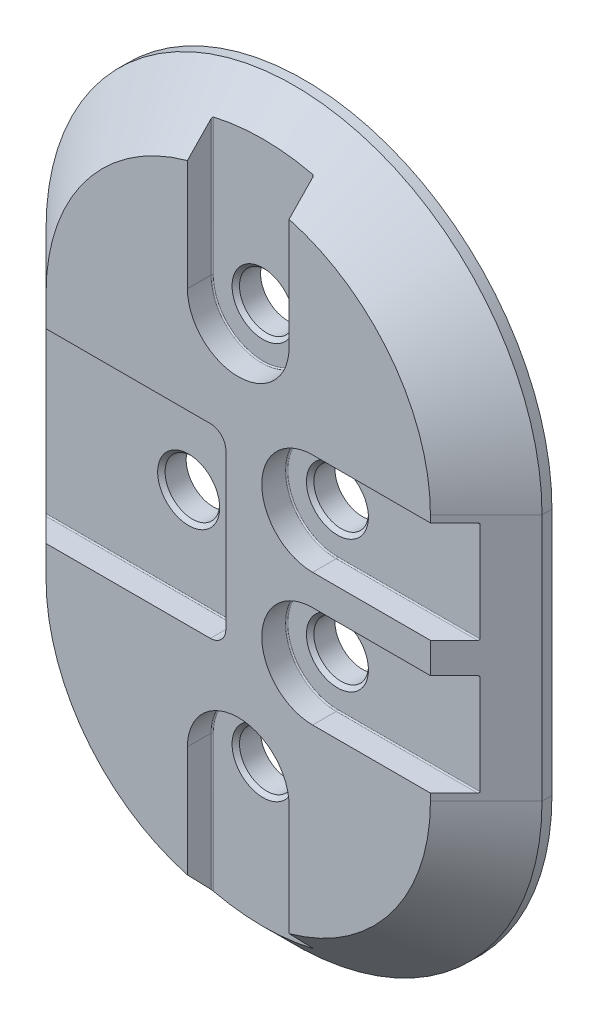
ISO-10303-21;
HEADER;
FILE_DESCRIPTION(('STEP AP214'),'2;1');
FILE_NAME('part.step','',(''),(''),'','','');
FILE_SCHEMA(('AUTOMOTIVE_DESIGN { 1 0 10303 214 1 1 1 1 }'));
ENDSEC;
DATA;
#1=APPLICATION_CONTEXT('core data for automotive mechanical design processes');
#2=APPLICATION_PROTOCOL_DEFINITION('international standard','automotive_design',2000,#1);
#3=PRODUCT_CONTEXT('',#1,'mechanical');
#4=PRODUCT('Part','Part','',(#3));
#5=PRODUCT_RELATED_PRODUCT_CATEGORY('part','',(#4));
#6=PRODUCT_DEFINITION_FORMATION('','',#4);
#7=PRODUCT_DEFINITION_CONTEXT('part definition',#1,'design');
#8=PRODUCT_DEFINITION('design','',#6,#7);
#9=PRODUCT_DEFINITION_SHAPE('','',#8);
#10=(LENGTH_UNIT() NAMED_UNIT(*) SI_UNIT(.MILLI.,.METRE.));
#11=(NAMED_UNIT(*) PLANE_ANGLE_UNIT() SI_UNIT($,.RADIAN.));
#12=(NAMED_UNIT(*) SI_UNIT($,.STERADIAN.) SOLID_ANGLE_UNIT());
#13=UNCERTAINTY_MEASURE_WITH_UNIT(LENGTH_MEASURE(1.E-05),#10,'distance_accuracy_value','');
#14=(GEOMETRIC_REPRESENTATION_CONTEXT(3) GLOBAL_UNCERTAINTY_ASSIGNED_CONTEXT((#13)) GLOBAL_UNIT_ASSIGNED_CONTEXT((#10,
#11,#12)) REPRESENTATION_CONTEXT('',''));
#15=CARTESIAN_POINT('',(0.,0.,0.));
#16=DIRECTION('',(0.,0.,1.));
#17=DIRECTION('',(1.,0.,0.));
#18=AXIS2_PLACEMENT_3D('',#15,#16,#17);
#19=CARTESIAN_POINT('',(-1.11022302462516E-13,-25.4,0.));
#20=DIRECTION('',(0.,0.,1.));
#21=DIRECTION('',(1.,0.,0.));
#22=AXIS2_PLACEMENT_3D('',#19,#20,#21);
#23=PLANE('',#22);
#24=DIRECTION('',(0.,1.,0.));
#25=VECTOR('',#24,1.);
#26=CARTESIAN_POINT('',(-39.5477999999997,-25.4,0.));
#27=LINE('',#26,#25);
#28=CARTESIAN_POINT('',(-39.5477999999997,-25.4,0.));
#29=VERTEX_POINT('',#28);
#30=CARTESIAN_POINT('',(-39.5477999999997,25.4,0.));
#31=VERTEX_POINT('',#30);
#32=EDGE_CURVE('E563',#29,#31,#27,.T.);
#33=ORIENTED_EDGE('',*,*,#32,.F.);
#34=CARTESIAN_POINT('',(-35.5853999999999,-25.4,0.));
#35=DIRECTION('',(0.,0.,-1.));
#36=DIRECTION('',(-1.,0.,0.));
#37=AXIS2_PLACEMENT_3D('',#34,#35,#36);
#38=CIRCLE('',#37,3.96239999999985);
#39=CARTESIAN_POINT('',(-31.623,-25.4000000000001,0.));
#40=VERTEX_POINT('',#39);
#41=EDGE_CURVE('E569',#40,#29,#38,.T.);
#42=ORIENTED_EDGE('',*,*,#41,.F.);
#43=DIRECTION('',(0.,-1.,0.));
#44=VECTOR('',#43,1.);
#45=CARTESIAN_POINT('',(-31.623,-25.4000000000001,0.));
#46=LINE('',#45,#44);
#47=CARTESIAN_POINT('',(-31.623,25.4,0.));
#48=VERTEX_POINT('',#47);
#49=EDGE_CURVE('E573',#48,#40,#46,.T.);
#50=ORIENTED_EDGE('',*,*,#49,.F.);
#51=CARTESIAN_POINT('',(-35.5853999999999,25.4,0.));
#52=DIRECTION('',(0.,0.,-1.));
#53=DIRECTION('',(-1.,0.,0.));
#54=AXIS2_PLACEMENT_3D('',#51,#52,#53);
#55=CIRCLE('',#54,3.96239999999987);
#56=EDGE_CURVE('E553',#31,#48,#55,.T.);
#57=ORIENTED_EDGE('',*,*,#56,.F.);
#58=EDGE_LOOP('',(#33,#42,#50,#57));
#59=FACE_BOUND('',#58,.T.);
#60=CARTESIAN_POINT('',(29.2133238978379,-45.72,0.));
#61=DIRECTION('',(0.,0.,-1.));
#62=DIRECTION('',(-1.,0.,0.));
#63=AXIS2_PLACEMENT_3D('',#60,#61,#62);
#64=CIRCLE('',#63,3.96240000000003);
#65=CARTESIAN_POINT('',(25.9604484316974,-43.4573875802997,0.));
#66=VERTEX_POINT('',#65);
#67=CARTESIAN_POINT('',(32.4661993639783,-47.9826124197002,0.));
#68=VERTEX_POINT('',#67);
#69=EDGE_CURVE('E585',#66,#68,#64,.T.);
#70=ORIENTED_EDGE('',*,*,#69,.F.);
#71=CARTESIAN_POINT('',(-1.11022302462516E-13,-25.4,0.));
#72=DIRECTION('',(0.,0.,1.));
#73=DIRECTION('',(-1.,0.,0.));
#74=AXIS2_PLACEMENT_3D('',#71,#72,#73);
#75=CIRCLE('',#74,31.6229999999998);
#76=CARTESIAN_POINT('',(-25.9604484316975,-43.4573875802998,0.));
#77=VERTEX_POINT('',#76);
#78=EDGE_CURVE('E580',#77,#66,#75,.T.);
#79=ORIENTED_EDGE('',*,*,#78,.F.);
#80=CARTESIAN_POINT('',(-29.2133238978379,-45.72,0.));
#81=DIRECTION('',(0.,0.,-1.));
#82=DIRECTION('',(-1.,0.,0.));
#83=AXIS2_PLACEMENT_3D('',#80,#81,#82);
#84=CIRCLE('',#83,3.96239999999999);
#85=CARTESIAN_POINT('',(-32.4661993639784,-47.9826124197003,0.));
#86=VERTEX_POINT('',#85);
#87=EDGE_CURVE('E591',#86,#77,#84,.T.);
#88=ORIENTED_EDGE('',*,*,#87,.F.);
#89=CARTESIAN_POINT('',(-1.11022302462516E-13,-25.4,0.));
#90=DIRECTION('',(0.,0.,-1.));
#91=DIRECTION('',(-1.,0.,0.));
#92=AXIS2_PLACEMENT_3D('',#89,#90,#91);
#93=CIRCLE('',#92,39.5477999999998);
#94=EDGE_CURVE('E588',#68,#86,#93,.T.);
#95=ORIENTED_EDGE('',*,*,#94,.F.);
#96=EDGE_LOOP('',(#70,#79,#88,#95));
#97=FACE_BOUND('',#96,.T.);
#98=CARTESIAN_POINT('',(-1.66533453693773E-13,25.4,0.));
#99=DIRECTION('',(0.,0.,1.));
#100=DIRECTION('',(-1.,0.,0.));
#101=AXIS2_PLACEMENT_3D('',#98,#99,#100);
#102=CIRCLE('',#101,31.6229999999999);
#103=CARTESIAN_POINT('',(25.9604484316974,43.4573875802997,0.));
#104=VERTEX_POINT('',#103);
#105=CARTESIAN_POINT('',(-25.9604484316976,43.4573875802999,0.));
#106=VERTEX_POINT('',#105);
#107=EDGE_CURVE('E605',#104,#106,#102,.T.);
#108=ORIENTED_EDGE('',*,*,#107,.F.);
#109=CARTESIAN_POINT('',(29.2133238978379,45.72,0.));
#110=DIRECTION('',(0.,0.,-1.));
#111=DIRECTION('',(-1.,0.,0.));
#112=AXIS2_PLACEMENT_3D('',#109,#110,#111);
#113=CIRCLE('',#112,3.96239999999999);
#114=CARTESIAN_POINT('',(32.4661993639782,47.9826124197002,0.));
#115=VERTEX_POINT('',#114);
#116=EDGE_CURVE('E597',#115,#104,#113,.T.);
#117=ORIENTED_EDGE('',*,*,#116,.F.);
#118=CARTESIAN_POINT('',(-1.66533453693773E-13,25.4,0.));
#119=DIRECTION('',(0.,0.,-1.));
#120=DIRECTION('',(-1.,0.,0.));
#121=AXIS2_PLACEMENT_3D('',#118,#119,#120);
#122=CIRCLE('',#121,39.5477999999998);
#123=CARTESIAN_POINT('',(-32.4661993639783,47.9826124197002,0.));
#124=VERTEX_POINT('',#123);
#125=EDGE_CURVE('E611',#124,#115,#122,.T.);
#126=ORIENTED_EDGE('',*,*,#125,.F.);
#127=CARTESIAN_POINT('',(-29.2133238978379,45.72,0.));
#128=DIRECTION('',(0.,0.,-1.));
#129=DIRECTION('',(1.,0.,0.));
#130=AXIS2_PLACEMENT_3D('',#127,#128,#129);
#131=CIRCLE('',#130,3.96239999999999);
#132=EDGE_CURVE('E608',#106,#124,#131,.T.);
#133=ORIENTED_EDGE('',*,*,#132,.F.);
#134=EDGE_LOOP('',(#108,#117,#126,#133));
#135=FACE_BOUND('',#134,.T.);
#136=DIRECTION('',(0.,1.,0.));
#137=VECTOR('',#136,1.);
#138=CARTESIAN_POINT('',(31.6229999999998,25.4,0.));
#139=LINE('',#138,#137);
#140=CARTESIAN_POINT('',(31.6229999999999,-25.4,0.));
#141=VERTEX_POINT('',#140);
#142=CARTESIAN_POINT('',(31.6229999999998,25.4,0.));
#143=VERTEX_POINT('',#142);
#144=EDGE_CURVE('E625',#141,#143,#139,.T.);
#145=ORIENTED_EDGE('',*,*,#144,.F.);
#146=CARTESIAN_POINT('',(35.5853999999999,-25.4,0.));
#147=DIRECTION('',(0.,0.,-1.));
#148=DIRECTION('',(1.,0.,0.));
#149=AXIS2_PLACEMENT_3D('',#146,#147,#148);
#150=CIRCLE('',#149,3.96239999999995);
#151=CARTESIAN_POINT('',(39.5477999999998,-25.4,0.));
#152=VERTEX_POINT('',#151);
#153=EDGE_CURVE('E617',#152,#141,#150,.T.);
#154=ORIENTED_EDGE('',*,*,#153,.F.);
#155=DIRECTION('',(0.,-1.,0.));
#156=VECTOR('',#155,1.);
#157=CARTESIAN_POINT('',(39.5477999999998,25.4,0.));
#158=LINE('',#157,#156);
#159=CARTESIAN_POINT('',(39.5477999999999,25.4,0.));
#160=VERTEX_POINT('',#159);
#161=EDGE_CURVE('E631',#160,#152,#158,.T.);
#162=ORIENTED_EDGE('',*,*,#161,.F.);
#163=CARTESIAN_POINT('',(35.5853999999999,25.4,0.));
#164=DIRECTION('',(0.,0.,-1.));
#165=DIRECTION('',(-1.,0.,0.));
#166=AXIS2_PLACEMENT_3D('',#163,#164,#165);
#167=CIRCLE('',#166,3.96240000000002);
#168=EDGE_CURVE('E628',#143,#160,#167,.T.);
#169=ORIENTED_EDGE('',*,*,#168,.F.);
#170=EDGE_LOOP('',(#145,#154,#162,#169));
#171=FACE_BOUND('',#170,.T.);
#172=DIRECTION('',(0.,1.,0.));
#173=VECTOR('',#172,1.);
#174=CARTESIAN_POINT('',(-28.4480000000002,-25.4000000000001,0.));
#175=LINE('',#174,#173);
#176=CARTESIAN_POINT('',(-28.4480000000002,-25.4000000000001,0.));
#177=VERTEX_POINT('',#176);
#178=CARTESIAN_POINT('',(-28.4480000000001,25.4,0.));
#179=VERTEX_POINT('',#178);
#180=EDGE_CURVE('E645',#177,#179,#175,.T.);
#181=ORIENTED_EDGE('',*,*,#180,.F.);
#182=CARTESIAN_POINT('',(-1.11022302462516E-13,-25.4,0.));
#183=DIRECTION('',(0.,0.,-1.));
#184=DIRECTION('',(-1.,0.,0.));
#185=AXIS2_PLACEMENT_3D('',#182,#183,#184);
#186=CIRCLE('',#185,28.4480000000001);
#187=CARTESIAN_POINT('',(28.4479999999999,-25.4,0.));
#188=VERTEX_POINT('',#187);
#189=EDGE_CURVE('E637',#188,#177,#186,.T.);
#190=ORIENTED_EDGE('',*,*,#189,.F.);
#191=DIRECTION('',(0.,-1.,0.));
#192=VECTOR('',#191,1.);
#193=CARTESIAN_POINT('',(28.4479999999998,25.4,0.));
#194=LINE('',#193,#192);
#195=CARTESIAN_POINT('',(28.4479999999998,25.4,0.));
#196=VERTEX_POINT('',#195);
#197=EDGE_CURVE('E651',#196,#188,#194,.T.);
#198=ORIENTED_EDGE('',*,*,#197,.F.);
#199=CARTESIAN_POINT('',(-1.66533453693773E-13,25.4,0.));
#200=DIRECTION('',(0.,0.,-1.));
#201=DIRECTION('',(-1.,0.,0.));
#202=AXIS2_PLACEMENT_3D('',#199,#200,#201);
#203=CIRCLE('',#202,28.448);
#204=EDGE_CURVE('E648',#179,#196,#203,.T.);
#205=ORIENTED_EDGE('',*,*,#204,.F.);
#206=EDGE_LOOP('',(#181,#190,#198,#205));
#207=FACE_BOUND('',#206,.T.);
#208=CARTESIAN_POINT('',(36.324886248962,-35.56,0.));
#209=DIRECTION('',(0.,0.,1.));
#210=DIRECTION('',(1.,0.,0.));
#211=AXIS2_PLACEMENT_3D('',#208,#209,#210);
#212=CIRCLE('',#211,4.19100000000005);
#213=CARTESIAN_POINT('',(40.5158862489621,-35.56,0.));
#214=VERTEX_POINT('',#213);
#215=EDGE_CURVE('E675',#214,#214,#212,.F.);
#216=ORIENTED_EDGE('',*,*,#215,.F.);
#217=EDGE_LOOP('',(#216));
#218=FACE_BOUND('',#217,.T.);
#219=CARTESIAN_POINT('',(36.3248862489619,35.56,0.));
#220=DIRECTION('',(0.,0.,1.));
#221=DIRECTION('',(1.,0.,0.));
#222=AXIS2_PLACEMENT_3D('',#219,#220,#221);
#223=CIRCLE('',#222,4.19100000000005);
#224=CARTESIAN_POINT('',(40.5158862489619,35.56,0.));
#225=VERTEX_POINT('',#224);
#226=EDGE_CURVE('E689',#225,#225,#223,.F.);
#227=ORIENTED_EDGE('',*,*,#226,.F.);
#228=EDGE_LOOP('',(#227));
#229=FACE_BOUND('',#228,.T.);
#230=CARTESIAN_POINT('',(-1.66533453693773E-13,25.4,0.));
#231=DIRECTION('',(0.,0.,-1.));
#232=DIRECTION('',(-1.,0.,0.));
#233=AXIS2_PLACEMENT_3D('',#230,#231,#232);
#234=CIRCLE('',#233,43.942);
#235=CARTESIAN_POINT('',(-43.9420000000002,25.4000000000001,0.));
#236=VERTEX_POINT('',#235);
#237=CARTESIAN_POINT('',(43.9419999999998,25.4,0.));
#238=VERTEX_POINT('',#237);
#239=EDGE_CURVE('E827',#236,#238,#234,.T.);
#240=ORIENTED_EDGE('',*,*,#239,.T.);
#241=DIRECTION('',(0.,-1.,0.));
#242=VECTOR('',#241,1.);
#243=CARTESIAN_POINT('',(43.942,-25.4,0.));
#244=LINE('',#243,#242);
#245=CARTESIAN_POINT('',(43.942,-25.3999999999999,0.));
#246=VERTEX_POINT('',#245);
#247=EDGE_CURVE('E830',#238,#246,#244,.T.);
#248=ORIENTED_EDGE('',*,*,#247,.T.);
#249=CARTESIAN_POINT('',(-1.11022302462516E-13,-25.4,0.));
#250=DIRECTION('',(0.,0.,-1.));
#251=DIRECTION('',(-1.,0.,0.));
#252=AXIS2_PLACEMENT_3D('',#249,#250,#251);
#253=CIRCLE('',#252,43.9420000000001);
#254=CARTESIAN_POINT('',(-43.9420000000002,-25.4,0.));
#255=VERTEX_POINT('',#254);
#256=EDGE_CURVE('E833',#246,#255,#253,.T.);
#257=ORIENTED_EDGE('',*,*,#256,.T.);
#258=DIRECTION('',(0.,1.,0.));
#259=VECTOR('',#258,1.);
#260=CARTESIAN_POINT('',(-43.9420000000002,25.4000000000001,0.));
#261=LINE('',#260,#259);
#262=EDGE_CURVE('E836',#255,#236,#261,.T.);
#263=ORIENTED_EDGE('',*,*,#262,.T.);
#264=EDGE_LOOP('',(#240,#248,#257,#263));
#265=FACE_BOUND('',#264,.T.);
#266=CARTESIAN_POINT('',(-36.3191137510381,35.56,0.));
#267=DIRECTION('',(0.,0.,1.));
#268=DIRECTION('',(1.,0.,0.));
#269=AXIS2_PLACEMENT_3D('',#266,#267,#268);
#270=CIRCLE('',#269,4.19100000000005);
#271=CARTESIAN_POINT('',(-32.1281137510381,35.56,0.));
#272=VERTEX_POINT('',#271);
#273=EDGE_CURVE('E682',#272,#272,#270,.F.);
#274=ORIENTED_EDGE('',*,*,#273,.F.);
#275=EDGE_LOOP('',(#274));
#276=FACE_BOUND('',#275,.T.);
#277=CARTESIAN_POINT('',(-36.319113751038,-35.56,0.));
#278=DIRECTION('',(0.,0.,1.));
#279=DIRECTION('',(1.,0.,0.));
#280=AXIS2_PLACEMENT_3D('',#277,#278,#279);
#281=CIRCLE('',#280,4.19100000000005);
#282=CARTESIAN_POINT('',(-32.1281137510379,-35.56,0.));
#283=VERTEX_POINT('',#282);
#284=EDGE_CURVE('E668',#283,#283,#281,.F.);
#285=ORIENTED_EDGE('',*,*,#284,.F.);
#286=EDGE_LOOP('',(#285));
#287=FACE_BOUND('',#286,.T.);
#288=ADVANCED_FACE('F34',(#59,#97,#135,#171,#207,#218,#229,#265,#276,#287),#23,.F.);
#289=CARTESIAN_POINT('',(0.,-40.64,33.));
#290=DIRECTION('',(0.,0.,1.));
#291=DIRECTION('',(1.,0.,0.));
#292=AXIS2_PLACEMENT_3D('',#289,#290,#291);
#293=CYLINDRICAL_SURFACE('',#292,10.414);
#294=DIRECTION('',(0.,0.,1.));
#295=VECTOR('',#294,1.);
#296=CARTESIAN_POINT('',(-10.414,-40.64,-80.7010543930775));
#297=LINE('',#296,#295);
#298=CARTESIAN_POINT('',(-10.414,-40.64,8.636));
#299=VERTEX_POINT('',#298);
#300=CARTESIAN_POINT('',(-10.414,-40.64,13.462));
#301=VERTEX_POINT('',#300);
#302=EDGE_CURVE('E730',#299,#301,#297,.T.);
#303=ORIENTED_EDGE('',*,*,#302,.F.);
#304=CARTESIAN_POINT('',(0.,-40.64,8.636));
#305=DIRECTION('',(0.,0.,1.));
#306=DIRECTION('',(1.,0.,0.));
#307=AXIS2_PLACEMENT_3D('',#304,#305,#306);
#308=CIRCLE('',#307,10.414);
#309=CARTESIAN_POINT('',(10.414,-40.64,8.636));
#310=VERTEX_POINT('',#309);
#311=EDGE_CURVE('E1218',#299,#310,#308,.F.);
#312=ORIENTED_EDGE('',*,*,#311,.T.);
#313=DIRECTION('',(0.,0.,1.));
#314=VECTOR('',#313,1.);
#315=CARTESIAN_POINT('',(10.414,-40.64,-80.7010543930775));
#316=LINE('',#315,#314);
#317=CARTESIAN_POINT('',(10.414,-40.64,13.462));
#318=VERTEX_POINT('',#317);
#319=EDGE_CURVE('E731',#310,#318,#316,.T.);
#320=ORIENTED_EDGE('',*,*,#319,.T.);
#321=CARTESIAN_POINT('',(0.,-40.64,13.462));
#322=DIRECTION('',(0.,0.,1.));
#323=DIRECTION('',(1.,0.,0.));
#324=AXIS2_PLACEMENT_3D('',#321,#322,#323);
#325=CIRCLE('',#324,10.414);
#326=EDGE_CURVE('E876',#301,#318,#325,.F.);
#327=ORIENTED_EDGE('',*,*,#326,.F.);
#328=EDGE_LOOP('',(#303,#312,#320,#327));
#329=FACE_BOUND('',#328,.T.);
#330=ADVANCED_FACE('F1492',(#329),#293,.F.);
#331=CARTESIAN_POINT('',(15.24,-13.5382,33.));
#332=DIRECTION('',(0.,0.,1.));
#333=DIRECTION('',(1.,0.,0.));
#334=AXIS2_PLACEMENT_3D('',#331,#332,#333);
#335=CYLINDRICAL_SURFACE('',#334,10.414);
#336=DIRECTION('',(0.,0.,1.));
#337=VECTOR('',#336,1.);
#338=CARTESIAN_POINT('',(15.24,-23.9522,-80.7010543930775));
#339=LINE('',#338,#337);
#340=CARTESIAN_POINT('',(15.24,-23.9522,8.636));
#341=VERTEX_POINT('',#340);
#342=CARTESIAN_POINT('',(15.24,-23.9522,13.462));
#343=VERTEX_POINT('',#342);
#344=EDGE_CURVE('E764',#341,#343,#339,.T.);
#345=ORIENTED_EDGE('',*,*,#344,.F.);
#346=CARTESIAN_POINT('',(15.24,-13.5382,8.636));
#347=DIRECTION('',(0.,0.,1.));
#348=DIRECTION('',(1.,0.,0.));
#349=AXIS2_PLACEMENT_3D('',#346,#347,#348);
#350=CIRCLE('',#349,10.414);
#351=CARTESIAN_POINT('',(15.24,-3.12419999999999,8.636));
#352=VERTEX_POINT('',#351);
#353=EDGE_CURVE('E1214',#341,#352,#350,.F.);
#354=ORIENTED_EDGE('',*,*,#353,.T.);
#355=DIRECTION('',(0.,0.,1.));
#356=VECTOR('',#355,1.);
#357=CARTESIAN_POINT('',(15.24,-3.12419999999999,-80.7010543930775));
#358=LINE('',#357,#356);
#359=CARTESIAN_POINT('',(15.24,-3.12419999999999,13.462));
#360=VERTEX_POINT('',#359);
#361=EDGE_CURVE('E765',#352,#360,#358,.T.);
#362=ORIENTED_EDGE('',*,*,#361,.T.);
#363=CARTESIAN_POINT('',(15.24,-13.5382,13.462));
#364=DIRECTION('',(0.,0.,1.));
#365=DIRECTION('',(1.,0.,0.));
#366=AXIS2_PLACEMENT_3D('',#363,#364,#365);
#367=CIRCLE('',#366,10.414);
#368=EDGE_CURVE('E886',#343,#360,#367,.F.);
#369=ORIENTED_EDGE('',*,*,#368,.F.);
#370=EDGE_LOOP('',(#345,#354,#362,#369));
#371=FACE_BOUND('',#370,.T.);
#372=ADVANCED_FACE('F1498',(#371),#335,.F.);
#373=CARTESIAN_POINT('',(15.24,13.5509,33.));
#374=DIRECTION('',(0.,0.,1.));
#375=DIRECTION('',(1.,0.,0.));
#376=AXIS2_PLACEMENT_3D('',#373,#374,#375);
#377=CYLINDRICAL_SURFACE('',#376,10.414);
#378=DIRECTION('',(0.,0.,1.));
#379=VECTOR('',#378,1.);
#380=CARTESIAN_POINT('',(15.24,3.1369,-80.7010543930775));
#381=LINE('',#380,#379);
#382=CARTESIAN_POINT('',(15.24,3.1369,8.636));
#383=VERTEX_POINT('',#382);
#384=CARTESIAN_POINT('',(15.24,3.1369,13.462));
#385=VERTEX_POINT('',#384);
#386=EDGE_CURVE('E774',#383,#385,#381,.T.);
#387=ORIENTED_EDGE('',*,*,#386,.F.);
#388=CARTESIAN_POINT('',(15.24,13.5509,8.636));
#389=DIRECTION('',(0.,0.,1.));
#390=DIRECTION('',(1.,0.,0.));
#391=AXIS2_PLACEMENT_3D('',#388,#389,#390);
#392=CIRCLE('',#391,10.414);
#393=CARTESIAN_POINT('',(15.24,23.9649,8.636));
#394=VERTEX_POINT('',#393);
#395=EDGE_CURVE('E1212',#383,#394,#392,.F.);
#396=ORIENTED_EDGE('',*,*,#395,.T.);
#397=DIRECTION('',(0.,0.,1.));
#398=VECTOR('',#397,1.);
#399=CARTESIAN_POINT('',(15.24,23.9649,-80.7010543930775));
#400=LINE('',#399,#398);
#401=CARTESIAN_POINT('',(15.24,23.9649,13.462));
#402=VERTEX_POINT('',#401);
#403=EDGE_CURVE('E775',#394,#402,#400,.T.);
#404=ORIENTED_EDGE('',*,*,#403,.T.);
#405=CARTESIAN_POINT('',(15.24,13.5509,13.462));
#406=DIRECTION('',(0.,0.,1.));
#407=DIRECTION('',(1.,0.,0.));
#408=AXIS2_PLACEMENT_3D('',#405,#406,#407);
#409=CIRCLE('',#408,10.414);
#410=EDGE_CURVE('E896',#385,#402,#409,.F.);
#411=ORIENTED_EDGE('',*,*,#410,.F.);
#412=EDGE_LOOP('',(#387,#396,#404,#411));
#413=FACE_BOUND('',#412,.T.);
#414=ADVANCED_FACE('F1512',(#413),#377,.F.);
#415=CARTESIAN_POINT('',(-1.11022302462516E-13,-25.4,13.462));
#416=DIRECTION('',(0.,0.,1.));
#417=DIRECTION('',(1.,0.,0.));
#418=AXIS2_PLACEMENT_3D('',#415,#416,#417);
#419=PLANE('',#418);
#420=DIRECTION('',(0.,1.,0.));
#421=VECTOR('',#420,1.);
#422=CARTESIAN_POINT('',(10.414,-40.64,13.462));
#423=LINE('',#422,#421);
#424=CARTESIAN_POINT('',(10.414,-63.3676902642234,13.462));
#425=VERTEX_POINT('',#424);
#426=EDGE_CURVE('E727',#425,#318,#423,.T.);
#427=ORIENTED_EDGE('',*,*,#426,.F.);
#428=CARTESIAN_POINT('',(-1.11022302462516E-13,-25.4,13.462));
#429=DIRECTION('',(0.,0.,1.));
#430=DIRECTION('',(1.,0.,0.));
#431=AXIS2_PLACEMENT_3D('',#428,#429,#430);
#432=CIRCLE('',#431,39.3700000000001);
#433=CARTESIAN_POINT('',(39.37,-25.3999999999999,13.462));
#434=VERTEX_POINT('',#433);
#435=EDGE_CURVE('E944',#425,#434,#432,.T.);
#436=ORIENTED_EDGE('',*,*,#435,.T.);
#437=DIRECTION('',(0.,1.,0.));
#438=VECTOR('',#437,1.);
#439=CARTESIAN_POINT('',(39.3699999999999,25.4,13.462));
#440=LINE('',#439,#438);
#441=CARTESIAN_POINT('',(39.37,-23.9522,13.462));
#442=VERTEX_POINT('',#441);
#443=EDGE_CURVE('E936',#434,#442,#440,.T.);
#444=ORIENTED_EDGE('',*,*,#443,.T.);
#445=DIRECTION('',(1.,0.,0.));
#446=VECTOR('',#445,1.);
#447=CARTESIAN_POINT('',(15.24,-23.9522,13.462));
#448=LINE('',#447,#446);
#449=EDGE_CURVE('E759',#343,#442,#448,.T.);
#450=ORIENTED_EDGE('',*,*,#449,.F.);
#451=ORIENTED_EDGE('',*,*,#368,.T.);
#452=DIRECTION('',(-1.,0.,0.));
#453=VECTOR('',#452,1.);
#454=CARTESIAN_POINT('',(15.24,-3.12419999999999,13.462));
#455=LINE('',#454,#453);
#456=CARTESIAN_POINT('',(39.37,-3.12419999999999,13.462));
#457=VERTEX_POINT('',#456);
#458=EDGE_CURVE('E761',#457,#360,#455,.T.);
#459=ORIENTED_EDGE('',*,*,#458,.F.);
#460=CARTESIAN_POINT('',(39.3699999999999,3.1369,13.462));
#461=VERTEX_POINT('',#460);
#462=EDGE_CURVE('E940',#457,#461,#440,.T.);
#463=ORIENTED_EDGE('',*,*,#462,.T.);
#464=DIRECTION('',(1.,0.,0.));
#465=VECTOR('',#464,1.);
#466=CARTESIAN_POINT('',(15.24,3.1369,13.462));
#467=LINE('',#466,#465);
#468=EDGE_CURVE('E767',#385,#461,#467,.T.);
#469=ORIENTED_EDGE('',*,*,#468,.F.);
#470=ORIENTED_EDGE('',*,*,#410,.T.);
#471=DIRECTION('',(-1.,0.,0.));
#472=VECTOR('',#471,1.);
#473=CARTESIAN_POINT('',(15.24,23.9649,13.462));
#474=LINE('',#473,#472);
#475=CARTESIAN_POINT('',(39.3699999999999,23.9649,13.462));
#476=VERTEX_POINT('',#475);
#477=EDGE_CURVE('E771',#476,#402,#474,.T.);
#478=ORIENTED_EDGE('',*,*,#477,.F.);
#479=CARTESIAN_POINT('',(39.3699999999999,25.4,13.462));
#480=VERTEX_POINT('',#479);
#481=EDGE_CURVE('E927',#476,#480,#440,.T.);
#482=ORIENTED_EDGE('',*,*,#481,.T.);
#483=CARTESIAN_POINT('',(-1.66533453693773E-13,25.4,13.462));
#484=DIRECTION('',(0.,0.,1.));
#485=DIRECTION('',(1.,0.,0.));
#486=AXIS2_PLACEMENT_3D('',#483,#484,#485);
#487=CIRCLE('',#486,39.37);
#488=CARTESIAN_POINT('',(10.414,63.3676902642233,13.462));
#489=VERTEX_POINT('',#488);
#490=EDGE_CURVE('E941',#480,#489,#487,.T.);
#491=ORIENTED_EDGE('',*,*,#490,.T.);
#492=DIRECTION('',(0.,1.,0.));
#493=VECTOR('',#492,1.);
#494=CARTESIAN_POINT('',(10.414,40.64,13.462));
#495=LINE('',#494,#493);
#496=CARTESIAN_POINT('',(10.414,40.64,13.462));
#497=VERTEX_POINT('',#496);
#498=EDGE_CURVE('E781',#497,#489,#495,.T.);
#499=ORIENTED_EDGE('',*,*,#498,.F.);
#500=CARTESIAN_POINT('',(0.,40.64,13.462));
#501=DIRECTION('',(0.,0.,1.));
#502=DIRECTION('',(1.,0.,0.));
#503=AXIS2_PLACEMENT_3D('',#500,#501,#502);
#504=CIRCLE('',#503,10.414);
#505=CARTESIAN_POINT('',(-10.414,40.64,13.462));
#506=VERTEX_POINT('',#505);
#507=EDGE_CURVE('E906',#497,#506,#504,.F.);
#508=ORIENTED_EDGE('',*,*,#507,.T.);
#509=DIRECTION('',(0.,-1.,0.));
#510=VECTOR('',#509,1.);
#511=CARTESIAN_POINT('',(-10.414,40.64,13.462));
#512=LINE('',#511,#510);
#513=CARTESIAN_POINT('',(-10.414,63.3676902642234,13.462));
#514=VERTEX_POINT('',#513);
#515=EDGE_CURVE('E777',#514,#506,#512,.T.);
#516=ORIENTED_EDGE('',*,*,#515,.F.);
#517=CARTESIAN_POINT('',(-39.3700000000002,25.4,13.462));
#518=VERTEX_POINT('',#517);
#519=EDGE_CURVE('E939',#514,#518,#487,.T.);
#520=ORIENTED_EDGE('',*,*,#519,.T.);
#521=DIRECTION('',(0.,-1.,0.));
#522=VECTOR('',#521,1.);
#523=CARTESIAN_POINT('',(-39.3700000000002,-25.4000000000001,13.462));
#524=LINE('',#523,#522);
#525=CARTESIAN_POINT('',(-39.3700000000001,19.05,13.462));
#526=VERTEX_POINT('',#525);
#527=EDGE_CURVE('E949',#518,#526,#524,.T.);
#528=ORIENTED_EDGE('',*,*,#527,.T.);
#529=DIRECTION('',(-1.,0.,0.));
#530=VECTOR('',#529,1.);
#531=CARTESIAN_POINT('',(-54.0000000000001,19.05,13.462));
#532=LINE('',#531,#530);
#533=CARTESIAN_POINT('',(-5.715,19.05,13.462));
#534=VERTEX_POINT('',#533);
#535=EDGE_CURVE('E746',#534,#526,#532,.T.);
#536=ORIENTED_EDGE('',*,*,#535,.F.);
#537=CARTESIAN_POINT('',(-5.715,15.875,13.462));
#538=DIRECTION('',(0.,0.,1.));
#539=DIRECTION('',(1.,0.,0.));
#540=AXIS2_PLACEMENT_3D('',#537,#538,#539);
#541=CIRCLE('',#540,3.175);
#542=CARTESIAN_POINT('',(-2.54,15.875,13.462));
#543=VERTEX_POINT('',#542);
#544=EDGE_CURVE('E743',#543,#534,#541,.T.);
#545=ORIENTED_EDGE('',*,*,#544,.F.);
#546=DIRECTION('',(0.,1.,0.));
#547=VECTOR('',#546,1.);
#548=CARTESIAN_POINT('',(-2.54,15.875,13.462));
#549=LINE('',#548,#547);
#550=CARTESIAN_POINT('',(-2.54,-15.875,13.462));
#551=VERTEX_POINT('',#550);
#552=EDGE_CURVE('E740',#551,#543,#549,.T.);
#553=ORIENTED_EDGE('',*,*,#552,.F.);
#554=CARTESIAN_POINT('',(-5.715,-15.875,13.462));
#555=DIRECTION('',(0.,0.,1.));
#556=DIRECTION('',(-1.,0.,0.));
#557=AXIS2_PLACEMENT_3D('',#554,#555,#556);
#558=CIRCLE('',#557,3.175);
#559=CARTESIAN_POINT('',(-5.715,-19.05,13.462));
#560=VERTEX_POINT('',#559);
#561=EDGE_CURVE('E737',#560,#551,#558,.T.);
#562=ORIENTED_EDGE('',*,*,#561,.F.);
#563=DIRECTION('',(1.,0.,0.));
#564=VECTOR('',#563,1.);
#565=CARTESIAN_POINT('',(-5.715,-19.05,13.462));
#566=LINE('',#565,#564);
#567=CARTESIAN_POINT('',(-39.3700000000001,-19.05,13.462));
#568=VERTEX_POINT('',#567);
#569=EDGE_CURVE('E733',#568,#560,#566,.T.);
#570=ORIENTED_EDGE('',*,*,#569,.F.);
#571=CARTESIAN_POINT('',(-39.3700000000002,-25.4000000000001,13.462));
#572=VERTEX_POINT('',#571);
#573=EDGE_CURVE('E948',#568,#572,#524,.T.);
#574=ORIENTED_EDGE('',*,*,#573,.T.);
#575=CARTESIAN_POINT('',(-10.414,-63.3676902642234,13.462));
#576=VERTEX_POINT('',#575);
#577=EDGE_CURVE('E945',#572,#576,#432,.T.);
#578=ORIENTED_EDGE('',*,*,#577,.T.);
#579=DIRECTION('',(0.,-1.,0.));
#580=VECTOR('',#579,1.);
#581=CARTESIAN_POINT('',(-10.414,-40.64,13.462));
#582=LINE('',#581,#580);
#583=EDGE_CURVE('E725',#301,#576,#582,.T.);
#584=ORIENTED_EDGE('',*,*,#583,.F.);
#585=ORIENTED_EDGE('',*,*,#326,.T.);
#586=EDGE_LOOP('',(#427,#436,#444,#450,#451,#459,#463,#469,#470,#478,#482,#491,#499,#508,#516,
#520,#528,#536,#545,#553,#562,#570,#574,#578,#584,#585));
#587=FACE_BOUND('',#586,.T.);
#588=ADVANCED_FACE('F1504',(#587),#419,.T.);
#589=DIRECTION('',(0.,-1.,0.));
#590=VECTOR('',#589,1.);
#591=CARTESIAN_POINT('',(48.4377999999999,-25.3999999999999,0.));
#592=LINE('',#591,#590);
#593=CARTESIAN_POINT('',(48.4377999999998,25.4000000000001,0.));
#594=VERTEX_POINT('',#593);
#595=CARTESIAN_POINT('',(48.4377999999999,-25.3999999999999,0.));
#596=VERTEX_POINT('',#595);
#597=EDGE_CURVE('E850',#594,#596,#592,.T.);
#598=ORIENTED_EDGE('',*,*,#597,.F.);
#599=CARTESIAN_POINT('',(-1.66533453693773E-13,25.4,0.));
#600=DIRECTION('',(0.,0.,-1.));
#601=DIRECTION('',(-1.,0.,0.));
#602=AXIS2_PLACEMENT_3D('',#599,#600,#601);
#603=CIRCLE('',#602,48.4378);
#604=CARTESIAN_POINT('',(-48.4378000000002,25.4000000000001,0.));
#605=VERTEX_POINT('',#604);
#606=EDGE_CURVE('E842',#605,#594,#603,.T.);
#607=ORIENTED_EDGE('',*,*,#606,.F.);
#608=DIRECTION('',(0.,1.,0.));
#609=VECTOR('',#608,1.);
#610=CARTESIAN_POINT('',(-48.4378000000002,25.4000000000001,0.));
#611=LINE('',#610,#609);
#612=CARTESIAN_POINT('',(-48.4378000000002,-25.3999999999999,0.));
#613=VERTEX_POINT('',#612);
#614=EDGE_CURVE('E856',#613,#605,#611,.T.);
#615=ORIENTED_EDGE('',*,*,#614,.F.);
#616=CARTESIAN_POINT('',(-1.11022302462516E-13,-25.4,0.));
#617=DIRECTION('',(0.,0.,-1.));
#618=DIRECTION('',(-1.,0.,0.));
#619=AXIS2_PLACEMENT_3D('',#616,#617,#618);
#620=CIRCLE('',#619,48.4378000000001);
#621=EDGE_CURVE('E853',#596,#613,#620,.T.);
#622=ORIENTED_EDGE('',*,*,#621,.F.);
#623=EDGE_LOOP('',(#598,#607,#615,#622));
#624=FACE_BOUND('',#623,.T.);
#625=CARTESIAN_POINT('',(-1.11022302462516E-13,-25.4,0.));
#626=DIRECTION('',(0.,0.,1.));
#627=DIRECTION('',(1.,0.,0.));
#628=AXIS2_PLACEMENT_3D('',#625,#626,#627);
#629=CIRCLE('',#628,50.8000000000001);
#630=CARTESIAN_POINT('',(-50.8000000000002,-25.4000000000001,0.));
#631=VERTEX_POINT('',#630);
#632=CARTESIAN_POINT('',(50.8,-25.3999999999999,0.));
#633=VERTEX_POINT('',#632);
#634=EDGE_CURVE('E907',#631,#633,#629,.T.);
#635=ORIENTED_EDGE('',*,*,#634,.F.);
#636=DIRECTION('',(0.,-1.,0.));
#637=VECTOR('',#636,1.);
#638=CARTESIAN_POINT('',(-50.8000000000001,25.4000000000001,0.));
#639=LINE('',#638,#637);
#640=CARTESIAN_POINT('',(-50.8000000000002,25.4000000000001,0.));
#641=VERTEX_POINT('',#640);
#642=EDGE_CURVE('E916',#641,#631,#639,.T.);
#643=ORIENTED_EDGE('',*,*,#642,.F.);
#644=CARTESIAN_POINT('',(-1.66533453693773E-13,25.4,0.));
#645=DIRECTION('',(0.,0.,1.));
#646=DIRECTION('',(1.,0.,0.));
#647=AXIS2_PLACEMENT_3D('',#644,#645,#646);
#648=CIRCLE('',#647,50.8);
#649=CARTESIAN_POINT('',(50.7999999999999,25.4,0.));
#650=VERTEX_POINT('',#649);
#651=EDGE_CURVE('E913',#650,#641,#648,.T.);
#652=ORIENTED_EDGE('',*,*,#651,.F.);
#653=DIRECTION('',(0.,1.,0.));
#654=VECTOR('',#653,1.);
#655=CARTESIAN_POINT('',(50.8,-25.3999999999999,0.));
#656=LINE('',#655,#654);
#657=EDGE_CURVE('E910',#633,#650,#656,.T.);
#658=ORIENTED_EDGE('',*,*,#657,.F.);
#659=EDGE_LOOP('',(#635,#643,#652,#658));
#660=FACE_BOUND('',#659,.T.);
#661=ADVANCED_FACE('F1494',(#624,#660),#23,.F.);
#662=CARTESIAN_POINT('',(-1.11022302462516E-13,-25.4,13.462));
#663=DIRECTION('',(0.,0.,-1.));
#664=DIRECTION('',(-1.,0.,0.));
#665=AXIS2_PLACEMENT_3D('',#662,#663,#664);
#666=CYLINDRICAL_SURFACE('',#665,50.8000000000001);
#667=DIRECTION('',(0.,0.,-1.));
#668=VECTOR('',#667,1.);
#669=CARTESIAN_POINT('',(50.8,-25.3999999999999,13.462));
#670=LINE('',#669,#668);
#671=CARTESIAN_POINT('',(50.8,-25.3999999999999,2.03199999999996));
#672=VERTEX_POINT('',#671);
#673=EDGE_CURVE('E925',#672,#633,#670,.T.);
#674=ORIENTED_EDGE('',*,*,#673,.F.);
#675=CARTESIAN_POINT('',(-1.11022302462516E-13,-25.4,2.03199999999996));
#676=DIRECTION('',(0.,0.,1.));
#677=DIRECTION('',(1.,0.,0.));
#678=AXIS2_PLACEMENT_3D('',#675,#676,#677);
#679=CIRCLE('',#678,50.8000000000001);
#680=CARTESIAN_POINT('',(-50.8000000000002,-25.4000000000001,2.03199999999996));
#681=VERTEX_POINT('',#680);
#682=EDGE_CURVE('E955',#672,#681,#679,.F.);
#683=ORIENTED_EDGE('',*,*,#682,.T.);
#684=DIRECTION('',(0.,0.,-1.));
#685=VECTOR('',#684,1.);
#686=CARTESIAN_POINT('',(-50.8000000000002,-25.4000000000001,13.462));
#687=LINE('',#686,#685);
#688=EDGE_CURVE('E919',#681,#631,#687,.T.);
#689=ORIENTED_EDGE('',*,*,#688,.T.);
#690=ORIENTED_EDGE('',*,*,#634,.T.);
#691=EDGE_LOOP('',(#674,#683,#689,#690));
#692=FACE_BOUND('',#691,.T.);
#693=ADVANCED_FACE('F36',(#692),#666,.T.);
#694=CARTESIAN_POINT('',(50.8,-25.3999999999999,13.462));
#695=DIRECTION('',(-1.,0.,0.));
#696=DIRECTION('',(0.,-1.,0.));
#697=AXIS2_PLACEMENT_3D('',#694,#695,#696);
#698=PLANE('',#697);
#699=DIRECTION('',(0.,0.,-1.));
#700=VECTOR('',#699,1.);
#701=CARTESIAN_POINT('',(50.7999999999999,25.4,13.462));
#702=LINE('',#701,#700);
#703=CARTESIAN_POINT('',(50.7999999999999,25.4,2.03199999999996));
#704=VERTEX_POINT('',#703);
#705=EDGE_CURVE('E923',#704,#650,#702,.T.);
#706=ORIENTED_EDGE('',*,*,#705,.F.);
#707=DIRECTION('',(0.,-1.,0.));
#708=VECTOR('',#707,1.);
#709=CARTESIAN_POINT('',(50.8,-25.3999999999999,2.03199999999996));
#710=LINE('',#709,#708);
#711=EDGE_CURVE('E959',#704,#672,#710,.T.);
#712=ORIENTED_EDGE('',*,*,#711,.T.);
#713=ORIENTED_EDGE('',*,*,#673,.T.);
#714=ORIENTED_EDGE('',*,*,#657,.T.);
#715=EDGE_LOOP('',(#706,#712,#713,#714));
#716=FACE_BOUND('',#715,.T.);
#717=ADVANCED_FACE('F1510',(#716),#698,.F.);
#718=CARTESIAN_POINT('',(-1.66533453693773E-13,25.4,13.462));
#719=DIRECTION('',(0.,0.,-1.));
#720=DIRECTION('',(-1.,0.,0.));
#721=AXIS2_PLACEMENT_3D('',#718,#719,#720);
#722=CYLINDRICAL_SURFACE('',#721,50.8);
#723=DIRECTION('',(0.,0.,-1.));
#724=VECTOR('',#723,1.);
#725=CARTESIAN_POINT('',(-50.8000000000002,25.4000000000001,13.462));
#726=LINE('',#725,#724);
#727=CARTESIAN_POINT('',(-50.8000000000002,25.4000000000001,2.03199999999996));
#728=VERTEX_POINT('',#727);
#729=EDGE_CURVE('E921',#728,#641,#726,.T.);
#730=ORIENTED_EDGE('',*,*,#729,.F.);
#731=CARTESIAN_POINT('',(-1.66533453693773E-13,25.4,2.03199999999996));
#732=DIRECTION('',(0.,0.,1.));
#733=DIRECTION('',(1.,0.,0.));
#734=AXIS2_PLACEMENT_3D('',#731,#732,#733);
#735=CIRCLE('',#734,50.8);
#736=EDGE_CURVE('E957',#728,#704,#735,.F.);
#737=ORIENTED_EDGE('',*,*,#736,.T.);
#738=ORIENTED_EDGE('',*,*,#705,.T.);
#739=ORIENTED_EDGE('',*,*,#651,.T.);
#740=EDGE_LOOP('',(#730,#737,#738,#739));
#741=FACE_BOUND('',#740,.T.);
#742=ADVANCED_FACE('F1531',(#741),#722,.T.);
#743=CARTESIAN_POINT('',(-50.8000000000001,25.4000000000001,13.462));
#744=DIRECTION('',(1.,0.,0.));
#745=DIRECTION('',(0.,1.,0.));
#746=AXIS2_PLACEMENT_3D('',#743,#744,#745);
#747=PLANE('',#746);
#748=ORIENTED_EDGE('',*,*,#688,.F.);
#749=DIRECTION('',(0.,1.,0.));
#750=VECTOR('',#749,1.);
#751=CARTESIAN_POINT('',(-50.8000000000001,25.4000000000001,2.03199999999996));
#752=LINE('',#751,#750);
#753=EDGE_CURVE('E952',#681,#728,#752,.T.);
#754=ORIENTED_EDGE('',*,*,#753,.T.);
#755=ORIENTED_EDGE('',*,*,#729,.T.);
#756=ORIENTED_EDGE('',*,*,#642,.T.);
#757=EDGE_LOOP('',(#748,#754,#755,#756));
#758=FACE_BOUND('',#757,.T.);
#759=ADVANCED_FACE('F1528',(#758),#747,.F.);
#760=CARTESIAN_POINT('',(0.,40.64,33.));
#761=DIRECTION('',(0.,0.,1.));
#762=DIRECTION('',(1.,0.,0.));
#763=AXIS2_PLACEMENT_3D('',#760,#761,#762);
#764=CYLINDRICAL_SURFACE('',#763,5.588);
#765=CARTESIAN_POINT('',(0.,40.64,7.62));
#766=DIRECTION('',(0.,0.,1.));
#767=DIRECTION('',(1.,0.,0.));
#768=AXIS2_PLACEMENT_3D('',#765,#766,#767);
#769=CIRCLE('',#768,5.588);
#770=CARTESIAN_POINT('',(5.588,40.64,7.62));
#771=VERTEX_POINT('',#770);
#772=EDGE_CURVE('E903',#771,#771,#769,.T.);
#773=ORIENTED_EDGE('',*,*,#772,.T.);
#774=EDGE_LOOP('',(#773));
#775=FACE_BOUND('',#774,.T.);
#776=CARTESIAN_POINT('',(0.,40.64,3.302));
#777=DIRECTION('',(0.,0.,1.));
#778=DIRECTION('',(1.,0.,0.));
#779=AXIS2_PLACEMENT_3D('',#776,#777,#778);
#780=CIRCLE('',#779,5.588);
#781=CARTESIAN_POINT('',(5.588,40.64,3.302));
#782=VERTEX_POINT('',#781);
#783=EDGE_CURVE('E897',#782,#782,#780,.T.);
#784=ORIENTED_EDGE('',*,*,#783,.F.);
#785=EDGE_LOOP('',(#784));
#786=FACE_BOUND('',#785,.T.);
#787=ADVANCED_FACE('F2355',(#775,#786),#764,.F.);
#788=CARTESIAN_POINT('',(0.,40.64,7.62));
#789=DIRECTION('',(0.,0.,1.));
#790=DIRECTION('',(1.,0.,0.));
#791=AXIS2_PLACEMENT_3D('',#788,#789,#790);
#792=CONICAL_SURFACE('',#791,5.588,0.785398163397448);
#793=CARTESIAN_POINT('',(0.,40.64,8.382));
#794=DIRECTION('',(0.,0.,1.));
#795=DIRECTION('',(1.,0.,0.));
#796=AXIS2_PLACEMENT_3D('',#793,#794,#795);
#797=CIRCLE('',#796,6.35);
#798=CARTESIAN_POINT('',(6.35,40.64,8.382));
#799=VERTEX_POINT('',#798);
#800=EDGE_CURVE('E900',#799,#799,#797,.T.);
#801=ORIENTED_EDGE('',*,*,#800,.T.);
#802=EDGE_LOOP('',(#801));
#803=FACE_BOUND('',#802,.T.);
#804=ORIENTED_EDGE('',*,*,#772,.F.);
#805=EDGE_LOOP('',(#804));
#806=FACE_BOUND('',#805,.T.);
#807=ADVANCED_FACE('F2352',(#803,#806),#792,.F.);
#808=CARTESIAN_POINT('',(0.,46.99,8.382));
#809=DIRECTION('',(0.,0.,1.));
#810=DIRECTION('',(1.,0.,0.));
#811=AXIS2_PLACEMENT_3D('',#808,#809,#810);
#812=PLANE('',#811);
#813=CARTESIAN_POINT('',(-1.66533453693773E-13,25.4,8.382));
#814=DIRECTION('',(0.,0.,1.));
#815=DIRECTION('',(1.,0.,0.));
#816=AXIS2_PLACEMENT_3D('',#813,#814,#815);
#817=CIRCLE('',#816,44.45);
#818=CARTESIAN_POINT('',(-10.16,68.6732815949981,8.382));
#819=VERTEX_POINT('',#818);
#820=CARTESIAN_POINT('',(10.16,68.673281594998,8.382));
#821=VERTEX_POINT('',#820);
#822=EDGE_CURVE('E997',#819,#821,#817,.F.);
#823=ORIENTED_EDGE('',*,*,#822,.F.);
#824=DIRECTION('',(0.,1.,0.));
#825=VECTOR('',#824,1.);
#826=CARTESIAN_POINT('',(-10.16,46.99,8.382));
#827=LINE('',#826,#825);
#828=CARTESIAN_POINT('',(-10.16,40.64,8.382));
#829=VERTEX_POINT('',#828);
#830=EDGE_CURVE('E1262',#819,#829,#827,.F.);
#831=ORIENTED_EDGE('',*,*,#830,.T.);
#832=CARTESIAN_POINT('',(0.,40.64,8.382));
#833=DIRECTION('',(0.,0.,1.));
#834=DIRECTION('',(1.,0.,0.));
#835=AXIS2_PLACEMENT_3D('',#832,#833,#834);
#836=CIRCLE('',#835,10.16);
#837=CARTESIAN_POINT('',(10.16,40.64,8.382));
#838=VERTEX_POINT('',#837);
#839=EDGE_CURVE('E1260',#829,#838,#836,.T.);
#840=ORIENTED_EDGE('',*,*,#839,.T.);
#841=DIRECTION('',(0.,-1.,0.));
#842=VECTOR('',#841,1.);
#843=CARTESIAN_POINT('',(10.16,46.99,8.382));
#844=LINE('',#843,#842);
#845=EDGE_CURVE('E1258',#838,#821,#844,.F.);
#846=ORIENTED_EDGE('',*,*,#845,.T.);
#847=EDGE_LOOP('',(#823,#831,#840,#846));
#848=FACE_BOUND('',#847,.T.);
#849=ORIENTED_EDGE('',*,*,#800,.F.);
#850=EDGE_LOOP('',(#849));
#851=FACE_BOUND('',#850,.T.);
#852=ADVANCED_FACE('F2348',(#848,#851),#812,.T.);
#853=CARTESIAN_POINT('',(0.,40.64,33.));
#854=DIRECTION('',(0.,0.,1.));
#855=DIRECTION('',(1.,0.,0.));
#856=AXIS2_PLACEMENT_3D('',#853,#854,#855);
#857=CYLINDRICAL_SURFACE('',#856,10.414);
#858=DIRECTION('',(0.,0.,1.));
#859=VECTOR('',#858,1.);
#860=CARTESIAN_POINT('',(10.414,40.64,-80.7010543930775));
#861=LINE('',#860,#859);
#862=CARTESIAN_POINT('',(10.414,40.64,8.636));
#863=VERTEX_POINT('',#862);
#864=EDGE_CURVE('E784',#863,#497,#861,.T.);
#865=ORIENTED_EDGE('',*,*,#864,.F.);
#866=CARTESIAN_POINT('',(0.,40.64,8.636));
#867=DIRECTION('',(0.,0.,1.));
#868=DIRECTION('',(1.,0.,0.));
#869=AXIS2_PLACEMENT_3D('',#866,#867,#868);
#870=CIRCLE('',#869,10.414);
#871=CARTESIAN_POINT('',(-10.414,40.64,8.636));
#872=VERTEX_POINT('',#871);
#873=EDGE_CURVE('E1210',#863,#872,#870,.F.);
#874=ORIENTED_EDGE('',*,*,#873,.T.);
#875=DIRECTION('',(0.,0.,1.));
#876=VECTOR('',#875,1.);
#877=CARTESIAN_POINT('',(-10.414,40.64,-80.7010543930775));
#878=LINE('',#877,#876);
#879=EDGE_CURVE('E783',#872,#506,#878,.T.);
#880=ORIENTED_EDGE('',*,*,#879,.T.);
#881=ORIENTED_EDGE('',*,*,#507,.F.);
#882=EDGE_LOOP('',(#865,#874,#880,#881));
#883=FACE_BOUND('',#882,.T.);
#884=ADVANCED_FACE('F2344',(#883),#857,.F.);
#885=CARTESIAN_POINT('',(0.,46.228,3.302));
#886=DIRECTION('',(0.,0.,-1.));
#887=DIRECTION('',(-1.,0.,0.));
#888=AXIS2_PLACEMENT_3D('',#885,#886,#887);
#889=PLANE('',#888);
#890=DIRECTION('',(0.,1.,0.));
#891=VECTOR('',#890,1.);
#892=CARTESIAN_POINT('',(26.0603999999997,46.2280000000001,3.302));
#893=LINE('',#892,#891);
#894=CARTESIAN_POINT('',(26.0603999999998,25.4,3.302));
#895=VERTEX_POINT('',#894);
#896=CARTESIAN_POINT('',(26.0603999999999,-25.4,3.302));
#897=VERTEX_POINT('',#896);
#898=EDGE_CURVE('E1376',#895,#897,#893,.F.);
#899=ORIENTED_EDGE('',*,*,#898,.T.);
#900=CARTESIAN_POINT('',(-1.11022302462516E-13,-25.4,3.302));
#901=DIRECTION('',(0.,0.,-1.));
#902=DIRECTION('',(-1.,0.,0.));
#903=AXIS2_PLACEMENT_3D('',#900,#901,#902);
#904=CIRCLE('',#903,26.0604000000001);
#905=CARTESIAN_POINT('',(-26.0604000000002,-25.4000000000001,3.302));
#906=VERTEX_POINT('',#905);
#907=EDGE_CURVE('E1378',#897,#906,#904,.T.);
#908=ORIENTED_EDGE('',*,*,#907,.T.);
#909=DIRECTION('',(0.,-1.,0.));
#910=VECTOR('',#909,1.);
#911=CARTESIAN_POINT('',(-26.0604000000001,46.228,3.302));
#912=LINE('',#911,#910);
#913=CARTESIAN_POINT('',(-26.0604000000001,25.4,3.302));
#914=VERTEX_POINT('',#913);
#915=EDGE_CURVE('E1374',#906,#914,#912,.F.);
#916=ORIENTED_EDGE('',*,*,#915,.T.);
#917=CARTESIAN_POINT('',(-1.66533453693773E-13,25.4,3.302));
#918=DIRECTION('',(0.,0.,-1.));
#919=DIRECTION('',(-1.,0.,0.));
#920=AXIS2_PLACEMENT_3D('',#917,#918,#919);
#921=CIRCLE('',#920,26.0603999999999);
#922=EDGE_CURVE('E1372',#914,#895,#921,.T.);
#923=ORIENTED_EDGE('',*,*,#922,.T.);
#924=EDGE_LOOP('',(#899,#908,#916,#923));
#925=FACE_BOUND('',#924,.T.);
#926=ORIENTED_EDGE('',*,*,#783,.T.);
#927=EDGE_LOOP('',(#926));
#928=FACE_BOUND('',#927,.T.);
#929=CARTESIAN_POINT('',(15.24,13.5509,3.302));
#930=DIRECTION('',(0.,0.,1.));
#931=DIRECTION('',(1.,0.,0.));
#932=AXIS2_PLACEMENT_3D('',#929,#930,#931);
#933=CIRCLE('',#932,5.588);
#934=CARTESIAN_POINT('',(20.828,13.5509,3.302));
#935=VERTEX_POINT('',#934);
#936=EDGE_CURVE('E887',#935,#935,#933,.T.);
#937=ORIENTED_EDGE('',*,*,#936,.T.);
#938=EDGE_LOOP('',(#937));
#939=FACE_BOUND('',#938,.T.);
#940=CARTESIAN_POINT('',(15.24,-13.5382,3.302));
#941=DIRECTION('',(0.,0.,1.));
#942=DIRECTION('',(1.,0.,0.));
#943=AXIS2_PLACEMENT_3D('',#940,#941,#942);
#944=CIRCLE('',#943,5.588);
#945=CARTESIAN_POINT('',(20.828,-13.5382,3.302));
#946=VERTEX_POINT('',#945);
#947=EDGE_CURVE('E877',#946,#946,#944,.T.);
#948=ORIENTED_EDGE('',*,*,#947,.T.);
#949=EDGE_LOOP('',(#948));
#950=FACE_BOUND('',#949,.T.);
#951=CARTESIAN_POINT('',(0.,-40.64,3.302));
#952=DIRECTION('',(0.,0.,-1.));
#953=DIRECTION('',(1.,0.,0.));
#954=AXIS2_PLACEMENT_3D('',#951,#952,#953);
#955=CIRCLE('',#954,5.588);
#956=CARTESIAN_POINT('',(5.588,-40.64,3.302));
#957=VERTEX_POINT('',#956);
#958=EDGE_CURVE('E862',#957,#957,#955,.T.);
#959=ORIENTED_EDGE('',*,*,#958,.F.);
#960=EDGE_LOOP('',(#959));
#961=FACE_BOUND('',#960,.T.);
#962=CARTESIAN_POINT('',(-15.24,0.,3.302));
#963=DIRECTION('',(0.,0.,1.));
#964=DIRECTION('',(1.,0.,0.));
#965=AXIS2_PLACEMENT_3D('',#962,#963,#964);
#966=CIRCLE('',#965,5.588);
#967=CARTESIAN_POINT('',(-9.652,0.,3.302));
#968=VERTEX_POINT('',#967);
#969=EDGE_CURVE('E793',#968,#968,#966,.T.);
#970=ORIENTED_EDGE('',*,*,#969,.T.);
#971=EDGE_LOOP('',(#970));
#972=FACE_BOUND('',#971,.T.);
#973=ADVANCED_FACE('F2340',(#925,#928,#939,#950,#961,#972),#889,.T.);
#974=CARTESIAN_POINT('',(15.24,13.5509,33.));
#975=DIRECTION('',(0.,0.,1.));
#976=DIRECTION('',(1.,0.,0.));
#977=AXIS2_PLACEMENT_3D('',#974,#975,#976);
#978=CYLINDRICAL_SURFACE('',#977,5.588);
#979=CARTESIAN_POINT('',(15.24,13.5509,7.62));
#980=DIRECTION('',(0.,0.,1.));
#981=DIRECTION('',(1.,0.,0.));
#982=AXIS2_PLACEMENT_3D('',#979,#980,#981);
#983=CIRCLE('',#982,5.588);
#984=CARTESIAN_POINT('',(20.828,13.5509,7.62));
#985=VERTEX_POINT('',#984);
#986=EDGE_CURVE('E893',#985,#985,#983,.T.);
#987=ORIENTED_EDGE('',*,*,#986,.T.);
#988=EDGE_LOOP('',(#987));
#989=FACE_BOUND('',#988,.T.);
#990=ORIENTED_EDGE('',*,*,#936,.F.);
#991=EDGE_LOOP('',(#990));
#992=FACE_BOUND('',#991,.T.);
#993=ADVANCED_FACE('F2336',(#989,#992),#978,.F.);
#994=CARTESIAN_POINT('',(15.24,13.5509,7.62));
#995=DIRECTION('',(0.,0.,1.));
#996=DIRECTION('',(1.,0.,0.));
#997=AXIS2_PLACEMENT_3D('',#994,#995,#996);
#998=CONICAL_SURFACE('',#997,5.588,0.785398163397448);
#999=CARTESIAN_POINT('',(15.24,13.5509,8.382));
#1000=DIRECTION('',(0.,0.,1.));
#1001=DIRECTION('',(1.,0.,0.));
#1002=AXIS2_PLACEMENT_3D('',#999,#1000,#1001);
#1003=CIRCLE('',#1002,6.35);
#1004=CARTESIAN_POINT('',(21.59,13.5509,8.382));
#1005=VERTEX_POINT('',#1004);
#1006=EDGE_CURVE('E890',#1005,#1005,#1003,.T.);
#1007=ORIENTED_EDGE('',*,*,#1006,.T.);
#1008=EDGE_LOOP('',(#1007));
#1009=FACE_BOUND('',#1008,.T.);
#1010=ORIENTED_EDGE('',*,*,#986,.F.);
#1011=EDGE_LOOP('',(#1010));
#1012=FACE_BOUND('',#1011,.T.);
#1013=ADVANCED_FACE('F2332',(#1009,#1012),#998,.F.);
#1014=CARTESIAN_POINT('',(15.24,19.9009,8.382));
#1015=DIRECTION('',(0.,0.,1.));
#1016=DIRECTION('',(1.,0.,0.));
#1017=AXIS2_PLACEMENT_3D('',#1014,#1015,#1016);
#1018=PLANE('',#1017);
#1019=DIRECTION('',(0.,-1.,0.));
#1020=VECTOR('',#1019,1.);
#1021=CARTESIAN_POINT('',(44.45,-25.3999999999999,8.382));
#1022=LINE('',#1021,#1020);
#1023=CARTESIAN_POINT('',(44.4499999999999,23.7109,8.382));
#1024=VERTEX_POINT('',#1023);
#1025=CARTESIAN_POINT('',(44.4499999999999,3.3909,8.382));
#1026=VERTEX_POINT('',#1025);
#1027=EDGE_CURVE('E1558',#1024,#1026,#1022,.T.);
#1028=ORIENTED_EDGE('',*,*,#1027,.F.);
#1029=DIRECTION('',(1.,0.,0.));
#1030=VECTOR('',#1029,1.);
#1031=CARTESIAN_POINT('',(15.24,23.7109,8.382));
#1032=LINE('',#1031,#1030);
#1033=CARTESIAN_POINT('',(15.24,23.7109,8.382));
#1034=VERTEX_POINT('',#1033);
#1035=EDGE_CURVE('E1271',#1024,#1034,#1032,.F.);
#1036=ORIENTED_EDGE('',*,*,#1035,.T.);
#1037=CARTESIAN_POINT('',(15.24,13.5509,8.382));
#1038=DIRECTION('',(0.,0.,1.));
#1039=DIRECTION('',(1.,0.,0.));
#1040=AXIS2_PLACEMENT_3D('',#1037,#1038,#1039);
#1041=CIRCLE('',#1040,10.16);
#1042=CARTESIAN_POINT('',(15.24,3.3909,8.382));
#1043=VERTEX_POINT('',#1042);
#1044=EDGE_CURVE('E1269',#1034,#1043,#1041,.T.);
#1045=ORIENTED_EDGE('',*,*,#1044,.T.);
#1046=DIRECTION('',(-1.,0.,0.));
#1047=VECTOR('',#1046,1.);
#1048=CARTESIAN_POINT('',(15.24,3.3909,8.382));
#1049=LINE('',#1048,#1047);
#1050=EDGE_CURVE('E1267',#1043,#1026,#1049,.F.);
#1051=ORIENTED_EDGE('',*,*,#1050,.T.);
#1052=EDGE_LOOP('',(#1028,#1036,#1045,#1051));
#1053=FACE_BOUND('',#1052,.T.);
#1054=ORIENTED_EDGE('',*,*,#1006,.F.);
#1055=EDGE_LOOP('',(#1054));
#1056=FACE_BOUND('',#1055,.T.);
#1057=ADVANCED_FACE('F2325',(#1053,#1056),#1018,.T.);
#1058=CARTESIAN_POINT('',(15.24,-13.5382,33.));
#1059=DIRECTION('',(0.,0.,1.));
#1060=DIRECTION('',(1.,0.,0.));
#1061=AXIS2_PLACEMENT_3D('',#1058,#1059,#1060);
#1062=CYLINDRICAL_SURFACE('',#1061,5.588);
#1063=CARTESIAN_POINT('',(15.24,-13.5382,7.62));
#1064=DIRECTION('',(0.,0.,1.));
#1065=DIRECTION('',(1.,0.,0.));
#1066=AXIS2_PLACEMENT_3D('',#1063,#1064,#1065);
#1067=CIRCLE('',#1066,5.588);
#1068=CARTESIAN_POINT('',(20.828,-13.5382,7.62));
#1069=VERTEX_POINT('',#1068);
#1070=EDGE_CURVE('E883',#1069,#1069,#1067,.T.);
#1071=ORIENTED_EDGE('',*,*,#1070,.T.);
#1072=EDGE_LOOP('',(#1071));
#1073=FACE_BOUND('',#1072,.T.);
#1074=ORIENTED_EDGE('',*,*,#947,.F.);
#1075=EDGE_LOOP('',(#1074));
#1076=FACE_BOUND('',#1075,.T.);
#1077=ADVANCED_FACE('F2321',(#1073,#1076),#1062,.F.);
#1078=CARTESIAN_POINT('',(15.24,-13.5382,7.62));
#1079=DIRECTION('',(0.,0.,1.));
#1080=DIRECTION('',(1.,0.,0.));
#1081=AXIS2_PLACEMENT_3D('',#1078,#1079,#1080);
#1082=CONICAL_SURFACE('',#1081,5.588,0.785398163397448);
#1083=CARTESIAN_POINT('',(15.24,-13.5382,8.382));
#1084=DIRECTION('',(0.,0.,1.));
#1085=DIRECTION('',(1.,0.,0.));
#1086=AXIS2_PLACEMENT_3D('',#1083,#1084,#1085);
#1087=CIRCLE('',#1086,6.35);
#1088=CARTESIAN_POINT('',(21.59,-13.5382,8.382));
#1089=VERTEX_POINT('',#1088);
#1090=EDGE_CURVE('E880',#1089,#1089,#1087,.T.);
#1091=ORIENTED_EDGE('',*,*,#1090,.T.);
#1092=EDGE_LOOP('',(#1091));
#1093=FACE_BOUND('',#1092,.T.);
#1094=ORIENTED_EDGE('',*,*,#1070,.F.);
#1095=EDGE_LOOP('',(#1094));
#1096=FACE_BOUND('',#1095,.T.);
#1097=ADVANCED_FACE('F2318',(#1093,#1096),#1082,.F.);
#1098=CARTESIAN_POINT('',(15.24,-7.18819999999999,8.382));
#1099=DIRECTION('',(0.,0.,1.));
#1100=DIRECTION('',(1.,0.,0.));
#1101=AXIS2_PLACEMENT_3D('',#1098,#1099,#1100);
#1102=PLANE('',#1101);
#1103=DIRECTION('',(0.,-1.,0.));
#1104=VECTOR('',#1103,1.);
#1105=CARTESIAN_POINT('',(44.45,-25.3999999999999,8.382));
#1106=LINE('',#1105,#1104);
#1107=CARTESIAN_POINT('',(44.4499999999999,-3.37819999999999,8.382));
#1108=VERTEX_POINT('',#1107);
#1109=CARTESIAN_POINT('',(44.45,-23.6982,8.382));
#1110=VERTEX_POINT('',#1109);
#1111=EDGE_CURVE('E1174',#1108,#1110,#1106,.T.);
#1112=ORIENTED_EDGE('',*,*,#1111,.F.);
#1113=DIRECTION('',(1.,0.,0.));
#1114=VECTOR('',#1113,1.);
#1115=CARTESIAN_POINT('',(15.24,-3.37819999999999,8.382));
#1116=LINE('',#1115,#1114);
#1117=CARTESIAN_POINT('',(15.24,-3.37819999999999,8.382));
#1118=VERTEX_POINT('',#1117);
#1119=EDGE_CURVE('E1184',#1108,#1118,#1116,.F.);
#1120=ORIENTED_EDGE('',*,*,#1119,.T.);
#1121=CARTESIAN_POINT('',(15.24,-13.5382,8.382));
#1122=DIRECTION('',(0.,0.,1.));
#1123=DIRECTION('',(1.,0.,0.));
#1124=AXIS2_PLACEMENT_3D('',#1121,#1122,#1123);
#1125=CIRCLE('',#1124,10.16);
#1126=CARTESIAN_POINT('',(15.24,-23.6982,8.382));
#1127=VERTEX_POINT('',#1126);
#1128=EDGE_CURVE('E1193',#1118,#1127,#1125,.T.);
#1129=ORIENTED_EDGE('',*,*,#1128,.T.);
#1130=DIRECTION('',(-1.,0.,0.));
#1131=VECTOR('',#1130,1.);
#1132=CARTESIAN_POINT('',(15.24,-23.6982,8.382));
#1133=LINE('',#1132,#1131);
#1134=EDGE_CURVE('E1187',#1127,#1110,#1133,.F.);
#1135=ORIENTED_EDGE('',*,*,#1134,.T.);
#1136=EDGE_LOOP('',(#1112,#1120,#1129,#1135));
#1137=FACE_BOUND('',#1136,.T.);
#1138=ORIENTED_EDGE('',*,*,#1090,.F.);
#1139=EDGE_LOOP('',(#1138));
#1140=FACE_BOUND('',#1139,.T.);
#1141=ADVANCED_FACE('F1182',(#1137,#1140),#1102,.T.);
#1142=CARTESIAN_POINT('',(0.,-40.64,33.));
#1143=DIRECTION('',(0.,0.,1.));
#1144=DIRECTION('',(1.,0.,0.));
#1145=AXIS2_PLACEMENT_3D('',#1142,#1143,#1144);
#1146=CYLINDRICAL_SURFACE('',#1145,5.588);
#1147=CARTESIAN_POINT('',(0.,-40.64,7.62));
#1148=DIRECTION('',(0.,0.,-1.));
#1149=DIRECTION('',(1.,0.,0.));
#1150=AXIS2_PLACEMENT_3D('',#1147,#1148,#1149);
#1151=CIRCLE('',#1150,5.588);
#1152=CARTESIAN_POINT('',(5.588,-40.64,7.62));
#1153=VERTEX_POINT('',#1152);
#1154=EDGE_CURVE('E873',#1153,#1153,#1151,.T.);
#1155=ORIENTED_EDGE('',*,*,#1154,.F.);
#1156=EDGE_LOOP('',(#1155));
#1157=FACE_BOUND('',#1156,.T.);
#1158=ORIENTED_EDGE('',*,*,#958,.T.);
#1159=EDGE_LOOP('',(#1158));
#1160=FACE_BOUND('',#1159,.T.);
#1161=ADVANCED_FACE('F2309',(#1157,#1160),#1146,.F.);
#1162=CARTESIAN_POINT('',(0.,-40.64,7.62));
#1163=DIRECTION('',(0.,0.,1.));
#1164=DIRECTION('',(1.,0.,0.));
#1165=AXIS2_PLACEMENT_3D('',#1162,#1163,#1164);
#1166=CONICAL_SURFACE('',#1165,5.588,0.785398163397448);
#1167=CARTESIAN_POINT('',(0.,-40.64,8.382));
#1168=DIRECTION('',(0.,0.,-1.));
#1169=DIRECTION('',(1.,0.,0.));
#1170=AXIS2_PLACEMENT_3D('',#1167,#1168,#1169);
#1171=CIRCLE('',#1170,6.35);
#1172=CARTESIAN_POINT('',(6.35,-40.64,8.382));
#1173=VERTEX_POINT('',#1172);
#1174=EDGE_CURVE('E870',#1173,#1173,#1171,.T.);
#1175=ORIENTED_EDGE('',*,*,#1174,.F.);
#1176=EDGE_LOOP('',(#1175));
#1177=FACE_BOUND('',#1176,.T.);
#1178=ORIENTED_EDGE('',*,*,#1154,.T.);
#1179=EDGE_LOOP('',(#1178));
#1180=FACE_BOUND('',#1179,.T.);
#1181=ADVANCED_FACE('F2305',(#1177,#1180),#1166,.F.);
#1182=CARTESIAN_POINT('',(0.,-46.99,8.382));
#1183=DIRECTION('',(0.,0.,1.));
#1184=DIRECTION('',(1.,0.,0.));
#1185=AXIS2_PLACEMENT_3D('',#1182,#1183,#1184);
#1186=PLANE('',#1185);
#1187=CARTESIAN_POINT('',(0.,-40.64,8.382));
#1188=DIRECTION('',(0.,0.,1.));
#1189=DIRECTION('',(1.,0.,0.));
#1190=AXIS2_PLACEMENT_3D('',#1187,#1188,#1189);
#1191=CIRCLE('',#1190,10.16);
#1192=CARTESIAN_POINT('',(10.16,-40.64,8.382));
#1193=VERTEX_POINT('',#1192);
#1194=CARTESIAN_POINT('',(-10.16,-40.64,8.382));
#1195=VERTEX_POINT('',#1194);
#1196=EDGE_CURVE('E1202',#1193,#1195,#1191,.T.);
#1197=ORIENTED_EDGE('',*,*,#1196,.T.);
#1198=DIRECTION('',(0.,1.,0.));
#1199=VECTOR('',#1198,1.);
#1200=CARTESIAN_POINT('',(-10.16,-46.99,8.382));
#1201=LINE('',#1200,#1199);
#1202=CARTESIAN_POINT('',(-10.16,-68.6732815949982,8.382));
#1203=VERTEX_POINT('',#1202);
#1204=EDGE_CURVE('E1206',#1195,#1203,#1201,.F.);
#1205=ORIENTED_EDGE('',*,*,#1204,.T.);
#1206=CARTESIAN_POINT('',(-1.11022302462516E-13,-25.4,8.382));
#1207=DIRECTION('',(0.,0.,1.));
#1208=DIRECTION('',(1.,0.,0.));
#1209=AXIS2_PLACEMENT_3D('',#1206,#1207,#1208);
#1210=CIRCLE('',#1209,44.4500000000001);
#1211=CARTESIAN_POINT('',(10.16,-68.6732815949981,8.382));
#1212=VERTEX_POINT('',#1211);
#1213=EDGE_CURVE('E1567',#1212,#1203,#1210,.F.);
#1214=ORIENTED_EDGE('',*,*,#1213,.F.);
#1215=DIRECTION('',(0.,-1.,0.));
#1216=VECTOR('',#1215,1.);
#1217=CARTESIAN_POINT('',(10.16,-46.99,8.382));
#1218=LINE('',#1217,#1216);
#1219=EDGE_CURVE('E1204',#1212,#1193,#1218,.F.);
#1220=ORIENTED_EDGE('',*,*,#1219,.T.);
#1221=EDGE_LOOP('',(#1197,#1205,#1214,#1220));
#1222=FACE_BOUND('',#1221,.T.);
#1223=ORIENTED_EDGE('',*,*,#1174,.T.);
#1224=EDGE_LOOP('',(#1223));
#1225=FACE_BOUND('',#1224,.T.);
#1226=ADVANCED_FACE('F2300',(#1222,#1225),#1186,.T.);
#1227=CARTESIAN_POINT('',(-1.66533453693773E-13,25.4,2.5654));
#1228=DIRECTION('',(0.,0.,-1.));
#1229=DIRECTION('',(-1.,0.,0.));
#1230=AXIS2_PLACEMENT_3D('',#1227,#1228,#1229);
#1231=CYLINDRICAL_SURFACE('',#1230,48.4378);
#1232=DIRECTION('',(0.,0.,-1.));
#1233=VECTOR('',#1232,1.);
#1234=CARTESIAN_POINT('',(48.4377999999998,25.4000000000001,2.5654));
#1235=LINE('',#1234,#1233);
#1236=CARTESIAN_POINT('',(48.4377999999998,25.4000000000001,2.0574));
#1237=VERTEX_POINT('',#1236);
#1238=EDGE_CURVE('E859',#1237,#594,#1235,.T.);
#1239=ORIENTED_EDGE('',*,*,#1238,.F.);
#1240=CARTESIAN_POINT('',(-1.66533453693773E-13,25.4,2.0574));
#1241=DIRECTION('',(0.,0.,-1.));
#1242=DIRECTION('',(-1.,0.,0.));
#1243=AXIS2_PLACEMENT_3D('',#1240,#1241,#1242);
#1244=CIRCLE('',#1243,48.4378);
#1245=CARTESIAN_POINT('',(-48.4378000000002,25.4000000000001,2.0574));
#1246=VERTEX_POINT('',#1245);
#1247=EDGE_CURVE('E986',#1237,#1246,#1244,.F.);
#1248=ORIENTED_EDGE('',*,*,#1247,.T.);
#1249=DIRECTION('',(0.,0.,-1.));
#1250=VECTOR('',#1249,1.);
#1251=CARTESIAN_POINT('',(-48.4378000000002,25.4000000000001,2.5654));
#1252=LINE('',#1251,#1250);
#1253=EDGE_CURVE('E860',#1246,#605,#1252,.T.);
#1254=ORIENTED_EDGE('',*,*,#1253,.T.);
#1255=ORIENTED_EDGE('',*,*,#606,.T.);
#1256=EDGE_LOOP('',(#1239,#1248,#1254,#1255));
#1257=FACE_BOUND('',#1256,.T.);
#1258=ADVANCED_FACE('F2294',(#1257),#1231,.F.);
#1259=CARTESIAN_POINT('',(-48.4378000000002,25.4000000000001,2.5654));
#1260=DIRECTION('',(-1.,0.,0.));
#1261=DIRECTION('',(0.,-1.,0.));
#1262=AXIS2_PLACEMENT_3D('',#1259,#1260,#1261);
#1263=PLANE('',#1262);
#1264=ORIENTED_EDGE('',*,*,#1253,.F.);
#1265=DIRECTION('',(0.,1.,0.));
#1266=VECTOR('',#1265,1.);
#1267=CARTESIAN_POINT('',(-48.4378000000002,25.4000000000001,2.0574));
#1268=LINE('',#1267,#1266);
#1269=CARTESIAN_POINT('',(-48.4378000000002,-25.3999999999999,2.0574));
#1270=VERTEX_POINT('',#1269);
#1271=EDGE_CURVE('E979',#1246,#1270,#1268,.F.);
#1272=ORIENTED_EDGE('',*,*,#1271,.T.);
#1273=DIRECTION('',(0.,0.,-1.));
#1274=VECTOR('',#1273,1.);
#1275=CARTESIAN_POINT('',(-48.4378000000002,-25.3999999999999,2.5654));
#1276=LINE('',#1275,#1274);
#1277=EDGE_CURVE('E863',#1270,#613,#1276,.T.);
#1278=ORIENTED_EDGE('',*,*,#1277,.T.);
#1279=ORIENTED_EDGE('',*,*,#614,.T.);
#1280=EDGE_LOOP('',(#1264,#1272,#1278,#1279));
#1281=FACE_BOUND('',#1280,.T.);
#1282=ADVANCED_FACE('F2291',(#1281),#1263,.F.);
#1283=CARTESIAN_POINT('',(-1.11022302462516E-13,-25.4,2.5654));
#1284=DIRECTION('',(0.,0.,-1.));
#1285=DIRECTION('',(-1.,0.,0.));
#1286=AXIS2_PLACEMENT_3D('',#1283,#1284,#1285);
#1287=CYLINDRICAL_SURFACE('',#1286,48.4378000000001);
#1288=ORIENTED_EDGE('',*,*,#1277,.F.);
#1289=CARTESIAN_POINT('',(-1.11022302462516E-13,-25.4,2.0574));
#1290=DIRECTION('',(0.,0.,-1.));
#1291=DIRECTION('',(-1.,0.,0.));
#1292=AXIS2_PLACEMENT_3D('',#1289,#1290,#1291);
#1293=CIRCLE('',#1292,48.4378000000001);
#1294=CARTESIAN_POINT('',(48.4377999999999,-25.3999999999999,2.0574));
#1295=VERTEX_POINT('',#1294);
#1296=EDGE_CURVE('E982',#1270,#1295,#1293,.F.);
#1297=ORIENTED_EDGE('',*,*,#1296,.T.);
#1298=DIRECTION('',(0.,0.,-1.));
#1299=VECTOR('',#1298,1.);
#1300=CARTESIAN_POINT('',(48.4377999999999,-25.3999999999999,2.5654));
#1301=LINE('',#1300,#1299);
#1302=EDGE_CURVE('E865',#1295,#596,#1301,.T.);
#1303=ORIENTED_EDGE('',*,*,#1302,.T.);
#1304=ORIENTED_EDGE('',*,*,#621,.T.);
#1305=EDGE_LOOP('',(#1288,#1297,#1303,#1304));
#1306=FACE_BOUND('',#1305,.T.);
#1307=ADVANCED_FACE('F2286',(#1306),#1287,.F.);
#1308=CARTESIAN_POINT('',(48.4377999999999,-25.3999999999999,2.5654));
#1309=DIRECTION('',(1.,0.,0.));
#1310=DIRECTION('',(0.,1.,0.));
#1311=AXIS2_PLACEMENT_3D('',#1308,#1309,#1310);
#1312=PLANE('',#1311);
#1313=ORIENTED_EDGE('',*,*,#1302,.F.);
#1314=DIRECTION('',(0.,-1.,0.));
#1315=VECTOR('',#1314,1.);
#1316=CARTESIAN_POINT('',(48.4377999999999,-25.3999999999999,2.0574));
#1317=LINE('',#1316,#1315);
#1318=EDGE_CURVE('E984',#1295,#1237,#1317,.F.);
#1319=ORIENTED_EDGE('',*,*,#1318,.T.);
#1320=ORIENTED_EDGE('',*,*,#1238,.T.);
#1321=ORIENTED_EDGE('',*,*,#597,.T.);
#1322=EDGE_LOOP('',(#1313,#1319,#1320,#1321));
#1323=FACE_BOUND('',#1322,.T.);
#1324=ADVANCED_FACE('F2278',(#1323),#1312,.F.);
#1325=CARTESIAN_POINT('',(-1.66533453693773E-13,25.4,2.5654));
#1326=DIRECTION('',(0.,0.,-1.));
#1327=DIRECTION('',(-1.,0.,0.));
#1328=AXIS2_PLACEMENT_3D('',#1325,#1326,#1327);
#1329=PLANE('',#1328);
#1330=CARTESIAN_POINT('',(-1.11022302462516E-13,-25.4,2.5654));
#1331=DIRECTION('',(0.,0.,-1.));
#1332=DIRECTION('',(-1.,0.,0.));
#1333=AXIS2_PLACEMENT_3D('',#1330,#1331,#1332);
#1334=CIRCLE('',#1333,47.9298000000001);
#1335=CARTESIAN_POINT('',(47.9297999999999,-25.3999999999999,2.5654));
#1336=VERTEX_POINT('',#1335);
#1337=CARTESIAN_POINT('',(-47.9298000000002,-25.3999999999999,2.5654));
#1338=VERTEX_POINT('',#1337);
#1339=EDGE_CURVE('E974',#1336,#1338,#1334,.T.);
#1340=ORIENTED_EDGE('',*,*,#1339,.T.);
#1341=DIRECTION('',(0.,1.,0.));
#1342=VECTOR('',#1341,1.);
#1343=CARTESIAN_POINT('',(-47.9298000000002,25.4,2.5654));
#1344=LINE('',#1343,#1342);
#1345=CARTESIAN_POINT('',(-47.9298000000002,25.4000000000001,2.5654));
#1346=VERTEX_POINT('',#1345);
#1347=EDGE_CURVE('E976',#1338,#1346,#1344,.T.);
#1348=ORIENTED_EDGE('',*,*,#1347,.T.);
#1349=CARTESIAN_POINT('',(-1.66533453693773E-13,25.4,2.5654));
#1350=DIRECTION('',(0.,0.,-1.));
#1351=DIRECTION('',(-1.,0.,0.));
#1352=AXIS2_PLACEMENT_3D('',#1349,#1350,#1351);
#1353=CIRCLE('',#1352,47.9298);
#1354=CARTESIAN_POINT('',(47.9297999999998,25.4000000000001,2.5654));
#1355=VERTEX_POINT('',#1354);
#1356=EDGE_CURVE('E970',#1346,#1355,#1353,.T.);
#1357=ORIENTED_EDGE('',*,*,#1356,.T.);
#1358=DIRECTION('',(0.,-1.,0.));
#1359=VECTOR('',#1358,1.);
#1360=CARTESIAN_POINT('',(47.9297999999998,25.4000000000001,2.5654));
#1361=LINE('',#1360,#1359);
#1362=EDGE_CURVE('E972',#1355,#1336,#1361,.T.);
#1363=ORIENTED_EDGE('',*,*,#1362,.T.);
#1364=EDGE_LOOP('',(#1340,#1348,#1357,#1363));
#1365=FACE_BOUND('',#1364,.T.);
#1366=DIRECTION('',(0.,-1.,0.));
#1367=VECTOR('',#1366,1.);
#1368=CARTESIAN_POINT('',(44.4499999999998,25.4,2.5654));
#1369=LINE('',#1368,#1367);
#1370=CARTESIAN_POINT('',(44.45,-25.3999999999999,2.5654));
#1371=VERTEX_POINT('',#1370);
#1372=CARTESIAN_POINT('',(44.4499999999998,25.4,2.5654));
#1373=VERTEX_POINT('',#1372);
#1374=EDGE_CURVE('E965',#1371,#1373,#1369,.F.);
#1375=ORIENTED_EDGE('',*,*,#1374,.T.);
#1376=CARTESIAN_POINT('',(-1.66533453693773E-13,25.4,2.5654));
#1377=DIRECTION('',(0.,0.,-1.));
#1378=DIRECTION('',(-1.,0.,0.));
#1379=AXIS2_PLACEMENT_3D('',#1376,#1377,#1378);
#1380=CIRCLE('',#1379,44.45);
#1381=CARTESIAN_POINT('',(-44.4500000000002,25.4000000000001,2.5654));
#1382=VERTEX_POINT('',#1381);
#1383=EDGE_CURVE('E967',#1373,#1382,#1380,.F.);
#1384=ORIENTED_EDGE('',*,*,#1383,.T.);
#1385=DIRECTION('',(0.,1.,0.));
#1386=VECTOR('',#1385,1.);
#1387=CARTESIAN_POINT('',(-44.4500000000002,-25.4,2.5654));
#1388=LINE('',#1387,#1386);
#1389=CARTESIAN_POINT('',(-44.4500000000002,-25.4,2.5654));
#1390=VERTEX_POINT('',#1389);
#1391=EDGE_CURVE('E961',#1382,#1390,#1388,.F.);
#1392=ORIENTED_EDGE('',*,*,#1391,.T.);
#1393=CARTESIAN_POINT('',(-1.11022302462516E-13,-25.4,2.5654));
#1394=DIRECTION('',(0.,0.,-1.));
#1395=DIRECTION('',(-1.,0.,0.));
#1396=AXIS2_PLACEMENT_3D('',#1393,#1394,#1395);
#1397=CIRCLE('',#1396,44.4500000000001);
#1398=EDGE_CURVE('E963',#1390,#1371,#1397,.F.);
#1399=ORIENTED_EDGE('',*,*,#1398,.T.);
#1400=EDGE_LOOP('',(#1375,#1384,#1392,#1399));
#1401=FACE_BOUND('',#1400,.T.);
#1402=ADVANCED_FACE('F2276',(#1365,#1401),#1329,.T.);
#1403=CARTESIAN_POINT('',(-1.66533453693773E-13,25.4,2.5654));
#1404=DIRECTION('',(0.,0.,-1.));
#1405=DIRECTION('',(-1.,0.,0.));
#1406=AXIS2_PLACEMENT_3D('',#1403,#1404,#1405);
#1407=CYLINDRICAL_SURFACE('',#1406,43.942);
#1408=DIRECTION('',(0.,0.,-1.));
#1409=VECTOR('',#1408,1.);
#1410=CARTESIAN_POINT('',(-43.9420000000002,25.4000000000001,2.5654));
#1411=LINE('',#1410,#1409);
#1412=CARTESIAN_POINT('',(-43.9420000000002,25.4000000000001,2.0574));
#1413=VERTEX_POINT('',#1412);
#1414=EDGE_CURVE('E840',#1413,#236,#1411,.T.);
#1415=ORIENTED_EDGE('',*,*,#1414,.F.);
#1416=CARTESIAN_POINT('',(-1.66533453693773E-13,25.4,2.0574));
#1417=DIRECTION('',(0.,0.,-1.));
#1418=DIRECTION('',(-1.,0.,0.));
#1419=AXIS2_PLACEMENT_3D('',#1416,#1417,#1418);
#1420=CIRCLE('',#1419,43.942);
#1421=CARTESIAN_POINT('',(43.9419999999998,25.4,2.0574));
#1422=VERTEX_POINT('',#1421);
#1423=EDGE_CURVE('E988',#1413,#1422,#1420,.T.);
#1424=ORIENTED_EDGE('',*,*,#1423,.T.);
#1425=DIRECTION('',(0.,0.,-1.));
#1426=VECTOR('',#1425,1.);
#1427=CARTESIAN_POINT('',(43.9419999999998,25.4,2.5654));
#1428=LINE('',#1427,#1426);
#1429=EDGE_CURVE('E839',#1422,#238,#1428,.T.);
#1430=ORIENTED_EDGE('',*,*,#1429,.T.);
#1431=ORIENTED_EDGE('',*,*,#239,.F.);
#1432=EDGE_LOOP('',(#1415,#1424,#1430,#1431));
#1433=FACE_BOUND('',#1432,.T.);
#1434=ADVANCED_FACE('F2252',(#1433),#1407,.T.);
#1435=CARTESIAN_POINT('',(-43.9420000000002,25.4000000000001,2.5654));
#1436=DIRECTION('',(-1.,0.,0.));
#1437=DIRECTION('',(0.,-1.,0.));
#1438=AXIS2_PLACEMENT_3D('',#1435,#1436,#1437);
#1439=PLANE('',#1438);
#1440=DIRECTION('',(0.,0.,-1.));
#1441=VECTOR('',#1440,1.);
#1442=CARTESIAN_POINT('',(-43.9420000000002,-25.4,2.5654));
#1443=LINE('',#1442,#1441);
#1444=CARTESIAN_POINT('',(-43.9420000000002,-25.4,2.0574));
#1445=VERTEX_POINT('',#1444);
#1446=EDGE_CURVE('E843',#1445,#255,#1443,.T.);
#1447=ORIENTED_EDGE('',*,*,#1446,.F.);
#1448=DIRECTION('',(0.,1.,0.));
#1449=VECTOR('',#1448,1.);
#1450=CARTESIAN_POINT('',(-43.9420000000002,25.4000000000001,2.0574));
#1451=LINE('',#1450,#1449);
#1452=EDGE_CURVE('E995',#1445,#1413,#1451,.T.);
#1453=ORIENTED_EDGE('',*,*,#1452,.T.);
#1454=ORIENTED_EDGE('',*,*,#1414,.T.);
#1455=ORIENTED_EDGE('',*,*,#262,.F.);
#1456=EDGE_LOOP('',(#1447,#1453,#1454,#1455));
#1457=FACE_BOUND('',#1456,.T.);
#1458=ADVANCED_FACE('F2267',(#1457),#1439,.T.);
#1459=CARTESIAN_POINT('',(-1.11022302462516E-13,-25.4,2.5654));
#1460=DIRECTION('',(0.,0.,-1.));
#1461=DIRECTION('',(-1.,0.,0.));
#1462=AXIS2_PLACEMENT_3D('',#1459,#1460,#1461);
#1463=CYLINDRICAL_SURFACE('',#1462,43.9420000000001);
#1464=DIRECTION('',(0.,0.,-1.));
#1465=VECTOR('',#1464,1.);
#1466=CARTESIAN_POINT('',(43.942,-25.3999999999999,2.5654));
#1467=LINE('',#1466,#1465);
#1468=CARTESIAN_POINT('',(43.942,-25.3999999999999,2.0574));
#1469=VERTEX_POINT('',#1468);
#1470=EDGE_CURVE('E845',#1469,#246,#1467,.T.);
#1471=ORIENTED_EDGE('',*,*,#1470,.F.);
#1472=CARTESIAN_POINT('',(-1.11022302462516E-13,-25.4,2.0574));
#1473=DIRECTION('',(0.,0.,-1.));
#1474=DIRECTION('',(-1.,0.,0.));
#1475=AXIS2_PLACEMENT_3D('',#1472,#1473,#1474);
#1476=CIRCLE('',#1475,43.9420000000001);
#1477=EDGE_CURVE('E993',#1469,#1445,#1476,.T.);
#1478=ORIENTED_EDGE('',*,*,#1477,.T.);
#1479=ORIENTED_EDGE('',*,*,#1446,.T.);
#1480=ORIENTED_EDGE('',*,*,#256,.F.);
#1481=EDGE_LOOP('',(#1471,#1478,#1479,#1480));
#1482=FACE_BOUND('',#1481,.T.);
#1483=ADVANCED_FACE('F2263',(#1482),#1463,.T.);
#1484=CARTESIAN_POINT('',(43.942,-25.4,2.5654));
#1485=DIRECTION('',(1.,0.,0.));
#1486=DIRECTION('',(0.,1.,0.));
#1487=AXIS2_PLACEMENT_3D('',#1484,#1485,#1486);
#1488=PLANE('',#1487);
#1489=ORIENTED_EDGE('',*,*,#1429,.F.);
#1490=DIRECTION('',(0.,-1.,0.));
#1491=VECTOR('',#1490,1.);
#1492=CARTESIAN_POINT('',(43.942,-25.3999999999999,2.0574));
#1493=LINE('',#1492,#1491);
#1494=EDGE_CURVE('E991',#1422,#1469,#1493,.T.);
#1495=ORIENTED_EDGE('',*,*,#1494,.T.);
#1496=ORIENTED_EDGE('',*,*,#1470,.T.);
#1497=ORIENTED_EDGE('',*,*,#247,.F.);
#1498=EDGE_LOOP('',(#1489,#1495,#1496,#1497));
#1499=FACE_BOUND('',#1498,.T.);
#1500=ADVANCED_FACE('F2257',(#1499),#1488,.T.);
#1501=CARTESIAN_POINT('',(39.37,-25.3999999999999,13.462));
#1502=DIRECTION('',(0.707106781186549,0.,0.707106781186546));
#1503=DIRECTION('',(0.707106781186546,0.,-0.707106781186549));
#1504=AXIS2_PLACEMENT_3D('',#1501,#1502,#1503);
#1505=PLANE('',#1504);
#1506=DIRECTION('',(-0.707106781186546,0.,0.707106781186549));
#1507=VECTOR('',#1506,1.);
#1508=CARTESIAN_POINT('',(39.37,-3.12419999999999,13.462));
#1509=LINE('',#1508,#1507);
#1510=CARTESIAN_POINT('',(44.1959999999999,-3.12419999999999,8.636));
#1511=VERTEX_POINT('',#1510);
#1512=EDGE_CURVE('E1177',#1511,#457,#1509,.T.);
#1513=ORIENTED_EDGE('',*,*,#1512,.F.);
#1514=CARTESIAN_POINT('',(44.1959999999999,-3.37819999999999,8.636));
#1515=DIRECTION('',(0.707106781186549,0.,0.707106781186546));
#1516=DIRECTION('',(0.707106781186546,0.,-0.707106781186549));
#1517=AXIS2_PLACEMENT_3D('',#1514,#1515,#1516);
#1518=ELLIPSE('',#1517,0.359210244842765,0.254);
#1519=EDGE_CURVE('E1103',#1511,#1108,#1518,.F.);
#1520=ORIENTED_EDGE('',*,*,#1519,.T.);
#1521=ORIENTED_EDGE('',*,*,#1111,.T.);
#1522=CARTESIAN_POINT('',(44.1959999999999,-23.6982,8.636));
#1523=DIRECTION('',(0.707106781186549,0.,0.707106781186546));
#1524=DIRECTION('',(-0.707106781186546,0.,0.707106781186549));
#1525=AXIS2_PLACEMENT_3D('',#1522,#1523,#1524);
#1526=ELLIPSE('',#1525,0.359210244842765,0.254);
#1527=CARTESIAN_POINT('',(44.1959999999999,-23.9522,8.636));
#1528=VERTEX_POINT('',#1527);
#1529=EDGE_CURVE('E1282',#1110,#1528,#1526,.F.);
#1530=ORIENTED_EDGE('',*,*,#1529,.T.);
#1531=DIRECTION('',(0.707106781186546,0.,-0.707106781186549));
#1532=VECTOR('',#1531,1.);
#1533=CARTESIAN_POINT('',(39.37,-23.9522,13.462));
#1534=LINE('',#1533,#1532);
#1535=EDGE_CURVE('E1188',#442,#1528,#1534,.T.);
#1536=ORIENTED_EDGE('',*,*,#1535,.F.);
#1537=ORIENTED_EDGE('',*,*,#443,.F.);
#1538=DIRECTION('',(-0.707106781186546,0.,0.707106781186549));
#1539=VECTOR('',#1538,1.);
#1540=CARTESIAN_POINT('',(50.8,-25.3999999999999,2.03199999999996));
#1541=LINE('',#1540,#1539);
#1542=EDGE_CURVE('E821',#672,#434,#1541,.T.);
#1543=ORIENTED_EDGE('',*,*,#1542,.F.);
#1544=ORIENTED_EDGE('',*,*,#711,.F.);
#1545=DIRECTION('',(0.707106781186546,0.,-0.707106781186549));
#1546=VECTOR('',#1545,1.);
#1547=CARTESIAN_POINT('',(39.3699999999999,25.4,13.462));
#1548=LINE('',#1547,#1546);
#1549=EDGE_CURVE('E824',#480,#704,#1548,.T.);
#1550=ORIENTED_EDGE('',*,*,#1549,.F.);
#1551=ORIENTED_EDGE('',*,*,#481,.F.);
#1552=DIRECTION('',(-0.707106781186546,0.,0.707106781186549));
#1553=VECTOR('',#1552,1.);
#1554=CARTESIAN_POINT('',(39.3699999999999,23.9649,13.462));
#1555=LINE('',#1554,#1553);
#1556=CARTESIAN_POINT('',(44.1959999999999,23.9649,8.636));
#1557=VERTEX_POINT('',#1556);
#1558=EDGE_CURVE('E1189',#1557,#476,#1555,.T.);
#1559=ORIENTED_EDGE('',*,*,#1558,.F.);
#1560=CARTESIAN_POINT('',(44.1959999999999,23.7109,8.636));
#1561=DIRECTION('',(0.707106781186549,0.,0.707106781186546));
#1562=DIRECTION('',(0.707106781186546,0.,-0.707106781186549));
#1563=AXIS2_PLACEMENT_3D('',#1560,#1561,#1562);
#1564=ELLIPSE('',#1563,0.359210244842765,0.254);
#1565=EDGE_CURVE('E1163',#1557,#1024,#1564,.F.);
#1566=ORIENTED_EDGE('',*,*,#1565,.T.);
#1567=ORIENTED_EDGE('',*,*,#1027,.T.);
#1568=CARTESIAN_POINT('',(44.1959999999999,3.3909,8.636));
#1569=DIRECTION('',(0.707106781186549,0.,0.707106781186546));
#1570=DIRECTION('',(-0.707106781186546,0.,0.707106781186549));
#1571=AXIS2_PLACEMENT_3D('',#1568,#1569,#1570);
#1572=ELLIPSE('',#1571,0.359210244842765,0.254);
#1573=CARTESIAN_POINT('',(44.1959999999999,3.1369,8.636));
#1574=VERTEX_POINT('',#1573);
#1575=EDGE_CURVE('E1285',#1026,#1574,#1572,.F.);
#1576=ORIENTED_EDGE('',*,*,#1575,.T.);
#1577=DIRECTION('',(0.707106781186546,0.,-0.707106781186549));
#1578=VECTOR('',#1577,1.);
#1579=CARTESIAN_POINT('',(39.37,3.1369,13.462));
#1580=LINE('',#1579,#1578);
#1581=EDGE_CURVE('E1554',#461,#1574,#1580,.T.);
#1582=ORIENTED_EDGE('',*,*,#1581,.F.);
#1583=ORIENTED_EDGE('',*,*,#462,.F.);
#1584=EDGE_LOOP('',(#1513,#1520,#1521,#1530,#1536,#1537,#1543,#1544,#1550,#1551,#1559,#1566,
#1567,#1576,#1582,#1583));
#1585=FACE_BOUND('',#1584,.T.);
#1586=ADVANCED_FACE('F1173',(#1585),#1505,.T.);
#1587=CARTESIAN_POINT('',(-1.66533453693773E-13,25.4,13.462));
#1588=DIRECTION('',(0.,0.,-1.));
#1589=DIRECTION('',(-1.,0.,0.));
#1590=AXIS2_PLACEMENT_3D('',#1587,#1588,#1589);
#1591=CONICAL_SURFACE('',#1590,39.37,0.785398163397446);
#1592=CARTESIAN_POINT('',(10.414,43.5797942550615,31.8807156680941));
#1593=CARTESIAN_POINT('',(10.414,43.9663547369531,31.5452642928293));
#1594=CARTESIAN_POINT('',(10.414,44.3516298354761,31.2083375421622));
#1595=CARTESIAN_POINT('',(10.414,45.1199216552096,30.5319276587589));
#1596=CARTESIAN_POINT('',(10.414,45.5029384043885,30.1924445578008));
#1597=CARTESIAN_POINT('',(10.414,46.267017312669,29.5113242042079));
#1598=CARTESIAN_POINT('',(10.414,46.6480795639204,29.1696870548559));
#1599=CARTESIAN_POINT('',(10.414,47.4085154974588,28.4845368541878));
#1600=CARTESIAN_POINT('',(10.414,47.7878891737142,28.1410237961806));
#1601=CARTESIAN_POINT('',(10.414,48.9237150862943,27.1081379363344));
#1602=CARTESIAN_POINT('',(10.414,49.6779612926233,26.4163388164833));
#1603=CARTESIAN_POINT('',(10.414,51.1818933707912,25.0277881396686));
#1604=CARTESIAN_POINT('',(10.414,51.9315791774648,24.3310365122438));
#1605=CARTESIAN_POINT('',(10.414,53.4271925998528,22.9337754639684));
#1606=CARTESIAN_POINT('',(10.414,54.1731208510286,22.2332667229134));
#1607=CARTESIAN_POINT('',(10.414,55.6620528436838,20.8291572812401));
#1608=CARTESIAN_POINT('',(10.414,56.4050565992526,20.1255565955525));
#1609=CARTESIAN_POINT('',(10.414,57.8886950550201,18.7158268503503));
#1610=CARTESIAN_POINT('',(10.414,58.6293296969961,18.0096977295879));
#1611=CARTESIAN_POINT('',(10.414,60.1086247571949,16.5953743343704));
#1612=CARTESIAN_POINT('',(10.414,60.8472851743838,15.8871800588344));
#1613=CARTESIAN_POINT('',(10.414,61.8179344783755,14.9543915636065));
#1614=CARTESIAN_POINT('',(10.414,62.0506677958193,14.730571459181));
#1615=CARTESIAN_POINT('',(10.414,62.5159772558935,14.2827696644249));
#1616=CARTESIAN_POINT('',(10.414,62.7485533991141,14.0587879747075));
#1617=CARTESIAN_POINT('',(10.414,63.4460671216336,13.3866045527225));
#1618=CARTESIAN_POINT('',(10.414,63.9107822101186,12.9381719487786));
#1619=CARTESIAN_POINT('',(10.414,65.7917300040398,11.1209814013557));
#1620=CARTESIAN_POINT('',(10.414,67.2057628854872,9.74994605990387));
#1621=CARTESIAN_POINT('',(10.414,70.0301752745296,7.00411642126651));
#1622=CARTESIAN_POINT('',(10.414,71.4405547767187,5.62932211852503));
#1623=CARTESIAN_POINT('',(10.414,74.2585259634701,2.87686240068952));
#1624=CARTESIAN_POINT('',(10.414,75.6661176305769,1.49919696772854));
#1625=CARTESIAN_POINT('',(10.414,78.4791184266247,-1.25836045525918));
#1626=CARTESIAN_POINT('',(10.414,79.8845275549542,-2.63825244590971));
#1627=CARTESIAN_POINT('',(10.414,82.6933798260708,-5.39957762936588));
#1628=CARTESIAN_POINT('',(10.414,84.0968232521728,-6.78101053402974));
#1629=CARTESIAN_POINT('',(10.414,86.9023061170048,-9.54530172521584));
#1630=CARTESIAN_POINT('',(10.414,88.304345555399,-10.9281600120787));
#1631=CARTESIAN_POINT('',(10.414,91.1072509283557,-13.6950163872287));
#1632=CARTESIAN_POINT('',(10.414,92.5081168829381,-15.0790144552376));
#1633=CARTESIAN_POINT('',(10.414,95.3088857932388,-17.8479831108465));
#1634=CARTESIAN_POINT('',(10.414,96.7087887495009,-19.2329536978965));
#1635=CARTESIAN_POINT('',(10.414,98.1083040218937,-20.6183156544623));
#1636=B_SPLINE_CURVE_WITH_KNOTS('',3,(#1592,#1593,#1594,#1595,#1596,#1597,#1598,#1599,#1600,
#1601,#1602,#1603,#1604,#1605,#1606,#1607,#1608,#1609,#1610,#1611,#1612,#1613,#1614,#1615,#1616,
#1617,#1618,#1619,#1620,#1621,#1622,#1623,#1624,#1625,#1626,#1627,#1628,#1629,#1630,#1631,#1632,
#1633,#1634,#1635),.UNSPECIFIED.,.F.,.F.,(4,2,2,2,2,2,2,2,2,2,2,2,2,2,2,2,2,2,2,2,2,4),(0.,
1.53544166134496,3.07086426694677,4.60621380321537,6.1415688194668,9.21192039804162,
12.2823157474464,15.3521731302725,18.4220157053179,21.491933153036,24.5618522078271,
25.5305327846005,26.4992097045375,28.4365959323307,34.345310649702,40.2540341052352,
46.1627944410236,52.0715564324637,57.9793545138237,63.8871540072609,69.7948505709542,
75.7025437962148),.UNSPECIFIED.);
#1637=CARTESIAN_POINT('',(10.414,68.3515426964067,8.6359999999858));
#1638=VERTEX_POINT('',#1637);
#1639=EDGE_CURVE('E1007',#489,#1638,#1636,.T.);
#1640=ORIENTED_EDGE('',*,*,#1639,.F.);
#1641=ORIENTED_EDGE('',*,*,#490,.F.);
#1642=ORIENTED_EDGE('',*,*,#1549,.T.);
#1643=ORIENTED_EDGE('',*,*,#736,.F.);
#1644=DIRECTION('',(-0.707106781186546,0.,-0.707106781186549));
#1645=VECTOR('',#1644,1.);
#1646=CARTESIAN_POINT('',(-39.3700000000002,25.4,13.462));
#1647=LINE('',#1646,#1645);
#1648=EDGE_CURVE('E819',#518,#728,#1647,.T.);
#1649=ORIENTED_EDGE('',*,*,#1648,.F.);
#1650=ORIENTED_EDGE('',*,*,#519,.F.);
#1651=CARTESIAN_POINT('',(-10.414,98.1083039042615,-20.6183155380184));
#1652=CARTESIAN_POINT('',(-10.414,96.7085053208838,-19.2326731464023));
#1653=CARTESIAN_POINT('',(-10.414,95.3083189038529,-17.8474222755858));
#1654=CARTESIAN_POINT('',(-10.414,92.5069828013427,-15.0778936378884));
#1655=CARTESIAN_POINT('',(-10.414,91.1058331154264,-13.6936158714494));
#1656=CARTESIAN_POINT('',(-10.414,88.3023961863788,-10.9262366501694));
#1657=CARTESIAN_POINT('',(-10.414,86.9001089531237,-9.5431351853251));
#1658=CARTESIAN_POINT('',(-10.414,84.0941296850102,-6.77835815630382));
#1659=CARTESIAN_POINT('',(-10.414,82.6904376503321,-5.39668259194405));
#1660=CARTESIAN_POINT('',(-10.414,79.8816180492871,-2.63539482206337));
#1661=CARTESIAN_POINT('',(-10.414,78.476490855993,-1.25578223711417));
#1662=CARTESIAN_POINT('',(-10.414,75.6640545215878,1.50121697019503));
#1663=CARTESIAN_POINT('',(-10.414,74.2567453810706,2.87860359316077));
#1664=CARTESIAN_POINT('',(-10.414,71.4393065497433,5.63053931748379));
#1665=CARTESIAN_POINT('',(-10.414,70.0291768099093,7.00508836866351));
#1666=CARTESIAN_POINT('',(-10.414,67.2052636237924,9.75043016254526));
#1667=CARTESIAN_POINT('',(-10.414,65.7914801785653,11.1212229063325));
#1668=CARTESIAN_POINT('',(-10.414,63.5231729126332,13.3126426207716));
#1669=CARTESIAN_POINT('',(-10.414,62.6702214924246,14.1348970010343));
#1670=CARTESIAN_POINT('',(-10.414,60.9621459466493,15.7771437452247));
#1671=CARTESIAN_POINT('',(-10.414,60.1070218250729,16.5971361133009));
#1672=CARTESIAN_POINT('',(-10.414,58.3941425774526,18.2342919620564));
#1673=CARTESIAN_POINT('',(-10.414,57.5363875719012,19.0514555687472));
#1674=CARTESIAN_POINT('',(-10.414,55.8175418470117,20.6822807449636));
#1675=CARTESIAN_POINT('',(-10.414,54.9564511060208,21.4959422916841));
#1676=CARTESIAN_POINT('',(-10.414,53.2298925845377,23.1189133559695));
#1677=CARTESIAN_POINT('',(-10.414,52.364424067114,23.9282220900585));
#1678=CARTESIAN_POINT('',(-10.414,50.6280367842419,25.5409511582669));
#1679=CARTESIAN_POINT('',(-10.414,49.7571181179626,26.3443715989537));
#1680=CARTESIAN_POINT('',(-10.414,48.4452320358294,27.5436055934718));
#1681=CARTESIAN_POINT('',(-10.414,48.0069862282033,27.9423965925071));
#1682=CARTESIAN_POINT('',(-10.414,47.1283722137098,28.7376305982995));
#1683=CARTESIAN_POINT('',(-10.414,46.6880040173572,29.1340736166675));
#1684=CARTESIAN_POINT('',(-10.414,45.8047617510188,29.9242153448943));
#1685=CARTESIAN_POINT('',(-10.414,45.3618875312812,30.3179138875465));
#1686=CARTESIAN_POINT('',(-10.414,44.4731780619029,31.1019686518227));
#1687=CARTESIAN_POINT('',(-10.414,44.0273427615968,31.492324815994));
#1688=CARTESIAN_POINT('',(-10.414,43.5797937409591,31.8807161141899));
#1689=B_SPLINE_CURVE_WITH_KNOTS('',3,(#1651,#1652,#1653,#1654,#1655,#1656,#1657,#1658,#1659,
#1660,#1661,#1662,#1663,#1664,#1665,#1666,#1667,#1668,#1669,#1670,#1671,#1672,#1673,#1674,#1675,
#1676,#1677,#1678,#1679,#1680,#1681,#1682,#1683,#1684,#1685,#1686,#1687,#1688),.UNSPECIFIED.,
.F.,.F.,(4,2,2,2,2,2,2,2,2,2,2,2,2,2,2,2,2,2,4),(0.,5.90888912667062,11.8177809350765,
17.726621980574,23.635462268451,29.5430334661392,35.4506030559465,41.3582762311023,
47.2659476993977,50.8201892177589,54.3744242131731,57.9284987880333,61.4825964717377,
65.0373137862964,68.5919666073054,70.3695545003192,72.147133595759,73.9248200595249,
75.7025370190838),.UNSPECIFIED.);
#1690=CARTESIAN_POINT('',(-10.414,68.3515426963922,8.636));
#1691=VERTEX_POINT('',#1690);
#1692=EDGE_CURVE('E1000',#1691,#514,#1689,.T.);
#1693=ORIENTED_EDGE('',*,*,#1692,.F.);
#1694=CARTESIAN_POINT('',(-10.414,68.3515426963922,8.636));
#1695=CARTESIAN_POINT('',(-10.4139955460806,68.3622304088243,8.62561424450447));
#1696=CARTESIAN_POINT('',(-10.4133631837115,68.3729836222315,8.6153126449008));
#1697=CARTESIAN_POINT('',(-10.4108685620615,68.3945631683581,8.59492695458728));
#1698=CARTESIAN_POINT('',(-10.4090057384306,68.4053895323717,8.58484296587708));
#1699=CARTESIAN_POINT('',(-10.4015764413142,68.4380300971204,8.55486452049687));
#1700=CARTESIAN_POINT('',(-10.3941698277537,68.4598524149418,8.53539243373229));
#1701=CARTESIAN_POINT('',(-10.3764143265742,68.4985130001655,8.50196886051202));
#1702=CARTESIAN_POINT('',(-10.3669444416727,68.5154787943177,8.48768995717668));
#1703=CARTESIAN_POINT('',(-10.3447078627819,68.5484936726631,8.46077878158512));
#1704=CARTESIAN_POINT('',(-10.3319519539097,68.5645455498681,8.44814132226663));
#1705=CARTESIAN_POINT('',(-10.3075567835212,68.5901846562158,8.42887360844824));
#1706=CARTESIAN_POINT('',(-10.2968626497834,68.6001988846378,8.42161401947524));
#1707=CARTESIAN_POINT('',(-10.2737655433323,68.6191612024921,8.40851551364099));
#1708=CARTESIAN_POINT('',(-10.2613638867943,68.6281101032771,8.4026755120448));
#1709=CARTESIAN_POINT('',(-10.2379844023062,68.6425411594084,8.39402567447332));
#1710=CARTESIAN_POINT('',(-10.2273504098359,68.648344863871,8.39082669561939));
#1711=CARTESIAN_POINT('',(-10.2052179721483,68.6587349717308,8.38580236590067));
#1712=CARTESIAN_POINT('',(-10.1937226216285,68.6633254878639,8.38397233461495));
#1713=CARTESIAN_POINT('',(-10.1747169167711,68.6694932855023,8.38232222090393));
#1714=CARTESIAN_POINT('',(-10.1673998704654,68.671547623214,8.38199672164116));
#1715=CARTESIAN_POINT('',(-10.16,68.6732815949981,8.38199999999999));
#1716=B_SPLINE_CURVE_WITH_KNOTS('',3,(#1694,#1695,#1696,#1697,#1698,#1699,#1700,#1701,#1702,
#1703,#1704,#1705,#1706,#1707,#1708,#1709,#1710,#1711,#1712,#1713,#1714,#1715),.UNSPECIFIED.,
.F.,.F.,(4,2,2,2,2,2,2,2,2,2,4),(0.,0.0446726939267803,0.0893658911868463,0.179385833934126,
0.251489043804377,0.323358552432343,0.372268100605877,0.421140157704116,0.458599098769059,
0.495929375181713,0.518708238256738),.UNSPECIFIED.);
#1717=EDGE_CURVE('E1158',#1691,#819,#1716,.T.);
#1718=ORIENTED_EDGE('',*,*,#1717,.T.);
#1719=ORIENTED_EDGE('',*,*,#822,.T.);
#1720=CARTESIAN_POINT('',(10.16,68.673281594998,8.382));
#1721=CARTESIAN_POINT('',(10.1730868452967,68.6702161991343,8.38199316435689));
#1722=CARTESIAN_POINT('',(10.1858562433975,68.6661680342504,8.38300915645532));
#1723=CARTESIAN_POINT('',(10.2103790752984,68.6565501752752,8.38674366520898));
#1724=CARTESIAN_POINT('',(10.2221427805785,68.6509991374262,8.38944180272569));
#1725=CARTESIAN_POINT('',(10.2472045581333,68.6373021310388,8.39699956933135));
#1726=CARTESIAN_POINT('',(10.2602237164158,68.6288529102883,8.40221583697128));
#1727=CARTESIAN_POINT('',(10.2846057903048,68.6106933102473,8.41424525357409));
#1728=CARTESIAN_POINT('',(10.2959597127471,68.6009765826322,8.42106658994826));
#1729=CARTESIAN_POINT('',(10.3213316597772,68.5765116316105,8.43897434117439));
#1730=CARTESIAN_POINT('',(10.3345169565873,68.5613411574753,8.45065946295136));
#1731=CARTESIAN_POINT('',(10.3577581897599,68.530029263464,8.47568866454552));
#1732=CARTESIAN_POINT('',(10.3678099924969,68.513886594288,8.48903490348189));
#1733=CARTESIAN_POINT('',(10.3873222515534,68.4765432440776,8.52077343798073));
#1734=CARTESIAN_POINT('',(10.39585324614,68.4551765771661,8.53954157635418));
#1735=CARTESIAN_POINT('',(10.4081988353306,68.4122936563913,8.57832346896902));
#1736=CARTESIAN_POINT('',(10.4120232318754,68.3907778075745,8.59833454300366));
#1737=CARTESIAN_POINT('',(10.4138011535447,68.3634844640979,8.62444126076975));
#1738=CARTESIAN_POINT('',(10.4139984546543,68.3575011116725,8.63020970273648));
#1739=CARTESIAN_POINT('',(10.414,68.3515426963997,8.63599999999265));
#1740=B_SPLINE_CURVE_WITH_KNOTS('',3,(#1720,#1721,#1722,#1723,#1724,#1725,#1726,#1727,#1728,
#1729,#1730,#1731,#1732,#1733,#1734,#1735,#1736,#1737,#1738,#1739),.UNSPECIFIED.,.F.,.F.,(4,2,2,
2,2,2,2,2,2,4),(0.,0.0401213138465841,0.0797657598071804,0.128625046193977,0.177739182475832,
0.247110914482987,0.316573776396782,0.405214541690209,0.493670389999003,0.518601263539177),.UNSPECIFIED.);
#1741=EDGE_CURVE('E1289',#821,#1638,#1740,.T.);
#1742=ORIENTED_EDGE('',*,*,#1741,.T.);
#1743=EDGE_LOOP('',(#1640,#1641,#1642,#1643,#1649,#1650,#1693,#1718,#1719,#1742));
#1744=FACE_BOUND('',#1743,.T.);
#1745=ADVANCED_FACE('F1013',(#1744),#1591,.T.);
#1746=CARTESIAN_POINT('',(-1.11022302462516E-13,-25.4,13.462));
#1747=DIRECTION('',(0.,0.,-1.));
#1748=DIRECTION('',(-1.,0.,0.));
#1749=AXIS2_PLACEMENT_3D('',#1746,#1747,#1748);
#1750=CONICAL_SURFACE('',#1749,39.3700000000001,0.785398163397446);
#1751=CARTESIAN_POINT('',(10.414,-106.331416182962,-28.7666857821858));
#1752=CARTESIAN_POINT('',(10.414,-104.779089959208,-27.2270671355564));
#1753=CARTESIAN_POINT('',(10.414,-103.226415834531,-25.6877990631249));
#1754=CARTESIAN_POINT('',(10.414,-100.1202040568,-22.6101339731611));
#1755=CARTESIAN_POINT('',(10.414,-98.5666664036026,-21.0717369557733));
#1756=CARTESIAN_POINT('',(10.414,-95.458609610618,-17.9960331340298));
#1757=CARTESIAN_POINT('',(10.414,-93.9040905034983,-16.4587262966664));
#1758=CARTESIAN_POINT('',(10.414,-90.7937928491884,-13.3853869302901));
#1759=CARTESIAN_POINT('',(10.414,-89.2380143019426,-11.8493544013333));
#1760=CARTESIAN_POINT('',(10.414,-86.1252557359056,-8.7792179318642));
#1761=CARTESIAN_POINT('',(10.414,-84.5682760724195,-7.24511363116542));
#1762=CARTESIAN_POINT('',(10.414,-81.4523618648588,-4.17889169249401));
#1763=CARTESIAN_POINT('',(10.414,-79.8934273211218,-2.64677405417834));
#1764=CARTESIAN_POINT('',(10.414,-76.7729995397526,0.414963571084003));
#1765=CARTESIAN_POINT('',(10.414,-75.2115062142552,1.9445834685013));
#1766=CARTESIAN_POINT('',(10.414,-72.0852452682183,5.00047898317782));
#1767=CARTESIAN_POINT('',(10.414,-70.5204776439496,6.526754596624));
#1768=CARTESIAN_POINT('',(10.414,-67.8263849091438,9.14697887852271));
#1769=CARTESIAN_POINT('',(10.414,-66.6981240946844,10.2420216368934));
#1770=CARTESIAN_POINT('',(10.414,-64.4387212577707,12.4291214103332));
#1771=CARTESIAN_POINT('',(10.414,-63.3075792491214,13.5211784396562));
#1772=CARTESIAN_POINT('',(10.414,-61.041679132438,15.7013472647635));
#1773=CARTESIAN_POINT('',(10.414,-59.9069213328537,16.7894593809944));
#1774=CARTESIAN_POINT('',(10.414,-57.6325160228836,18.9606072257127));
#1775=CARTESIAN_POINT('',(10.414,-56.4928684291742,20.0436428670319));
#1776=CARTESIAN_POINT('',(10.414,-54.77828177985,21.6631072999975));
#1777=CARTESIAN_POINT('',(10.414,-54.2058183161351,22.2021571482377));
#1778=CARTESIAN_POINT('',(10.414,-53.0589366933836,23.2781727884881));
#1779=CARTESIAN_POINT('',(10.414,-52.4845185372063,23.8151385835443));
#1780=CARTESIAN_POINT('',(10.414,-51.3333911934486,24.8865551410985));
#1781=CARTESIAN_POINT('',(10.414,-50.7566821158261,25.4210060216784));
#1782=CARTESIAN_POINT('',(10.414,-49.6004802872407,26.4868973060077));
#1783=CARTESIAN_POINT('',(10.414,-49.0209875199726,27.0183376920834));
#1784=CARTESIAN_POINT('',(10.414,-47.8584674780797,28.0776708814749));
#1785=CARTESIAN_POINT('',(10.414,-47.2754392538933,28.6055626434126));
#1786=CARTESIAN_POINT('',(10.414,-46.1052543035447,29.6567385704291));
#1787=CARTESIAN_POINT('',(10.414,-45.5180976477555,30.1800228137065));
#1788=CARTESIAN_POINT('',(10.414,-44.6334479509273,30.9606090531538));
#1789=CARTESIAN_POINT('',(10.414,-44.3378877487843,31.220102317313));
#1790=CARTESIAN_POINT('',(10.414,-43.7453156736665,31.7374246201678));
#1791=CARTESIAN_POINT('',(10.414,-43.4483038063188,31.9952536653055));
#1792=CARTESIAN_POINT('',(10.414,-42.8526300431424,32.5090343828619));
#1793=CARTESIAN_POINT('',(10.414,-42.5539680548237,32.7649859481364));
#1794=CARTESIAN_POINT('',(10.414,-41.9547834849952,33.2747094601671));
#1795=CARTESIAN_POINT('',(10.414,-41.6542608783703,33.5284813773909));
#1796=CARTESIAN_POINT('',(10.414,-41.3526983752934,33.7810162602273));
#1797=B_SPLINE_CURVE_WITH_KNOTS('',3,(#1751,#1752,#1753,#1754,#1755,#1756,#1757,#1758,#1759,
#1760,#1761,#1762,#1763,#1764,#1765,#1766,#1767,#1768,#1769,#1770,#1771,#1772,#1773,#1774,#1775,
#1776,#1777,#1778,#1779,#1780,#1781,#1782,#1783,#1784,#1785,#1786,#1787,#1788,#1789,#1790,#1791,
#1792,#1793,#1794,#1795,#1796),.UNSPECIFIED.,.F.,.F.,(4,2,2,2,2,2,2,2,2,2,2,2,2,2,2,2,2,2,2,2,2,
2,4),(0.,6.5590611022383,13.1181232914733,19.6769775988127,26.2358321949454,32.7931896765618,
39.3505460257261,45.9081324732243,52.4657263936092,57.1825878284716,61.8994267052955,
66.6158734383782,71.3324008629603,73.6913377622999,76.0502712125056,78.4090927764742,
80.7679281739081,83.127427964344,85.4868876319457,86.6668119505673,87.8467316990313,
89.0267182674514,90.2067207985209),.UNSPECIFIED.);
#1798=CARTESIAN_POINT('',(10.414,-68.3515426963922,8.636));
#1799=VERTEX_POINT('',#1798);
#1800=EDGE_CURVE('E1089',#1799,#425,#1797,.T.);
#1801=ORIENTED_EDGE('',*,*,#1800,.F.);
#1802=CARTESIAN_POINT('',(10.414,-68.3515426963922,8.636));
#1803=CARTESIAN_POINT('',(10.4139955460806,-68.3622304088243,8.62561424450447));
#1804=CARTESIAN_POINT('',(10.4133631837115,-68.3729836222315,8.6153126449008));
#1805=CARTESIAN_POINT('',(10.4108685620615,-68.3945631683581,8.59492695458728));
#1806=CARTESIAN_POINT('',(10.4090057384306,-68.4053895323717,8.58484296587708));
#1807=CARTESIAN_POINT('',(10.4015764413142,-68.4380300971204,8.55486452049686));
#1808=CARTESIAN_POINT('',(10.3941698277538,-68.4598524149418,8.53539243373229));
#1809=CARTESIAN_POINT('',(10.3764143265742,-68.4985130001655,8.50196886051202));
#1810=CARTESIAN_POINT('',(10.3669444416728,-68.5154787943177,8.48768995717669));
#1811=CARTESIAN_POINT('',(10.3447078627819,-68.5484936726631,8.46077878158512));
#1812=CARTESIAN_POINT('',(10.3319519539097,-68.564545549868,8.44814132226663));
#1813=CARTESIAN_POINT('',(10.3075567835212,-68.5901846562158,8.42887360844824));
#1814=CARTESIAN_POINT('',(10.2968626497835,-68.6001988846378,8.42161401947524));
#1815=CARTESIAN_POINT('',(10.2737655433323,-68.6191612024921,8.40851551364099));
#1816=CARTESIAN_POINT('',(10.2613638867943,-68.6281101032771,8.4026755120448));
#1817=CARTESIAN_POINT('',(10.2379844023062,-68.6425411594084,8.39402567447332));
#1818=CARTESIAN_POINT('',(10.2273504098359,-68.648344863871,8.39082669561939));
#1819=CARTESIAN_POINT('',(10.2052179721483,-68.6587349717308,8.38580236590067));
#1820=CARTESIAN_POINT('',(10.1937226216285,-68.6633254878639,8.38397233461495));
#1821=CARTESIAN_POINT('',(10.1747169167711,-68.6694932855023,8.38232222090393));
#1822=CARTESIAN_POINT('',(10.1673998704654,-68.671547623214,8.38199672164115));
#1823=CARTESIAN_POINT('',(10.16,-68.6732815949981,8.38199999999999));
#1824=B_SPLINE_CURVE_WITH_KNOTS('',3,(#1802,#1803,#1804,#1805,#1806,#1807,#1808,#1809,#1810,
#1811,#1812,#1813,#1814,#1815,#1816,#1817,#1818,#1819,#1820,#1821,#1822,#1823),.UNSPECIFIED.,
.F.,.F.,(4,2,2,2,2,2,2,2,2,2,4),(0.,0.0446726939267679,0.0893658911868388,0.179385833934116,
0.251489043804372,0.323358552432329,0.372268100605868,0.421140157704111,0.458599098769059,
0.495929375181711,0.518708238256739),.UNSPECIFIED.);
#1825=EDGE_CURVE('E1102',#1799,#1212,#1824,.T.);
#1826=ORIENTED_EDGE('',*,*,#1825,.T.);
#1827=ORIENTED_EDGE('',*,*,#1213,.T.);
#1828=CARTESIAN_POINT('',(-10.16,-68.6732815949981,8.382));
#1829=CARTESIAN_POINT('',(-10.1730868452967,-68.6702161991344,8.38199316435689));
#1830=CARTESIAN_POINT('',(-10.1858562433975,-68.6661680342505,8.38300915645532));
#1831=CARTESIAN_POINT('',(-10.2103790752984,-68.6565501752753,8.38674366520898));
#1832=CARTESIAN_POINT('',(-10.2221427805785,-68.6509991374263,8.38944180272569));
#1833=CARTESIAN_POINT('',(-10.2472045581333,-68.6373021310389,8.39699956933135));
#1834=CARTESIAN_POINT('',(-10.2602237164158,-68.6288529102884,8.40221583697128));
#1835=CARTESIAN_POINT('',(-10.2846057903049,-68.6106933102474,8.41424525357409));
#1836=CARTESIAN_POINT('',(-10.2959597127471,-68.6009765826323,8.42106658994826));
#1837=CARTESIAN_POINT('',(-10.3213316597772,-68.5765116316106,8.4389743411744));
#1838=CARTESIAN_POINT('',(-10.3345169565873,-68.5613411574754,8.45065946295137));
#1839=CARTESIAN_POINT('',(-10.3577581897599,-68.5300292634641,8.47568866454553));
#1840=CARTESIAN_POINT('',(-10.3678099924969,-68.5138865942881,8.4890349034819));
#1841=CARTESIAN_POINT('',(-10.3873222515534,-68.4765432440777,8.52077343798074));
#1842=CARTESIAN_POINT('',(-10.39585324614,-68.4551765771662,8.53954157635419));
#1843=CARTESIAN_POINT('',(-10.4081988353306,-68.4122936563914,8.57832346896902));
#1844=CARTESIAN_POINT('',(-10.4120232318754,-68.3907778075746,8.59833454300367));
#1845=CARTESIAN_POINT('',(-10.4138011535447,-68.363484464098,8.62444126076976));
#1846=CARTESIAN_POINT('',(-10.4139984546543,-68.3575011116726,8.63020970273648));
#1847=CARTESIAN_POINT('',(-10.414,-68.3515426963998,8.63599999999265));
#1848=B_SPLINE_CURVE_WITH_KNOTS('',3,(#1828,#1829,#1830,#1831,#1832,#1833,#1834,#1835,#1836,
#1837,#1838,#1839,#1840,#1841,#1842,#1843,#1844,#1845,#1846,#1847),.UNSPECIFIED.,.F.,.F.,(4,2,2,
2,2,2,2,2,2,4),(0.,0.0401213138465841,0.0797657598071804,0.128625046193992,0.177739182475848,
0.247110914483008,0.316573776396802,0.405214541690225,0.49367038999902,0.518601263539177),.UNSPECIFIED.);
#1849=CARTESIAN_POINT('',(-10.414,-68.3515426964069,8.63599999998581));
#1850=VERTEX_POINT('',#1849);
#1851=EDGE_CURVE('E1096',#1203,#1850,#1848,.T.);
#1852=ORIENTED_EDGE('',*,*,#1851,.T.);
#1853=CARTESIAN_POINT('',(-10.414,-41.3526983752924,33.7810162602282));
#1854=CARTESIAN_POINT('',(-10.414,-41.7096854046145,33.4820564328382));
#1855=CARTESIAN_POINT('',(-10.414,-42.0652218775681,33.1813732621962));
#1856=CARTESIAN_POINT('',(-10.414,-42.7737434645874,32.5770288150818));
#1857=CARTESIAN_POINT('',(-10.414,-43.126728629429,32.2733675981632));
#1858=CARTESIAN_POINT('',(-10.414,-43.8304847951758,31.6635468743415));
#1859=CARTESIAN_POINT('',(-10.414,-44.1812559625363,31.3573875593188));
#1860=CARTESIAN_POINT('',(-10.414,-44.8808911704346,30.7428948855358));
#1861=CARTESIAN_POINT('',(-10.414,-45.2297552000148,30.4345615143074));
#1862=CARTESIAN_POINT('',(-10.414,-46.2737201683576,29.506875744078));
#1863=CARTESIAN_POINT('',(-10.414,-46.9663300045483,28.8847194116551));
#1864=CARTESIAN_POINT('',(-10.414,-48.3464046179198,27.6347068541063));
#1865=CARTESIAN_POINT('',(-10.414,-49.0338692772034,27.0068504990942));
#1866=CARTESIAN_POINT('',(-10.414,-50.4045040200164,25.7468769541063));
#1867=CARTESIAN_POINT('',(-10.414,-51.0876753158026,25.1147610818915));
#1868=CARTESIAN_POINT('',(-10.414,-52.4507211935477,23.8469986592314));
#1869=CARTESIAN_POINT('',(-10.414,-53.1305958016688,23.2113521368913));
#1870=CARTESIAN_POINT('',(-10.414,-54.4876933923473,21.9371657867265));
#1871=CARTESIAN_POINT('',(-10.414,-55.1649162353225,21.298625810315));
#1872=CARTESIAN_POINT('',(-10.414,-56.5171409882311,20.019197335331));
#1873=CARTESIAN_POINT('',(-10.414,-57.1921428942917,19.3783088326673));
#1874=CARTESIAN_POINT('',(-10.414,-58.7954776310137,17.8515965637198));
#1875=CARTESIAN_POINT('',(-10.414,-59.7229760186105,16.9648966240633));
#1876=CARTESIAN_POINT('',(-10.414,-61.575165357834,15.1886039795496));
#1877=CARTESIAN_POINT('',(-10.414,-62.4998563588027,14.2990113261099));
#1878=CARTESIAN_POINT('',(-10.414,-64.3470870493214,12.517394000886));
#1879=CARTESIAN_POINT('',(-10.414,-65.269626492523,11.6253690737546));
#1880=CARTESIAN_POINT('',(-10.414,-67.1128656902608,9.83941112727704));
#1881=CARTESIAN_POINT('',(-10.414,-68.033565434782,8.94547809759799));
#1882=CARTESIAN_POINT('',(-10.414,-70.5209298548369,6.52631626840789));
#1883=CARTESIAN_POINT('',(-10.414,-72.0861473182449,4.99959954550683));
#1884=CARTESIAN_POINT('',(-10.414,-75.2133101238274,1.94281785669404));
#1885=CARTESIAN_POINT('',(-10.414,-76.7752554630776,0.412752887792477));
#1886=CARTESIAN_POINT('',(-10.414,-79.8966436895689,-2.64993274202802));
#1887=CARTESIAN_POINT('',(-10.414,-81.4560865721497,-4.18255340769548));
#1888=CARTESIAN_POINT('',(-10.414,-84.5730166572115,-7.24978220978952));
#1889=CARTESIAN_POINT('',(-10.414,-86.1305038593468,-8.78439034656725));
#1890=CARTESIAN_POINT('',(-10.414,-89.2433197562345,-11.8545910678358));
#1891=CARTESIAN_POINT('',(-10.414,-90.7986490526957,-13.3901830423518));
#1892=CARTESIAN_POINT('',(-10.414,-93.9080494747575,-16.4626406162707));
#1893=CARTESIAN_POINT('',(-10.414,-95.4621206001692,-17.9995062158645));
#1894=CARTESIAN_POINT('',(-10.414,-98.5692186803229,-21.0742640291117));
#1895=CARTESIAN_POINT('',(-10.414,-100.122245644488,-22.6121562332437));
#1896=CARTESIAN_POINT('',(-10.414,-103.2274363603,-25.688810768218));
#1897=CARTESIAN_POINT('',(-10.414,-104.77960011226,-27.2275730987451));
#1898=CARTESIAN_POINT('',(-10.414,-106.331416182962,-28.7666857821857));
#1899=B_SPLINE_CURVE_WITH_KNOTS('',3,(#1853,#1854,#1855,#1856,#1857,#1858,#1859,#1860,#1861,
#1862,#1863,#1864,#1865,#1866,#1867,#1868,#1869,#1870,#1871,#1872,#1873,#1874,#1875,#1876,#1877,
#1878,#1879,#1880,#1881,#1882,#1883,#1884,#1885,#1886,#1887,#1888,#1889,#1890,#1891,#1892,#1893,
#1894,#1895,#1896,#1897,#1898),.UNSPECIFIED.,.F.,.F.,(4,2,2,2,2,2,2,2,2,2,2,2,2,2,2,2,2,2,2,2,2,
2,4),(0.,1.39689384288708,2.79375980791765,4.19051947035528,5.58728714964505,8.3802817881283,
11.1733402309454,13.9655709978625,16.7577795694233,19.5501331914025,22.3424916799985,
26.1919518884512,30.0413440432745,33.8911572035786,37.7409912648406,44.3004749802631,
50.8599645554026,57.4194663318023,63.97896926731,70.5359362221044,77.0929041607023,
83.6498121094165,90.2067176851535),.UNSPECIFIED.);
#1900=EDGE_CURVE('E1080',#576,#1850,#1899,.T.);
#1901=ORIENTED_EDGE('',*,*,#1900,.F.);
#1902=ORIENTED_EDGE('',*,*,#577,.F.);
#1903=DIRECTION('',(0.707106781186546,0.,0.707106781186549));
#1904=VECTOR('',#1903,1.);
#1905=CARTESIAN_POINT('',(-50.8000000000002,-25.4000000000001,2.03199999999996));
#1906=LINE('',#1905,#1904);
#1907=EDGE_CURVE('E816',#681,#572,#1906,.T.);
#1908=ORIENTED_EDGE('',*,*,#1907,.F.);
#1909=ORIENTED_EDGE('',*,*,#682,.F.);
#1910=ORIENTED_EDGE('',*,*,#1542,.T.);
#1911=ORIENTED_EDGE('',*,*,#435,.F.);
#1912=EDGE_LOOP('',(#1801,#1826,#1827,#1852,#1901,#1902,#1908,#1909,#1910,#1911));
#1913=FACE_BOUND('',#1912,.T.);
#1914=ADVANCED_FACE('F1072',(#1913),#1750,.T.);
#1915=CARTESIAN_POINT('',(-39.3700000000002,-25.3999999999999,13.462));
#1916=DIRECTION('',(-0.707106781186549,0.,0.707106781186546));
#1917=DIRECTION('',(0.707106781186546,0.,0.707106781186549));
#1918=AXIS2_PLACEMENT_3D('',#1915,#1916,#1917);
#1919=PLANE('',#1918);
#1920=DIRECTION('',(-0.707106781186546,0.,-0.707106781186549));
#1921=VECTOR('',#1920,1.);
#1922=CARTESIAN_POINT('',(-39.3700000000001,19.05,13.462));
#1923=LINE('',#1922,#1921);
#1924=CARTESIAN_POINT('',(-44.1960000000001,19.05,8.636));
#1925=VERTEX_POINT('',#1924);
#1926=EDGE_CURVE('E1565',#526,#1925,#1923,.T.);
#1927=ORIENTED_EDGE('',*,*,#1926,.F.);
#1928=ORIENTED_EDGE('',*,*,#527,.F.);
#1929=ORIENTED_EDGE('',*,*,#1648,.T.);
#1930=ORIENTED_EDGE('',*,*,#753,.F.);
#1931=ORIENTED_EDGE('',*,*,#1907,.T.);
#1932=ORIENTED_EDGE('',*,*,#573,.F.);
#1933=DIRECTION('',(0.707106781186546,0.,0.707106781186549));
#1934=VECTOR('',#1933,1.);
#1935=CARTESIAN_POINT('',(-39.3700000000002,-19.05,13.462));
#1936=LINE('',#1935,#1934);
#1937=CARTESIAN_POINT('',(-44.1960000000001,-19.05,8.636));
#1938=VERTEX_POINT('',#1937);
#1939=EDGE_CURVE('E1233',#1938,#568,#1936,.T.);
#1940=ORIENTED_EDGE('',*,*,#1939,.F.);
#1941=CARTESIAN_POINT('',(-44.1960000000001,-18.796,8.636));
#1942=DIRECTION('',(-0.707106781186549,0.,0.707106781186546));
#1943=DIRECTION('',(0.707106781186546,0.,0.707106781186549));
#1944=AXIS2_PLACEMENT_3D('',#1941,#1942,#1943);
#1945=ELLIPSE('',#1944,0.359210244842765,0.254);
#1946=CARTESIAN_POINT('',(-44.4500000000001,-18.796,8.382));
#1947=VERTEX_POINT('',#1946);
#1948=EDGE_CURVE('E1164',#1938,#1947,#1945,.F.);
#1949=ORIENTED_EDGE('',*,*,#1948,.T.);
#1950=DIRECTION('',(0.,1.,0.));
#1951=VECTOR('',#1950,1.);
#1952=CARTESIAN_POINT('',(-44.4500000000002,-25.3999999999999,8.382));
#1953=LINE('',#1952,#1951);
#1954=CARTESIAN_POINT('',(-44.4500000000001,18.796,8.382));
#1955=VERTEX_POINT('',#1954);
#1956=EDGE_CURVE('E751',#1947,#1955,#1953,.T.);
#1957=ORIENTED_EDGE('',*,*,#1956,.T.);
#1958=CARTESIAN_POINT('',(-44.1960000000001,18.796,8.636));
#1959=DIRECTION('',(-0.707106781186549,0.,0.707106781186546));
#1960=DIRECTION('',(-0.707106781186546,0.,-0.707106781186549));
#1961=AXIS2_PLACEMENT_3D('',#1958,#1959,#1960);
#1962=ELLIPSE('',#1961,0.359210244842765,0.254);
#1963=EDGE_CURVE('E1613',#1955,#1925,#1962,.F.);
#1964=ORIENTED_EDGE('',*,*,#1963,.T.);
#1965=EDGE_LOOP('',(#1927,#1928,#1929,#1930,#1931,#1932,#1940,#1949,#1957,#1964));
#1966=FACE_BOUND('',#1965,.T.);
#1967=ADVANCED_FACE('F1069',(#1966),#1919,.T.);
#1968=CARTESIAN_POINT('',(47.9297999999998,25.4000000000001,2.0574));
#1969=DIRECTION('',(0.,-1.,0.));
#1970=DIRECTION('',(1.,0.,0.));
#1971=AXIS2_PLACEMENT_3D('',#1968,#1969,#1970);
#1972=CYLINDRICAL_SURFACE('',#1971,0.508);
#1973=CARTESIAN_POINT('',(47.9297999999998,25.4000000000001,2.0574));
#1974=DIRECTION('',(0.,-1.,0.));
#1975=DIRECTION('',(0.,0.,-1.));
#1976=AXIS2_PLACEMENT_3D('',#1973,#1974,#1975);
#1977=CIRCLE('',#1976,0.508);
#1978=EDGE_CURVE('E810',#1237,#1355,#1977,.T.);
#1979=ORIENTED_EDGE('',*,*,#1978,.F.);
#1980=ORIENTED_EDGE('',*,*,#1318,.F.);
#1981=CARTESIAN_POINT('',(47.9297999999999,-25.3999999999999,2.0574));
#1982=DIRECTION('',(0.,1.,0.));
#1983=DIRECTION('',(0.,0.,1.));
#1984=AXIS2_PLACEMENT_3D('',#1981,#1982,#1983);
#1985=CIRCLE('',#1984,0.508);
#1986=EDGE_CURVE('E813',#1336,#1295,#1985,.T.);
#1987=ORIENTED_EDGE('',*,*,#1986,.F.);
#1988=ORIENTED_EDGE('',*,*,#1362,.F.);
#1989=EDGE_LOOP('',(#1979,#1980,#1987,#1988));
#1990=FACE_BOUND('',#1989,.T.);
#1991=ADVANCED_FACE('F1065',(#1990),#1972,.F.);
#1992=CARTESIAN_POINT('',(-1.11022302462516E-13,-25.4,2.0574));
#1993=DIRECTION('',(0.,0.,-1.));
#1994=DIRECTION('',(-1.,0.,0.));
#1995=AXIS2_PLACEMENT_3D('',#1992,#1993,#1994);
#1996=TOROIDAL_SURFACE('',#1995,47.9298000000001,0.508);
#1997=ORIENTED_EDGE('',*,*,#1986,.T.);
#1998=ORIENTED_EDGE('',*,*,#1296,.F.);
#1999=CARTESIAN_POINT('',(-47.9298000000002,-25.3999999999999,2.0574));
#2000=DIRECTION('',(0.,-1.,0.));
#2001=DIRECTION('',(0.,0.,-1.));
#2002=AXIS2_PLACEMENT_3D('',#1999,#2000,#2001);
#2003=CIRCLE('',#2002,0.508);
#2004=EDGE_CURVE('E808',#1338,#1270,#2003,.T.);
#2005=ORIENTED_EDGE('',*,*,#2004,.F.);
#2006=ORIENTED_EDGE('',*,*,#1339,.F.);
#2007=EDGE_LOOP('',(#1997,#1998,#2005,#2006));
#2008=FACE_BOUND('',#2007,.T.);
#2009=ADVANCED_FACE('F1061',(#2008),#1996,.F.);
#2010=CARTESIAN_POINT('',(-1.66533453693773E-13,25.4,2.0574));
#2011=DIRECTION('',(0.,0.,-1.));
#2012=DIRECTION('',(-1.,0.,0.));
#2013=AXIS2_PLACEMENT_3D('',#2010,#2011,#2012);
#2014=TOROIDAL_SURFACE('',#2013,47.9298,0.508);
#2015=ORIENTED_EDGE('',*,*,#1978,.T.);
#2016=ORIENTED_EDGE('',*,*,#1356,.F.);
#2017=CARTESIAN_POINT('',(-47.9298000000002,25.4000000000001,2.0574));
#2018=DIRECTION('',(0.,1.,0.));
#2019=DIRECTION('',(0.,0.,1.));
#2020=AXIS2_PLACEMENT_3D('',#2017,#2018,#2019);
#2021=CIRCLE('',#2020,0.508);
#2022=EDGE_CURVE('E806',#1246,#1346,#2021,.T.);
#2023=ORIENTED_EDGE('',*,*,#2022,.F.);
#2024=ORIENTED_EDGE('',*,*,#1247,.F.);
#2025=EDGE_LOOP('',(#2015,#2016,#2023,#2024));
#2026=FACE_BOUND('',#2025,.T.);
#2027=ADVANCED_FACE('F1057',(#2026),#2014,.F.);
#2028=CARTESIAN_POINT('',(-47.9298000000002,25.4,2.0574));
#2029=DIRECTION('',(0.,1.,0.));
#2030=DIRECTION('',(-1.,0.,0.));
#2031=AXIS2_PLACEMENT_3D('',#2028,#2029,#2030);
#2032=CYLINDRICAL_SURFACE('',#2031,0.508);
#2033=ORIENTED_EDGE('',*,*,#2004,.T.);
#2034=ORIENTED_EDGE('',*,*,#1271,.F.);
#2035=ORIENTED_EDGE('',*,*,#2022,.T.);
#2036=ORIENTED_EDGE('',*,*,#1347,.F.);
#2037=EDGE_LOOP('',(#2033,#2034,#2035,#2036));
#2038=FACE_BOUND('',#2037,.T.);
#2039=ADVANCED_FACE('F1053',(#2038),#2032,.F.);
#2040=CARTESIAN_POINT('',(-1.11022302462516E-13,-25.4,2.0574));
#2041=DIRECTION('',(0.,0.,-1.));
#2042=DIRECTION('',(-1.,0.,0.));
#2043=AXIS2_PLACEMENT_3D('',#2040,#2041,#2042);
#2044=TOROIDAL_SURFACE('',#2043,44.4500000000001,0.508);
#2045=CARTESIAN_POINT('',(44.45,-25.3999999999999,2.0574));
#2046=DIRECTION('',(0.,-1.,0.));
#2047=DIRECTION('',(0.,0.,-1.));
#2048=AXIS2_PLACEMENT_3D('',#2045,#2046,#2047);
#2049=CIRCLE('',#2048,0.508);
#2050=EDGE_CURVE('E800',#1371,#1469,#2049,.T.);
#2051=ORIENTED_EDGE('',*,*,#2050,.F.);
#2052=ORIENTED_EDGE('',*,*,#1398,.F.);
#2053=CARTESIAN_POINT('',(-44.4500000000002,-25.4,2.0574));
#2054=DIRECTION('',(0.,-1.,0.));
#2055=DIRECTION('',(0.,0.,-1.));
#2056=AXIS2_PLACEMENT_3D('',#2053,#2054,#2055);
#2057=CIRCLE('',#2056,0.508);
#2058=EDGE_CURVE('E803',#1445,#1390,#2057,.T.);
#2059=ORIENTED_EDGE('',*,*,#2058,.F.);
#2060=ORIENTED_EDGE('',*,*,#1477,.F.);
#2061=EDGE_LOOP('',(#2051,#2052,#2059,#2060));
#2062=FACE_BOUND('',#2061,.T.);
#2063=ADVANCED_FACE('F1049',(#2062),#2044,.F.);
#2064=CARTESIAN_POINT('',(-44.4500000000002,25.4000000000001,2.0574));
#2065=DIRECTION('',(0.,-1.,0.));
#2066=DIRECTION('',(1.,0.,0.));
#2067=AXIS2_PLACEMENT_3D('',#2064,#2065,#2066);
#2068=CYLINDRICAL_SURFACE('',#2067,0.508);
#2069=ORIENTED_EDGE('',*,*,#2058,.T.);
#2070=ORIENTED_EDGE('',*,*,#1391,.F.);
#2071=CARTESIAN_POINT('',(-44.4500000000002,25.4000000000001,2.0574));
#2072=DIRECTION('',(0.,-1.,0.));
#2073=DIRECTION('',(0.,0.,-1.));
#2074=AXIS2_PLACEMENT_3D('',#2071,#2072,#2073);
#2075=CIRCLE('',#2074,0.508);
#2076=EDGE_CURVE('E798',#1413,#1382,#2075,.T.);
#2077=ORIENTED_EDGE('',*,*,#2076,.F.);
#2078=ORIENTED_EDGE('',*,*,#1452,.F.);
#2079=EDGE_LOOP('',(#2069,#2070,#2077,#2078));
#2080=FACE_BOUND('',#2079,.T.);
#2081=ADVANCED_FACE('F1045',(#2080),#2068,.F.);
#2082=CARTESIAN_POINT('',(44.45,-25.4,2.0574));
#2083=DIRECTION('',(0.,1.,0.));
#2084=DIRECTION('',(-1.,0.,0.));
#2085=AXIS2_PLACEMENT_3D('',#2082,#2083,#2084);
#2086=CYLINDRICAL_SURFACE('',#2085,0.508);
#2087=ORIENTED_EDGE('',*,*,#2050,.T.);
#2088=ORIENTED_EDGE('',*,*,#1494,.F.);
#2089=CARTESIAN_POINT('',(44.4499999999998,25.4,2.0574));
#2090=DIRECTION('',(0.,-1.,0.));
#2091=DIRECTION('',(0.,0.,-1.));
#2092=AXIS2_PLACEMENT_3D('',#2089,#2090,#2091);
#2093=CIRCLE('',#2092,0.508);
#2094=EDGE_CURVE('E796',#1373,#1422,#2093,.T.);
#2095=ORIENTED_EDGE('',*,*,#2094,.F.);
#2096=ORIENTED_EDGE('',*,*,#1374,.F.);
#2097=EDGE_LOOP('',(#2087,#2088,#2095,#2096));
#2098=FACE_BOUND('',#2097,.T.);
#2099=ADVANCED_FACE('F1041',(#2098),#2086,.F.);
#2100=CARTESIAN_POINT('',(-1.66533453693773E-13,25.4,2.0574));
#2101=DIRECTION('',(0.,0.,-1.));
#2102=DIRECTION('',(-1.,0.,0.));
#2103=AXIS2_PLACEMENT_3D('',#2100,#2101,#2102);
#2104=TOROIDAL_SURFACE('',#2103,44.45,0.508);
#2105=ORIENTED_EDGE('',*,*,#2076,.T.);
#2106=ORIENTED_EDGE('',*,*,#1383,.F.);
#2107=ORIENTED_EDGE('',*,*,#2094,.T.);
#2108=ORIENTED_EDGE('',*,*,#1423,.F.);
#2109=EDGE_LOOP('',(#2105,#2106,#2107,#2108));
#2110=FACE_BOUND('',#2109,.T.);
#2111=ADVANCED_FACE('F1037',(#2110),#2104,.F.);
#2112=CARTESIAN_POINT('',(-15.24,0.,23.1863616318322));
#2113=DIRECTION('',(0.,0.,1.));
#2114=DIRECTION('',(1.,0.,0.));
#2115=AXIS2_PLACEMENT_3D('',#2112,#2113,#2114);
#2116=CYLINDRICAL_SURFACE('',#2115,5.588);
#2117=ORIENTED_EDGE('',*,*,#969,.F.);
#2118=EDGE_LOOP('',(#2117));
#2119=FACE_BOUND('',#2118,.T.);
#2120=CARTESIAN_POINT('',(-15.24,0.,7.61999999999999));
#2121=DIRECTION('',(0.,0.,1.));
#2122=DIRECTION('',(1.,0.,0.));
#2123=AXIS2_PLACEMENT_3D('',#2120,#2121,#2122);
#2124=CIRCLE('',#2123,5.588);
#2125=CARTESIAN_POINT('',(-9.652,0.,7.61999999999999));
#2126=VERTEX_POINT('',#2125);
#2127=EDGE_CURVE('E790',#2126,#2126,#2124,.T.);
#2128=ORIENTED_EDGE('',*,*,#2127,.T.);
#2129=EDGE_LOOP('',(#2128));
#2130=FACE_BOUND('',#2129,.T.);
#2131=ADVANCED_FACE('F1033',(#2119,#2130),#2116,.F.);
#2132=CARTESIAN_POINT('',(-15.24,0.,8.382));
#2133=DIRECTION('',(0.,0.,1.));
#2134=DIRECTION('',(1.,0.,0.));
#2135=AXIS2_PLACEMENT_3D('',#2132,#2133,#2134);
#2136=CONICAL_SURFACE('',#2135,6.35,0.785398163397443);
#2137=ORIENTED_EDGE('',*,*,#2127,.F.);
#2138=EDGE_LOOP('',(#2137));
#2139=FACE_BOUND('',#2138,.T.);
#2140=CARTESIAN_POINT('',(-15.24,0.,8.382));
#2141=DIRECTION('',(0.,0.,1.));
#2142=DIRECTION('',(1.,0.,0.));
#2143=AXIS2_PLACEMENT_3D('',#2140,#2141,#2142);
#2144=CIRCLE('',#2143,6.35);
#2145=CARTESIAN_POINT('',(-8.89,0.,8.382));
#2146=VERTEX_POINT('',#2145);
#2147=EDGE_CURVE('E786',#2146,#2146,#2144,.T.);
#2148=ORIENTED_EDGE('',*,*,#2147,.T.);
#2149=EDGE_LOOP('',(#2148));
#2150=FACE_BOUND('',#2149,.T.);
#2151=ADVANCED_FACE('F1029',(#2139,#2150),#2136,.F.);
#2152=CARTESIAN_POINT('',(-8.89,0.,8.382));
#2153=DIRECTION('',(0.,0.,-1.));
#2154=DIRECTION('',(-1.,0.,0.));
#2155=AXIS2_PLACEMENT_3D('',#2152,#2153,#2154);
#2156=PLANE('',#2155);
#2157=ORIENTED_EDGE('',*,*,#2147,.F.);
#2158=EDGE_LOOP('',(#2157));
#2159=FACE_BOUND('',#2158,.T.);
#2160=ORIENTED_EDGE('',*,*,#1956,.F.);
#2161=DIRECTION('',(-1.,0.,0.));
#2162=VECTOR('',#2161,1.);
#2163=CARTESIAN_POINT('',(-5.715,-18.796,8.382));
#2164=LINE('',#2163,#2162);
#2165=CARTESIAN_POINT('',(-5.715,-18.796,8.382));
#2166=VERTEX_POINT('',#2165);
#2167=EDGE_CURVE('E1239',#1947,#2166,#2164,.F.);
#2168=ORIENTED_EDGE('',*,*,#2167,.T.);
#2169=CARTESIAN_POINT('',(-5.715,-15.875,8.382));
#2170=DIRECTION('',(0.,0.,-1.));
#2171=DIRECTION('',(-1.,0.,0.));
#2172=AXIS2_PLACEMENT_3D('',#2169,#2170,#2171);
#2173=CIRCLE('',#2172,2.921);
#2174=CARTESIAN_POINT('',(-2.794,-15.875,8.382));
#2175=VERTEX_POINT('',#2174);
#2176=EDGE_CURVE('E1246',#2166,#2175,#2173,.F.);
#2177=ORIENTED_EDGE('',*,*,#2176,.T.);
#2178=DIRECTION('',(0.,-1.,0.));
#2179=VECTOR('',#2178,1.);
#2180=CARTESIAN_POINT('',(-2.794,15.875,8.382));
#2181=LINE('',#2180,#2179);
#2182=CARTESIAN_POINT('',(-2.794,15.875,8.382));
#2183=VERTEX_POINT('',#2182);
#2184=EDGE_CURVE('E1250',#2175,#2183,#2181,.F.);
#2185=ORIENTED_EDGE('',*,*,#2184,.T.);
#2186=CARTESIAN_POINT('',(-5.715,15.875,8.382));
#2187=DIRECTION('',(0.,0.,-1.));
#2188=DIRECTION('',(-1.,0.,0.));
#2189=AXIS2_PLACEMENT_3D('',#2186,#2187,#2188);
#2190=CIRCLE('',#2189,2.921);
#2191=CARTESIAN_POINT('',(-5.715,18.796,8.382));
#2192=VERTEX_POINT('',#2191);
#2193=EDGE_CURVE('E1580',#2183,#2192,#2190,.F.);
#2194=ORIENTED_EDGE('',*,*,#2193,.T.);
#2195=DIRECTION('',(1.,0.,0.));
#2196=VECTOR('',#2195,1.);
#2197=CARTESIAN_POINT('',(-44.4500000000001,18.796,8.382));
#2198=LINE('',#2197,#2196);
#2199=EDGE_CURVE('E1242',#2192,#1955,#2198,.F.);
#2200=ORIENTED_EDGE('',*,*,#2199,.T.);
#2201=EDGE_LOOP('',(#2160,#2168,#2177,#2185,#2194,#2200));
#2202=FACE_BOUND('',#2201,.T.);
#2203=ADVANCED_FACE('F1026',(#2159,#2202),#2156,.F.);
#2204=CARTESIAN_POINT('',(10.414,40.64,-80.7010543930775));
#2205=DIRECTION('',(1.,0.,0.));
#2206=DIRECTION('',(0.,1.,0.));
#2207=AXIS2_PLACEMENT_3D('',#2204,#2205,#2206);
#2208=PLANE('',#2207);
#2209=ORIENTED_EDGE('',*,*,#1639,.T.);
#2210=DIRECTION('',(0.,-1.,0.));
#2211=VECTOR('',#2210,1.);
#2212=CARTESIAN_POINT('',(10.414,40.64,8.636));
#2213=LINE('',#2212,#2211);
#2214=EDGE_CURVE('E1220',#1638,#863,#2213,.T.);
#2215=ORIENTED_EDGE('',*,*,#2214,.T.);
#2216=ORIENTED_EDGE('',*,*,#864,.T.);
#2217=ORIENTED_EDGE('',*,*,#498,.T.);
#2218=EDGE_LOOP('',(#2209,#2215,#2216,#2217));
#2219=FACE_BOUND('',#2218,.T.);
#2220=ADVANCED_FACE('F1022',(#2219),#2208,.F.);
#2221=CARTESIAN_POINT('',(-10.414,40.64,-80.7010543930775));
#2222=DIRECTION('',(-1.,0.,0.));
#2223=DIRECTION('',(0.,-1.,0.));
#2224=AXIS2_PLACEMENT_3D('',#2221,#2222,#2223);
#2225=PLANE('',#2224);
#2226=ORIENTED_EDGE('',*,*,#879,.F.);
#2227=DIRECTION('',(0.,1.,0.));
#2228=VECTOR('',#2227,1.);
#2229=CARTESIAN_POINT('',(-10.414,40.64,8.636));
#2230=LINE('',#2229,#2228);
#2231=EDGE_CURVE('E1255',#872,#1691,#2230,.T.);
#2232=ORIENTED_EDGE('',*,*,#2231,.T.);
#2233=ORIENTED_EDGE('',*,*,#1692,.T.);
#2234=ORIENTED_EDGE('',*,*,#515,.T.);
#2235=EDGE_LOOP('',(#2226,#2232,#2233,#2234));
#2236=FACE_BOUND('',#2235,.T.);
#2237=ADVANCED_FACE('F1017',(#2236),#2225,.F.);
#2238=CARTESIAN_POINT('',(15.24,23.9649,-80.7010543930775));
#2239=DIRECTION('',(0.,1.,0.));
#2240=DIRECTION('',(0.,0.,1.));
#2241=AXIS2_PLACEMENT_3D('',#2238,#2239,#2240);
#2242=PLANE('',#2241);
#2243=ORIENTED_EDGE('',*,*,#403,.F.);
#2244=DIRECTION('',(1.,0.,0.));
#2245=VECTOR('',#2244,1.);
#2246=CARTESIAN_POINT('',(15.24,23.9649,8.636));
#2247=LINE('',#2246,#2245);
#2248=EDGE_CURVE('E1264',#394,#1557,#2247,.T.);
#2249=ORIENTED_EDGE('',*,*,#2248,.T.);
#2250=ORIENTED_EDGE('',*,*,#1558,.T.);
#2251=ORIENTED_EDGE('',*,*,#477,.T.);
#2252=EDGE_LOOP('',(#2243,#2249,#2250,#2251));
#2253=FACE_BOUND('',#2252,.T.);
#2254=ADVANCED_FACE('F1021',(#2253),#2242,.F.);
#2255=CARTESIAN_POINT('',(15.24,3.1369,-80.7010543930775));
#2256=DIRECTION('',(0.,-1.,0.));
#2257=DIRECTION('',(0.,0.,-1.));
#2258=AXIS2_PLACEMENT_3D('',#2255,#2256,#2257);
#2259=PLANE('',#2258);
#2260=ORIENTED_EDGE('',*,*,#1581,.T.);
#2261=DIRECTION('',(-1.,0.,0.));
#2262=VECTOR('',#2261,1.);
#2263=CARTESIAN_POINT('',(15.24,3.1369,8.636));
#2264=LINE('',#2263,#2262);
#2265=EDGE_CURVE('E1222',#1574,#383,#2264,.T.);
#2266=ORIENTED_EDGE('',*,*,#2265,.T.);
#2267=ORIENTED_EDGE('',*,*,#386,.T.);
#2268=ORIENTED_EDGE('',*,*,#468,.T.);
#2269=EDGE_LOOP('',(#2260,#2266,#2267,#2268));
#2270=FACE_BOUND('',#2269,.T.);
#2271=ADVANCED_FACE('F1553',(#2270),#2259,.F.);
#2272=CARTESIAN_POINT('',(15.24,-3.12419999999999,-80.7010543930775));
#2273=DIRECTION('',(0.,1.,0.));
#2274=DIRECTION('',(0.,0.,1.));
#2275=AXIS2_PLACEMENT_3D('',#2272,#2273,#2274);
#2276=PLANE('',#2275);
#2277=ORIENTED_EDGE('',*,*,#361,.F.);
#2278=DIRECTION('',(1.,0.,0.));
#2279=VECTOR('',#2278,1.);
#2280=CARTESIAN_POINT('',(15.24,-3.12419999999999,8.636));
#2281=LINE('',#2280,#2279);
#2282=EDGE_CURVE('E1273',#352,#1511,#2281,.T.);
#2283=ORIENTED_EDGE('',*,*,#2282,.T.);
#2284=ORIENTED_EDGE('',*,*,#1512,.T.);
#2285=ORIENTED_EDGE('',*,*,#458,.T.);
#2286=EDGE_LOOP('',(#2277,#2283,#2284,#2285));
#2287=FACE_BOUND('',#2286,.T.);
#2288=ADVANCED_FACE('F1276',(#2287),#2276,.F.);
#2289=CARTESIAN_POINT('',(15.24,-23.9522,-80.7010543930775));
#2290=DIRECTION('',(0.,-1.,0.));
#2291=DIRECTION('',(0.,0.,-1.));
#2292=AXIS2_PLACEMENT_3D('',#2289,#2290,#2291);
#2293=PLANE('',#2292);
#2294=ORIENTED_EDGE('',*,*,#1535,.T.);
#2295=DIRECTION('',(-1.,0.,0.));
#2296=VECTOR('',#2295,1.);
#2297=CARTESIAN_POINT('',(15.24,-23.9522,8.636));
#2298=LINE('',#2297,#2296);
#2299=EDGE_CURVE('E1223',#1528,#341,#2298,.T.);
#2300=ORIENTED_EDGE('',*,*,#2299,.T.);
#2301=ORIENTED_EDGE('',*,*,#344,.T.);
#2302=ORIENTED_EDGE('',*,*,#449,.T.);
#2303=EDGE_LOOP('',(#2294,#2300,#2301,#2302));
#2304=FACE_BOUND('',#2303,.T.);
#2305=ADVANCED_FACE('F1648',(#2304),#2293,.F.);
#2306=CARTESIAN_POINT('',(-2.54,15.875,-80.7010543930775));
#2307=DIRECTION('',(1.,0.,0.));
#2308=DIRECTION('',(0.,1.,0.));
#2309=AXIS2_PLACEMENT_3D('',#2306,#2307,#2308);
#2310=PLANE('',#2309);
#2311=DIRECTION('',(0.,0.,1.));
#2312=VECTOR('',#2311,1.);
#2313=CARTESIAN_POINT('',(-2.54,15.875,-80.7010543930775));
#2314=LINE('',#2313,#2312);
#2315=CARTESIAN_POINT('',(-2.54,15.875,8.636));
#2316=VERTEX_POINT('',#2315);
#2317=EDGE_CURVE('E752',#2316,#543,#2314,.T.);
#2318=ORIENTED_EDGE('',*,*,#2317,.F.);
#2319=DIRECTION('',(0.,-1.,0.));
#2320=VECTOR('',#2319,1.);
#2321=CARTESIAN_POINT('',(-2.54,-15.875,8.636));
#2322=LINE('',#2321,#2320);
#2323=CARTESIAN_POINT('',(-2.54,-15.875,8.636));
#2324=VERTEX_POINT('',#2323);
#2325=EDGE_CURVE('E1248',#2316,#2324,#2322,.T.);
#2326=ORIENTED_EDGE('',*,*,#2325,.T.);
#2327=DIRECTION('',(0.,0.,1.));
#2328=VECTOR('',#2327,1.);
#2329=CARTESIAN_POINT('',(-2.54,-15.875,-80.7010543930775));
#2330=LINE('',#2329,#2328);
#2331=EDGE_CURVE('E754',#2324,#551,#2330,.T.);
#2332=ORIENTED_EDGE('',*,*,#2331,.T.);
#2333=ORIENTED_EDGE('',*,*,#552,.T.);
#2334=EDGE_LOOP('',(#2318,#2326,#2332,#2333));
#2335=FACE_BOUND('',#2334,.T.);
#2336=ADVANCED_FACE('F1598',(#2335),#2310,.F.);
#2337=CARTESIAN_POINT('',(-54.0000000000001,19.05,-80.7010543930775));
#2338=DIRECTION('',(0.,1.,0.));
#2339=DIRECTION('',(-1.,0.,0.));
#2340=AXIS2_PLACEMENT_3D('',#2337,#2338,#2339);
#2341=PLANE('',#2340);
#2342=ORIENTED_EDGE('',*,*,#1926,.T.);
#2343=DIRECTION('',(1.,0.,0.));
#2344=VECTOR('',#2343,1.);
#2345=CARTESIAN_POINT('',(-5.715,19.05,8.636));
#2346=LINE('',#2345,#2344);
#2347=CARTESIAN_POINT('',(-5.715,19.05,8.636));
#2348=VERTEX_POINT('',#2347);
#2349=EDGE_CURVE('E1216',#1925,#2348,#2346,.T.);
#2350=ORIENTED_EDGE('',*,*,#2349,.T.);
#2351=DIRECTION('',(0.,0.,1.));
#2352=VECTOR('',#2351,1.);
#2353=CARTESIAN_POINT('',(-5.715,19.05,-80.7010543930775));
#2354=LINE('',#2353,#2352);
#2355=EDGE_CURVE('E749',#2348,#534,#2354,.T.);
#2356=ORIENTED_EDGE('',*,*,#2355,.T.);
#2357=ORIENTED_EDGE('',*,*,#535,.T.);
#2358=EDGE_LOOP('',(#2342,#2350,#2356,#2357));
#2359=FACE_BOUND('',#2358,.T.);
#2360=ADVANCED_FACE('F1641',(#2359),#2341,.F.);
#2361=CARTESIAN_POINT('',(-5.715,15.875,-80.7010543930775));
#2362=DIRECTION('',(0.,0.,1.));
#2363=DIRECTION('',(1.,0.,0.));
#2364=AXIS2_PLACEMENT_3D('',#2361,#2362,#2363);
#2365=CYLINDRICAL_SURFACE('',#2364,3.175);
#2366=ORIENTED_EDGE('',*,*,#2355,.F.);
#2367=CARTESIAN_POINT('',(-5.715,15.875,8.636));
#2368=DIRECTION('',(0.,0.,-1.));
#2369=DIRECTION('',(-1.,0.,0.));
#2370=AXIS2_PLACEMENT_3D('',#2367,#2368,#2369);
#2371=CIRCLE('',#2370,3.175);
#2372=EDGE_CURVE('E1192',#2348,#2316,#2371,.T.);
#2373=ORIENTED_EDGE('',*,*,#2372,.T.);
#2374=ORIENTED_EDGE('',*,*,#2317,.T.);
#2375=ORIENTED_EDGE('',*,*,#544,.T.);
#2376=EDGE_LOOP('',(#2366,#2373,#2374,#2375));
#2377=FACE_BOUND('',#2376,.T.);
#2378=ADVANCED_FACE('F1608',(#2377),#2365,.F.);
#2379=CARTESIAN_POINT('',(-5.715,-15.875,-80.7010543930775));
#2380=DIRECTION('',(0.,0.,1.));
#2381=DIRECTION('',(1.,0.,0.));
#2382=AXIS2_PLACEMENT_3D('',#2379,#2380,#2381);
#2383=CYLINDRICAL_SURFACE('',#2382,3.175);
#2384=ORIENTED_EDGE('',*,*,#2331,.F.);
#2385=CARTESIAN_POINT('',(-5.715,-15.875,8.636));
#2386=DIRECTION('',(0.,0.,-1.));
#2387=DIRECTION('',(-1.,0.,0.));
#2388=AXIS2_PLACEMENT_3D('',#2385,#2386,#2387);
#2389=CIRCLE('',#2388,3.175);
#2390=CARTESIAN_POINT('',(-5.715,-19.05,8.636));
#2391=VERTEX_POINT('',#2390);
#2392=EDGE_CURVE('E1245',#2324,#2391,#2389,.T.);
#2393=ORIENTED_EDGE('',*,*,#2392,.T.);
#2394=DIRECTION('',(0.,0.,1.));
#2395=VECTOR('',#2394,1.);
#2396=CARTESIAN_POINT('',(-5.715,-19.05,-80.7010543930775));
#2397=LINE('',#2396,#2395);
#2398=EDGE_CURVE('E748',#2391,#560,#2397,.T.);
#2399=ORIENTED_EDGE('',*,*,#2398,.T.);
#2400=ORIENTED_EDGE('',*,*,#561,.T.);
#2401=EDGE_LOOP('',(#2384,#2393,#2399,#2400));
#2402=FACE_BOUND('',#2401,.T.);
#2403=ADVANCED_FACE('F1600',(#2402),#2383,.F.);
#2404=CARTESIAN_POINT('',(-5.715,-19.05,-80.7010543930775));
#2405=DIRECTION('',(0.,-1.,0.));
#2406=DIRECTION('',(1.,0.,0.));
#2407=AXIS2_PLACEMENT_3D('',#2404,#2405,#2406);
#2408=PLANE('',#2407);
#2409=ORIENTED_EDGE('',*,*,#2398,.F.);
#2410=DIRECTION('',(-1.,0.,0.));
#2411=VECTOR('',#2410,1.);
#2412=CARTESIAN_POINT('',(-44.4500000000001,-19.05,8.636));
#2413=LINE('',#2412,#2411);
#2414=EDGE_CURVE('E1575',#2391,#1938,#2413,.T.);
#2415=ORIENTED_EDGE('',*,*,#2414,.T.);
#2416=ORIENTED_EDGE('',*,*,#1939,.T.);
#2417=ORIENTED_EDGE('',*,*,#569,.T.);
#2418=EDGE_LOOP('',(#2409,#2415,#2416,#2417));
#2419=FACE_BOUND('',#2418,.T.);
#2420=ADVANCED_FACE('F1637',(#2419),#2408,.F.);
#2421=CARTESIAN_POINT('',(10.414,-40.64,-80.7010543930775));
#2422=DIRECTION('',(1.,0.,0.));
#2423=DIRECTION('',(0.,1.,0.));
#2424=AXIS2_PLACEMENT_3D('',#2421,#2422,#2423);
#2425=PLANE('',#2424);
#2426=ORIENTED_EDGE('',*,*,#319,.F.);
#2427=DIRECTION('',(0.,-1.,0.));
#2428=VECTOR('',#2427,1.);
#2429=CARTESIAN_POINT('',(10.414,-40.64,8.636));
#2430=LINE('',#2429,#2428);
#2431=EDGE_CURVE('E1208',#310,#1799,#2430,.T.);
#2432=ORIENTED_EDGE('',*,*,#2431,.T.);
#2433=ORIENTED_EDGE('',*,*,#1800,.T.);
#2434=ORIENTED_EDGE('',*,*,#426,.T.);
#2435=EDGE_LOOP('',(#2426,#2432,#2433,#2434));
#2436=FACE_BOUND('',#2435,.T.);
#2437=ADVANCED_FACE('F1634',(#2436),#2425,.F.);
#2438=CARTESIAN_POINT('',(-10.414,-40.64,-80.7010543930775));
#2439=DIRECTION('',(-1.,0.,0.));
#2440=DIRECTION('',(0.,-1.,0.));
#2441=AXIS2_PLACEMENT_3D('',#2438,#2439,#2440);
#2442=PLANE('',#2441);
#2443=ORIENTED_EDGE('',*,*,#1900,.T.);
#2444=DIRECTION('',(0.,1.,0.));
#2445=VECTOR('',#2444,1.);
#2446=CARTESIAN_POINT('',(-10.414,-40.64,8.636));
#2447=LINE('',#2446,#2445);
#2448=EDGE_CURVE('E1195',#1850,#299,#2447,.T.);
#2449=ORIENTED_EDGE('',*,*,#2448,.T.);
#2450=ORIENTED_EDGE('',*,*,#302,.T.);
#2451=ORIENTED_EDGE('',*,*,#583,.T.);
#2452=EDGE_LOOP('',(#2443,#2449,#2450,#2451));
#2453=FACE_BOUND('',#2452,.T.);
#2454=ADVANCED_FACE('F1633',(#2453),#2442,.F.);
#2455=CARTESIAN_POINT('',(-54.0000000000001,18.796,8.636));
#2456=DIRECTION('',(-1.,0.,0.));
#2457=DIRECTION('',(0.,-1.,0.));
#2458=AXIS2_PLACEMENT_3D('',#2455,#2456,#2457);
#2459=CYLINDRICAL_SURFACE('',#2458,0.254);
#2460=ORIENTED_EDGE('',*,*,#1963,.F.);
#2461=ORIENTED_EDGE('',*,*,#2199,.F.);
#2462=CARTESIAN_POINT('',(-5.715,18.796,8.636));
#2463=DIRECTION('',(-1.,0.,0.));
#2464=DIRECTION('',(0.,0.,1.));
#2465=AXIS2_PLACEMENT_3D('',#2462,#2463,#2464);
#2466=CIRCLE('',#2465,0.254);
#2467=EDGE_CURVE('E722',#2348,#2192,#2466,.T.);
#2468=ORIENTED_EDGE('',*,*,#2467,.F.);
#2469=ORIENTED_EDGE('',*,*,#2349,.F.);
#2470=EDGE_LOOP('',(#2460,#2461,#2468,#2469));
#2471=FACE_BOUND('',#2470,.T.);
#2472=ADVANCED_FACE('F1612',(#2471),#2459,.F.);
#2473=CARTESIAN_POINT('',(-5.715,15.875,8.636));
#2474=DIRECTION('',(0.,0.,-1.));
#2475=DIRECTION('',(-1.,0.,0.));
#2476=AXIS2_PLACEMENT_3D('',#2473,#2474,#2475);
#2477=TOROIDAL_SURFACE('',#2476,2.921,0.254);
#2478=ORIENTED_EDGE('',*,*,#2467,.T.);
#2479=ORIENTED_EDGE('',*,*,#2193,.F.);
#2480=CARTESIAN_POINT('',(-2.794,15.875,8.636));
#2481=DIRECTION('',(0.,1.,0.));
#2482=DIRECTION('',(0.,0.,1.));
#2483=AXIS2_PLACEMENT_3D('',#2480,#2481,#2482);
#2484=CIRCLE('',#2483,0.254);
#2485=EDGE_CURVE('E719',#2316,#2183,#2484,.T.);
#2486=ORIENTED_EDGE('',*,*,#2485,.F.);
#2487=ORIENTED_EDGE('',*,*,#2372,.F.);
#2488=EDGE_LOOP('',(#2478,#2479,#2486,#2487));
#2489=FACE_BOUND('',#2488,.T.);
#2490=ADVANCED_FACE('F1589',(#2489),#2477,.F.);
#2491=CARTESIAN_POINT('',(-2.794,15.875,8.636));
#2492=DIRECTION('',(0.,1.,0.));
#2493=DIRECTION('',(-1.,0.,0.));
#2494=AXIS2_PLACEMENT_3D('',#2491,#2492,#2493);
#2495=CYLINDRICAL_SURFACE('',#2494,0.254);
#2496=ORIENTED_EDGE('',*,*,#2485,.T.);
#2497=ORIENTED_EDGE('',*,*,#2184,.F.);
#2498=CARTESIAN_POINT('',(-2.794,-15.875,8.636));
#2499=DIRECTION('',(0.,1.,0.));
#2500=DIRECTION('',(0.,0.,1.));
#2501=AXIS2_PLACEMENT_3D('',#2498,#2499,#2500);
#2502=CIRCLE('',#2501,0.254);
#2503=EDGE_CURVE('E716',#2324,#2175,#2502,.T.);
#2504=ORIENTED_EDGE('',*,*,#2503,.F.);
#2505=ORIENTED_EDGE('',*,*,#2325,.F.);
#2506=EDGE_LOOP('',(#2496,#2497,#2504,#2505));
#2507=FACE_BOUND('',#2506,.T.);
#2508=ADVANCED_FACE('F1593',(#2507),#2495,.F.);
#2509=CARTESIAN_POINT('',(-5.715,-15.875,8.636));
#2510=DIRECTION('',(0.,0.,-1.));
#2511=DIRECTION('',(-1.,0.,0.));
#2512=AXIS2_PLACEMENT_3D('',#2509,#2510,#2511);
#2513=TOROIDAL_SURFACE('',#2512,2.921,0.254);
#2514=ORIENTED_EDGE('',*,*,#2503,.T.);
#2515=ORIENTED_EDGE('',*,*,#2176,.F.);
#2516=CARTESIAN_POINT('',(-5.715,-18.796,8.636));
#2517=DIRECTION('',(1.,0.,0.));
#2518=DIRECTION('',(0.,0.,-1.));
#2519=AXIS2_PLACEMENT_3D('',#2516,#2517,#2518);
#2520=CIRCLE('',#2519,0.254);
#2521=EDGE_CURVE('E713',#2391,#2166,#2520,.T.);
#2522=ORIENTED_EDGE('',*,*,#2521,.F.);
#2523=ORIENTED_EDGE('',*,*,#2392,.F.);
#2524=EDGE_LOOP('',(#2514,#2515,#2522,#2523));
#2525=FACE_BOUND('',#2524,.T.);
#2526=ADVANCED_FACE('F1624',(#2525),#2513,.F.);
#2527=CARTESIAN_POINT('',(-5.715,-18.796,8.636));
#2528=DIRECTION('',(1.,0.,0.));
#2529=DIRECTION('',(0.,1.,0.));
#2530=AXIS2_PLACEMENT_3D('',#2527,#2528,#2529);
#2531=CYLINDRICAL_SURFACE('',#2530,0.254);
#2532=ORIENTED_EDGE('',*,*,#2521,.T.);
#2533=ORIENTED_EDGE('',*,*,#2167,.F.);
#2534=ORIENTED_EDGE('',*,*,#1948,.F.);
#2535=ORIENTED_EDGE('',*,*,#2414,.F.);
#2536=EDGE_LOOP('',(#2532,#2533,#2534,#2535));
#2537=FACE_BOUND('',#2536,.T.);
#2538=ADVANCED_FACE('F1243',(#2537),#2531,.F.);
#2539=CARTESIAN_POINT('',(10.16,40.64,8.636));
#2540=DIRECTION('',(0.,-1.,0.));
#2541=DIRECTION('',(1.,0.,0.));
#2542=AXIS2_PLACEMENT_3D('',#2539,#2540,#2541);
#2543=CYLINDRICAL_SURFACE('',#2542,0.254);
#2544=ORIENTED_EDGE('',*,*,#1741,.F.);
#2545=ORIENTED_EDGE('',*,*,#845,.F.);
#2546=CARTESIAN_POINT('',(10.16,40.64,8.636));
#2547=DIRECTION('',(0.,1.,0.));
#2548=DIRECTION('',(0.,0.,1.));
#2549=AXIS2_PLACEMENT_3D('',#2546,#2547,#2548);
#2550=CIRCLE('',#2549,0.254);
#2551=EDGE_CURVE('E710',#863,#838,#2550,.T.);
#2552=ORIENTED_EDGE('',*,*,#2551,.F.);
#2553=ORIENTED_EDGE('',*,*,#2214,.F.);
#2554=EDGE_LOOP('',(#2544,#2545,#2552,#2553));
#2555=FACE_BOUND('',#2554,.T.);
#2556=ADVANCED_FACE('F1617',(#2555),#2543,.F.);
#2557=CARTESIAN_POINT('',(0.,40.64,8.636));
#2558=DIRECTION('',(0.,0.,1.));
#2559=DIRECTION('',(1.,0.,0.));
#2560=AXIS2_PLACEMENT_3D('',#2557,#2558,#2559);
#2561=TOROIDAL_SURFACE('',#2560,10.16,0.254);
#2562=ORIENTED_EDGE('',*,*,#2551,.T.);
#2563=ORIENTED_EDGE('',*,*,#839,.F.);
#2564=CARTESIAN_POINT('',(-10.16,40.64,8.636));
#2565=DIRECTION('',(0.,-1.,0.));
#2566=DIRECTION('',(0.,0.,-1.));
#2567=AXIS2_PLACEMENT_3D('',#2564,#2565,#2566);
#2568=CIRCLE('',#2567,0.254);
#2569=EDGE_CURVE('E707',#872,#829,#2568,.T.);
#2570=ORIENTED_EDGE('',*,*,#2569,.F.);
#2571=ORIENTED_EDGE('',*,*,#873,.F.);
#2572=EDGE_LOOP('',(#2562,#2563,#2570,#2571));
#2573=FACE_BOUND('',#2572,.T.);
#2574=ADVANCED_FACE('F1154',(#2573),#2561,.F.);
#2575=CARTESIAN_POINT('',(-10.16,40.64,8.636));
#2576=DIRECTION('',(0.,1.,0.));
#2577=DIRECTION('',(-1.,0.,0.));
#2578=AXIS2_PLACEMENT_3D('',#2575,#2576,#2577);
#2579=CYLINDRICAL_SURFACE('',#2578,0.254);
#2580=ORIENTED_EDGE('',*,*,#2569,.T.);
#2581=ORIENTED_EDGE('',*,*,#830,.F.);
#2582=ORIENTED_EDGE('',*,*,#1717,.F.);
#2583=ORIENTED_EDGE('',*,*,#2231,.F.);
#2584=EDGE_LOOP('',(#2580,#2581,#2582,#2583));
#2585=FACE_BOUND('',#2584,.T.);
#2586=ADVANCED_FACE('F1149',(#2585),#2579,.F.);
#2587=CARTESIAN_POINT('',(15.24,3.3909,8.636));
#2588=DIRECTION('',(-1.,0.,0.));
#2589=DIRECTION('',(0.,0.,1.));
#2590=AXIS2_PLACEMENT_3D('',#2587,#2588,#2589);
#2591=CYLINDRICAL_SURFACE('',#2590,0.254);
#2592=ORIENTED_EDGE('',*,*,#1575,.F.);
#2593=ORIENTED_EDGE('',*,*,#1050,.F.);
#2594=CARTESIAN_POINT('',(15.24,3.3909,8.636));
#2595=DIRECTION('',(1.,0.,0.));
#2596=DIRECTION('',(0.,0.,-1.));
#2597=AXIS2_PLACEMENT_3D('',#2594,#2595,#2596);
#2598=CIRCLE('',#2597,0.254);
#2599=EDGE_CURVE('E704',#383,#1043,#2598,.T.);
#2600=ORIENTED_EDGE('',*,*,#2599,.F.);
#2601=ORIENTED_EDGE('',*,*,#2265,.F.);
#2602=EDGE_LOOP('',(#2592,#2593,#2600,#2601));
#2603=FACE_BOUND('',#2602,.T.);
#2604=ADVANCED_FACE('F1145',(#2603),#2591,.F.);
#2605=CARTESIAN_POINT('',(15.24,13.5509,8.636));
#2606=DIRECTION('',(0.,0.,1.));
#2607=DIRECTION('',(1.,0.,0.));
#2608=AXIS2_PLACEMENT_3D('',#2605,#2606,#2607);
#2609=TOROIDAL_SURFACE('',#2608,10.16,0.254);
#2610=ORIENTED_EDGE('',*,*,#2599,.T.);
#2611=ORIENTED_EDGE('',*,*,#1044,.F.);
#2612=CARTESIAN_POINT('',(15.24,23.7109,8.636));
#2613=DIRECTION('',(-1.,0.,0.));
#2614=DIRECTION('',(0.,0.,1.));
#2615=AXIS2_PLACEMENT_3D('',#2612,#2613,#2614);
#2616=CIRCLE('',#2615,0.254);
#2617=EDGE_CURVE('E701',#394,#1034,#2616,.T.);
#2618=ORIENTED_EDGE('',*,*,#2617,.F.);
#2619=ORIENTED_EDGE('',*,*,#395,.F.);
#2620=EDGE_LOOP('',(#2610,#2611,#2618,#2619));
#2621=FACE_BOUND('',#2620,.T.);
#2622=ADVANCED_FACE('F1141',(#2621),#2609,.F.);
#2623=CARTESIAN_POINT('',(15.24,23.7109,8.636));
#2624=DIRECTION('',(1.,0.,0.));
#2625=DIRECTION('',(0.,0.,-1.));
#2626=AXIS2_PLACEMENT_3D('',#2623,#2624,#2625);
#2627=CYLINDRICAL_SURFACE('',#2626,0.254);
#2628=ORIENTED_EDGE('',*,*,#2617,.T.);
#2629=ORIENTED_EDGE('',*,*,#1035,.F.);
#2630=ORIENTED_EDGE('',*,*,#1565,.F.);
#2631=ORIENTED_EDGE('',*,*,#2248,.F.);
#2632=EDGE_LOOP('',(#2628,#2629,#2630,#2631));
#2633=FACE_BOUND('',#2632,.T.);
#2634=ADVANCED_FACE('F1137',(#2633),#2627,.F.);
#2635=CARTESIAN_POINT('',(15.24,-23.6982,8.636));
#2636=DIRECTION('',(-1.,0.,0.));
#2637=DIRECTION('',(0.,0.,1.));
#2638=AXIS2_PLACEMENT_3D('',#2635,#2636,#2637);
#2639=CYLINDRICAL_SURFACE('',#2638,0.254);
#2640=ORIENTED_EDGE('',*,*,#1529,.F.);
#2641=ORIENTED_EDGE('',*,*,#1134,.F.);
#2642=CARTESIAN_POINT('',(15.24,-23.6982,8.636));
#2643=DIRECTION('',(1.,0.,0.));
#2644=DIRECTION('',(0.,0.,-1.));
#2645=AXIS2_PLACEMENT_3D('',#2642,#2643,#2644);
#2646=CIRCLE('',#2645,0.254);
#2647=EDGE_CURVE('E698',#341,#1127,#2646,.T.);
#2648=ORIENTED_EDGE('',*,*,#2647,.F.);
#2649=ORIENTED_EDGE('',*,*,#2299,.F.);
#2650=EDGE_LOOP('',(#2640,#2641,#2648,#2649));
#2651=FACE_BOUND('',#2650,.T.);
#2652=ADVANCED_FACE('F1133',(#2651),#2639,.F.);
#2653=CARTESIAN_POINT('',(15.24,-13.5382,8.636));
#2654=DIRECTION('',(0.,0.,1.));
#2655=DIRECTION('',(1.,0.,0.));
#2656=AXIS2_PLACEMENT_3D('',#2653,#2654,#2655);
#2657=TOROIDAL_SURFACE('',#2656,10.16,0.254);
#2658=ORIENTED_EDGE('',*,*,#2647,.T.);
#2659=ORIENTED_EDGE('',*,*,#1128,.F.);
#2660=CARTESIAN_POINT('',(15.24,-3.37819999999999,8.636));
#2661=DIRECTION('',(-1.,0.,0.));
#2662=DIRECTION('',(0.,0.,1.));
#2663=AXIS2_PLACEMENT_3D('',#2660,#2661,#2662);
#2664=CIRCLE('',#2663,0.254);
#2665=EDGE_CURVE('E695',#352,#1118,#2664,.T.);
#2666=ORIENTED_EDGE('',*,*,#2665,.F.);
#2667=ORIENTED_EDGE('',*,*,#353,.F.);
#2668=EDGE_LOOP('',(#2658,#2659,#2666,#2667));
#2669=FACE_BOUND('',#2668,.T.);
#2670=ADVANCED_FACE('F1129',(#2669),#2657,.F.);
#2671=CARTESIAN_POINT('',(15.24,-3.37819999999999,8.636));
#2672=DIRECTION('',(1.,0.,0.));
#2673=DIRECTION('',(0.,0.,-1.));
#2674=AXIS2_PLACEMENT_3D('',#2671,#2672,#2673);
#2675=CYLINDRICAL_SURFACE('',#2674,0.254);
#2676=ORIENTED_EDGE('',*,*,#2665,.T.);
#2677=ORIENTED_EDGE('',*,*,#1119,.F.);
#2678=ORIENTED_EDGE('',*,*,#1519,.F.);
#2679=ORIENTED_EDGE('',*,*,#2282,.F.);
#2680=EDGE_LOOP('',(#2676,#2677,#2678,#2679));
#2681=FACE_BOUND('',#2680,.T.);
#2682=ADVANCED_FACE('F1125',(#2681),#2675,.F.);
#2683=CARTESIAN_POINT('',(10.16,-40.64,8.636));
#2684=DIRECTION('',(0.,-1.,0.));
#2685=DIRECTION('',(1.,0.,0.));
#2686=AXIS2_PLACEMENT_3D('',#2683,#2684,#2685);
#2687=CYLINDRICAL_SURFACE('',#2686,0.254);
#2688=ORIENTED_EDGE('',*,*,#1825,.F.);
#2689=ORIENTED_EDGE('',*,*,#2431,.F.);
#2690=CARTESIAN_POINT('',(10.16,-40.64,8.636));
#2691=DIRECTION('',(0.,-1.,0.));
#2692=DIRECTION('',(0.,0.,-1.));
#2693=AXIS2_PLACEMENT_3D('',#2690,#2691,#2692);
#2694=CIRCLE('',#2693,0.254);
#2695=EDGE_CURVE('E692',#1193,#310,#2694,.T.);
#2696=ORIENTED_EDGE('',*,*,#2695,.F.);
#2697=ORIENTED_EDGE('',*,*,#1219,.F.);
#2698=EDGE_LOOP('',(#2688,#2689,#2696,#2697));
#2699=FACE_BOUND('',#2698,.T.);
#2700=ADVANCED_FACE('F1120',(#2699),#2687,.F.);
#2701=CARTESIAN_POINT('',(0.,-40.64,8.636));
#2702=DIRECTION('',(0.,0.,1.));
#2703=DIRECTION('',(1.,0.,0.));
#2704=AXIS2_PLACEMENT_3D('',#2701,#2702,#2703);
#2705=TOROIDAL_SURFACE('',#2704,10.16,0.254);
#2706=ORIENTED_EDGE('',*,*,#2695,.T.);
#2707=ORIENTED_EDGE('',*,*,#311,.F.);
#2708=CARTESIAN_POINT('',(-10.16,-40.64,8.636));
#2709=DIRECTION('',(0.,1.,0.));
#2710=DIRECTION('',(0.,0.,1.));
#2711=AXIS2_PLACEMENT_3D('',#2708,#2709,#2710);
#2712=CIRCLE('',#2711,0.254);
#2713=EDGE_CURVE('E690',#1195,#299,#2712,.T.);
#2714=ORIENTED_EDGE('',*,*,#2713,.F.);
#2715=ORIENTED_EDGE('',*,*,#1196,.F.);
#2716=EDGE_LOOP('',(#2706,#2707,#2714,#2715));
#2717=FACE_BOUND('',#2716,.T.);
#2718=ADVANCED_FACE('F1116',(#2717),#2705,.F.);
#2719=CARTESIAN_POINT('',(-10.16,-40.64,8.636));
#2720=DIRECTION('',(0.,1.,0.));
#2721=DIRECTION('',(-1.,0.,0.));
#2722=AXIS2_PLACEMENT_3D('',#2719,#2720,#2721);
#2723=CYLINDRICAL_SURFACE('',#2722,0.254);
#2724=ORIENTED_EDGE('',*,*,#1851,.F.);
#2725=ORIENTED_EDGE('',*,*,#1204,.F.);
#2726=ORIENTED_EDGE('',*,*,#2713,.T.);
#2727=ORIENTED_EDGE('',*,*,#2448,.F.);
#2728=EDGE_LOOP('',(#2724,#2725,#2726,#2727));
#2729=FACE_BOUND('',#2728,.T.);
#2730=ADVANCED_FACE('F1110',(#2729),#2723,.F.);
#2731=CARTESIAN_POINT('',(36.3248862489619,35.56,-0.0635000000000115));
#2732=DIRECTION('',(0.,0.,-1.));
#2733=DIRECTION('',(-1.,0.,0.));
#2734=AXIS2_PLACEMENT_3D('',#2731,#2732,#2733);
#2735=CONICAL_SURFACE('',#2734,4.25450000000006,0.785398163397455);
#2736=CARTESIAN_POINT('',(36.3248862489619,35.56,0.761999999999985));
#2737=DIRECTION('',(0.,0.,1.));
#2738=DIRECTION('',(1.,0.,0.));
#2739=AXIS2_PLACEMENT_3D('',#2736,#2737,#2738);
#2740=CIRCLE('',#2739,3.42900000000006);
#2741=CARTESIAN_POINT('',(39.7538862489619,35.56,0.761999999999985));
#2742=VERTEX_POINT('',#2741);
#2743=EDGE_CURVE('E686',#2742,#2742,#2740,.T.);
#2744=ORIENTED_EDGE('',*,*,#2743,.T.);
#2745=EDGE_LOOP('',(#2744));
#2746=FACE_BOUND('',#2745,.T.);
#2747=ORIENTED_EDGE('',*,*,#226,.T.);
#2748=EDGE_LOOP('',(#2747));
#2749=FACE_BOUND('',#2748,.T.);
#2750=ADVANCED_FACE('F1115',(#2746,#2749),#2735,.F.);
#2751=CARTESIAN_POINT('',(36.3248862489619,35.56,22.));
#2752=DIRECTION('',(0.,0.,1.));
#2753=DIRECTION('',(1.,0.,0.));
#2754=AXIS2_PLACEMENT_3D('',#2751,#2752,#2753);
#2755=CYLINDRICAL_SURFACE('',#2754,3.42900000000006);
#2756=CARTESIAN_POINT('',(36.3248862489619,35.56,9.652));
#2757=DIRECTION('',(0.,0.,1.));
#2758=DIRECTION('',(1.,0.,0.));
#2759=AXIS2_PLACEMENT_3D('',#2756,#2757,#2758);
#2760=CIRCLE('',#2759,3.42900000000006);
#2761=CARTESIAN_POINT('',(39.7538862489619,35.56,9.652));
#2762=VERTEX_POINT('',#2761);
#2763=EDGE_CURVE('E683',#2762,#2762,#2760,.T.);
#2764=ORIENTED_EDGE('',*,*,#2763,.T.);
#2765=EDGE_LOOP('',(#2764));
#2766=FACE_BOUND('',#2765,.T.);
#2767=ORIENTED_EDGE('',*,*,#2743,.F.);
#2768=EDGE_LOOP('',(#2767));
#2769=FACE_BOUND('',#2768,.T.);
#2770=ADVANCED_FACE('F1776',(#2766,#2769),#2755,.F.);
#2771=CARTESIAN_POINT('',(36.3248862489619,35.56,9.652));
#2772=DIRECTION('',(0.,0.,-1.));
#2773=DIRECTION('',(-1.,0.,0.));
#2774=AXIS2_PLACEMENT_3D('',#2771,#2772,#2773);
#2775=CONICAL_SURFACE('',#2774,3.42900000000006,1.02974425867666);
#2776=CARTESIAN_POINT('',(36.3248862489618,35.56,11.7123510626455));
#2777=VERTEX_POINT('',#2776);
#2778=VERTEX_LOOP('',#2777);
#2779=FACE_BOUND('',#2778,.T.);
#2780=ORIENTED_EDGE('',*,*,#2763,.F.);
#2781=EDGE_LOOP('',(#2780));
#2782=FACE_BOUND('',#2781,.T.);
#2783=ADVANCED_FACE('F1784',(#2779,#2782),#2775,.F.);
#2784=CARTESIAN_POINT('',(-36.3191137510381,35.56,-0.0635000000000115));
#2785=DIRECTION('',(0.,0.,-1.));
#2786=DIRECTION('',(-1.,0.,0.));
#2787=AXIS2_PLACEMENT_3D('',#2784,#2785,#2786);
#2788=CONICAL_SURFACE('',#2787,4.25450000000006,0.785398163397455);
#2789=CARTESIAN_POINT('',(-36.3191137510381,35.56,0.761999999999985));
#2790=DIRECTION('',(0.,0.,1.));
#2791=DIRECTION('',(1.,0.,0.));
#2792=AXIS2_PLACEMENT_3D('',#2789,#2790,#2791);
#2793=CIRCLE('',#2792,3.42900000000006);
#2794=CARTESIAN_POINT('',(-32.8901137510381,35.56,0.761999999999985));
#2795=VERTEX_POINT('',#2794);
#2796=EDGE_CURVE('E679',#2795,#2795,#2793,.T.);
#2797=ORIENTED_EDGE('',*,*,#2796,.T.);
#2798=EDGE_LOOP('',(#2797));
#2799=FACE_BOUND('',#2798,.T.);
#2800=ORIENTED_EDGE('',*,*,#273,.T.);
#2801=EDGE_LOOP('',(#2800));
#2802=FACE_BOUND('',#2801,.T.);
#2803=ADVANCED_FACE('F1791',(#2799,#2802),#2788,.F.);
#2804=CARTESIAN_POINT('',(-36.3191137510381,35.56,22.));
#2805=DIRECTION('',(0.,0.,1.));
#2806=DIRECTION('',(1.,0.,0.));
#2807=AXIS2_PLACEMENT_3D('',#2804,#2805,#2806);
#2808=CYLINDRICAL_SURFACE('',#2807,3.42900000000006);
#2809=CARTESIAN_POINT('',(-36.3191137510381,35.56,9.652));
#2810=DIRECTION('',(0.,0.,1.));
#2811=DIRECTION('',(1.,0.,0.));
#2812=AXIS2_PLACEMENT_3D('',#2809,#2810,#2811);
#2813=CIRCLE('',#2812,3.42900000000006);
#2814=CARTESIAN_POINT('',(-32.8901137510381,35.56,9.652));
#2815=VERTEX_POINT('',#2814);
#2816=EDGE_CURVE('E676',#2815,#2815,#2813,.T.);
#2817=ORIENTED_EDGE('',*,*,#2816,.T.);
#2818=EDGE_LOOP('',(#2817));
#2819=FACE_BOUND('',#2818,.T.);
#2820=ORIENTED_EDGE('',*,*,#2796,.F.);
#2821=EDGE_LOOP('',(#2820));
#2822=FACE_BOUND('',#2821,.T.);
#2823=ADVANCED_FACE('F1799',(#2819,#2822),#2808,.F.);
#2824=CARTESIAN_POINT('',(-36.3191137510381,35.56,9.652));
#2825=DIRECTION('',(0.,0.,-1.));
#2826=DIRECTION('',(-1.,0.,0.));
#2827=AXIS2_PLACEMENT_3D('',#2824,#2825,#2826);
#2828=CONICAL_SURFACE('',#2827,3.42900000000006,1.02974425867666);
#2829=CARTESIAN_POINT('',(-36.3191137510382,35.56,11.7123510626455));
#2830=VERTEX_POINT('',#2829);
#2831=VERTEX_LOOP('',#2830);
#2832=FACE_BOUND('',#2831,.T.);
#2833=ORIENTED_EDGE('',*,*,#2816,.F.);
#2834=EDGE_LOOP('',(#2833));
#2835=FACE_BOUND('',#2834,.T.);
#2836=ADVANCED_FACE('F1807',(#2832,#2835),#2828,.F.);
#2837=CARTESIAN_POINT('',(36.324886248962,-35.56,-0.0635000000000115));
#2838=DIRECTION('',(0.,0.,-1.));
#2839=DIRECTION('',(-1.,0.,0.));
#2840=AXIS2_PLACEMENT_3D('',#2837,#2838,#2839);
#2841=CONICAL_SURFACE('',#2840,4.25450000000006,0.785398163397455);
#2842=CARTESIAN_POINT('',(36.324886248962,-35.56,0.761999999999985));
#2843=DIRECTION('',(0.,0.,1.));
#2844=DIRECTION('',(1.,0.,0.));
#2845=AXIS2_PLACEMENT_3D('',#2842,#2843,#2844);
#2846=CIRCLE('',#2845,3.42900000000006);
#2847=CARTESIAN_POINT('',(39.7538862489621,-35.56,0.761999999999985));
#2848=VERTEX_POINT('',#2847);
#2849=EDGE_CURVE('E672',#2848,#2848,#2846,.T.);
#2850=ORIENTED_EDGE('',*,*,#2849,.T.);
#2851=EDGE_LOOP('',(#2850));
#2852=FACE_BOUND('',#2851,.T.);
#2853=ORIENTED_EDGE('',*,*,#215,.T.);
#2854=EDGE_LOOP('',(#2853));
#2855=FACE_BOUND('',#2854,.T.);
#2856=ADVANCED_FACE('F1815',(#2852,#2855),#2841,.F.);
#2857=CARTESIAN_POINT('',(36.324886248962,-35.56,22.));
#2858=DIRECTION('',(0.,0.,1.));
#2859=DIRECTION('',(1.,0.,0.));
#2860=AXIS2_PLACEMENT_3D('',#2857,#2858,#2859);
#2861=CYLINDRICAL_SURFACE('',#2860,3.42900000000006);
#2862=CARTESIAN_POINT('',(36.324886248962,-35.56,9.652));
#2863=DIRECTION('',(0.,0.,1.));
#2864=DIRECTION('',(1.,0.,0.));
#2865=AXIS2_PLACEMENT_3D('',#2862,#2863,#2864);
#2866=CIRCLE('',#2865,3.42900000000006);
#2867=CARTESIAN_POINT('',(39.7538862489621,-35.56,9.652));
#2868=VERTEX_POINT('',#2867);
#2869=EDGE_CURVE('E669',#2868,#2868,#2866,.T.);
#2870=ORIENTED_EDGE('',*,*,#2869,.T.);
#2871=EDGE_LOOP('',(#2870));
#2872=FACE_BOUND('',#2871,.T.);
#2873=ORIENTED_EDGE('',*,*,#2849,.F.);
#2874=EDGE_LOOP('',(#2873));
#2875=FACE_BOUND('',#2874,.T.);
#2876=ADVANCED_FACE('F1823',(#2872,#2875),#2861,.F.);
#2877=CARTESIAN_POINT('',(36.324886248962,-35.56,9.652));
#2878=DIRECTION('',(0.,0.,-1.));
#2879=DIRECTION('',(-1.,0.,0.));
#2880=AXIS2_PLACEMENT_3D('',#2877,#2878,#2879);
#2881=CONICAL_SURFACE('',#2880,3.42900000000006,1.02974425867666);
#2882=CARTESIAN_POINT('',(36.3248862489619,-35.56,11.7123510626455));
#2883=VERTEX_POINT('',#2882);
#2884=VERTEX_LOOP('',#2883);
#2885=FACE_BOUND('',#2884,.T.);
#2886=ORIENTED_EDGE('',*,*,#2869,.F.);
#2887=EDGE_LOOP('',(#2886));
#2888=FACE_BOUND('',#2887,.T.);
#2889=ADVANCED_FACE('F1831',(#2885,#2888),#2881,.F.);
#2890=CARTESIAN_POINT('',(-36.319113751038,-35.56,-0.0635000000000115));
#2891=DIRECTION('',(0.,0.,-1.));
#2892=DIRECTION('',(-1.,0.,0.));
#2893=AXIS2_PLACEMENT_3D('',#2890,#2891,#2892);
#2894=CONICAL_SURFACE('',#2893,4.25450000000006,0.785398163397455);
#2895=CARTESIAN_POINT('',(-36.319113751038,-35.56,0.761999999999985));
#2896=DIRECTION('',(0.,0.,1.));
#2897=DIRECTION('',(1.,0.,0.));
#2898=AXIS2_PLACEMENT_3D('',#2895,#2896,#2897);
#2899=CIRCLE('',#2898,3.42900000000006);
#2900=CARTESIAN_POINT('',(-32.8901137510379,-35.56,0.761999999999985));
#2901=VERTEX_POINT('',#2900);
#2902=EDGE_CURVE('E665',#2901,#2901,#2899,.T.);
#2903=ORIENTED_EDGE('',*,*,#2902,.T.);
#2904=EDGE_LOOP('',(#2903));
#2905=FACE_BOUND('',#2904,.T.);
#2906=ORIENTED_EDGE('',*,*,#284,.T.);
#2907=EDGE_LOOP('',(#2906));
#2908=FACE_BOUND('',#2907,.T.);
#2909=ADVANCED_FACE('F1839',(#2905,#2908),#2894,.F.);
#2910=CARTESIAN_POINT('',(-36.319113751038,-35.56,22.));
#2911=DIRECTION('',(0.,0.,1.));
#2912=DIRECTION('',(1.,0.,0.));
#2913=AXIS2_PLACEMENT_3D('',#2910,#2911,#2912);
#2914=CYLINDRICAL_SURFACE('',#2913,3.42900000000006);
#2915=CARTESIAN_POINT('',(-36.319113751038,-35.56,9.652));
#2916=DIRECTION('',(0.,0.,1.));
#2917=DIRECTION('',(1.,0.,0.));
#2918=AXIS2_PLACEMENT_3D('',#2915,#2916,#2917);
#2919=CIRCLE('',#2918,3.42900000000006);
#2920=CARTESIAN_POINT('',(-32.8901137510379,-35.56,9.652));
#2921=VERTEX_POINT('',#2920);
#2922=EDGE_CURVE('E657',#2921,#2921,#2919,.T.);
#2923=ORIENTED_EDGE('',*,*,#2922,.T.);
#2924=EDGE_LOOP('',(#2923));
#2925=FACE_BOUND('',#2924,.T.);
#2926=ORIENTED_EDGE('',*,*,#2902,.F.);
#2927=EDGE_LOOP('',(#2926));
#2928=FACE_BOUND('',#2927,.T.);
#2929=ADVANCED_FACE('F1847',(#2925,#2928),#2914,.F.);
#2930=CARTESIAN_POINT('',(-36.319113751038,-35.56,9.652));
#2931=DIRECTION('',(0.,0.,-1.));
#2932=DIRECTION('',(-1.,0.,0.));
#2933=AXIS2_PLACEMENT_3D('',#2930,#2931,#2932);
#2934=CONICAL_SURFACE('',#2933,3.42900000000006,1.02974425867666);
#2935=CARTESIAN_POINT('',(-36.3191137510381,-35.56,11.7123510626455));
#2936=VERTEX_POINT('',#2935);
#2937=VERTEX_LOOP('',#2936);
#2938=FACE_BOUND('',#2937,.T.);
#2939=ORIENTED_EDGE('',*,*,#2922,.F.);
#2940=EDGE_LOOP('',(#2939));
#2941=FACE_BOUND('',#2940,.T.);
#2942=ADVANCED_FACE('F1855',(#2938,#2941),#2934,.F.);
#2943=CARTESIAN_POINT('',(-1.11022302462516E-13,-25.4,125.103408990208));
#2944=DIRECTION('',(0.,0.,-1.));
#2945=DIRECTION('',(-1.,0.,0.));
#2946=AXIS2_PLACEMENT_3D('',#2943,#2944,#2945);
#2947=CYLINDRICAL_SURFACE('',#2946,28.4480000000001);
#2948=DIRECTION('',(0.,0.,-1.));
#2949=VECTOR('',#2948,1.);
#2950=CARTESIAN_POINT('',(-28.4480000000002,-25.4000000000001,125.103408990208));
#2951=LINE('',#2950,#2949);
#2952=CARTESIAN_POINT('',(-28.4480000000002,-25.4000000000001,0.914399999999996));
#2953=VERTEX_POINT('',#2952);
#2954=EDGE_CURVE('E654',#2953,#177,#2951,.T.);
#2955=ORIENTED_EDGE('',*,*,#2954,.F.);
#2956=CARTESIAN_POINT('',(-1.11022302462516E-13,-25.4,0.914399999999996));
#2957=DIRECTION('',(0.,0.,-1.));
#2958=DIRECTION('',(-1.,0.,0.));
#2959=AXIS2_PLACEMENT_3D('',#2956,#2957,#2958);
#2960=CIRCLE('',#2959,28.4480000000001);
#2961=CARTESIAN_POINT('',(28.4479999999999,-25.4,0.914399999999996));
#2962=VERTEX_POINT('',#2961);
#2963=EDGE_CURVE('E1369',#2953,#2962,#2960,.F.);
#2964=ORIENTED_EDGE('',*,*,#2963,.T.);
#2965=DIRECTION('',(0.,0.,-1.));
#2966=VECTOR('',#2965,1.);
#2967=CARTESIAN_POINT('',(28.4479999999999,-25.4,125.103408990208));
#2968=LINE('',#2967,#2966);
#2969=EDGE_CURVE('E655',#2962,#188,#2968,.T.);
#2970=ORIENTED_EDGE('',*,*,#2969,.T.);
#2971=ORIENTED_EDGE('',*,*,#189,.T.);
#2972=EDGE_LOOP('',(#2955,#2964,#2970,#2971));
#2973=FACE_BOUND('',#2972,.T.);
#2974=ADVANCED_FACE('F1390',(#2973),#2947,.F.);
#2975=CARTESIAN_POINT('',(28.4479999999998,25.4,125.103408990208));
#2976=DIRECTION('',(1.,0.,0.));
#2977=DIRECTION('',(0.,1.,0.));
#2978=AXIS2_PLACEMENT_3D('',#2975,#2976,#2977);
#2979=PLANE('',#2978);
#2980=ORIENTED_EDGE('',*,*,#2969,.F.);
#2981=DIRECTION('',(0.,1.,0.));
#2982=VECTOR('',#2981,1.);
#2983=CARTESIAN_POINT('',(28.4479999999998,25.4,0.914399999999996));
#2984=LINE('',#2983,#2982);
#2985=CARTESIAN_POINT('',(28.4479999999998,25.4,0.914399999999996));
#2986=VERTEX_POINT('',#2985);
#2987=EDGE_CURVE('E55',#2962,#2986,#2984,.T.);
#2988=ORIENTED_EDGE('',*,*,#2987,.T.);
#2989=DIRECTION('',(0.,0.,-1.));
#2990=VECTOR('',#2989,1.);
#2991=CARTESIAN_POINT('',(28.4479999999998,25.4,125.103408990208));
#2992=LINE('',#2991,#2990);
#2993=EDGE_CURVE('E658',#2986,#196,#2992,.T.);
#2994=ORIENTED_EDGE('',*,*,#2993,.T.);
#2995=ORIENTED_EDGE('',*,*,#197,.T.);
#2996=EDGE_LOOP('',(#2980,#2988,#2994,#2995));
#2997=FACE_BOUND('',#2996,.T.);
#2998=ADVANCED_FACE('F1870',(#2997),#2979,.F.);
#2999=CARTESIAN_POINT('',(-1.66533453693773E-13,25.4,125.103408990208));
#3000=DIRECTION('',(0.,0.,-1.));
#3001=DIRECTION('',(-1.,0.,0.));
#3002=AXIS2_PLACEMENT_3D('',#2999,#3000,#3001);
#3003=CYLINDRICAL_SURFACE('',#3002,28.448);
#3004=ORIENTED_EDGE('',*,*,#2993,.F.);
#3005=CARTESIAN_POINT('',(-1.66533453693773E-13,25.4,0.914399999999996));
#3006=DIRECTION('',(0.,0.,-1.));
#3007=DIRECTION('',(-1.,0.,0.));
#3008=AXIS2_PLACEMENT_3D('',#3005,#3006,#3007);
#3009=CIRCLE('',#3008,28.448);
#3010=CARTESIAN_POINT('',(-28.4480000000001,25.4,0.914399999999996));
#3011=VERTEX_POINT('',#3010);
#3012=EDGE_CURVE('E11',#2986,#3011,#3009,.F.);
#3013=ORIENTED_EDGE('',*,*,#3012,.T.);
#3014=DIRECTION('',(0.,0.,-1.));
#3015=VECTOR('',#3014,1.);
#3016=CARTESIAN_POINT('',(-28.4480000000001,25.4,125.103408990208));
#3017=LINE('',#3016,#3015);
#3018=EDGE_CURVE('E660',#3011,#179,#3017,.T.);
#3019=ORIENTED_EDGE('',*,*,#3018,.T.);
#3020=ORIENTED_EDGE('',*,*,#204,.T.);
#3021=EDGE_LOOP('',(#3004,#3013,#3019,#3020));
#3022=FACE_BOUND('',#3021,.T.);
#3023=ADVANCED_FACE('F1877',(#3022),#3003,.F.);
#3024=CARTESIAN_POINT('',(-28.4480000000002,-25.4000000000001,125.103408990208));
#3025=DIRECTION('',(-1.,0.,0.));
#3026=DIRECTION('',(0.,-1.,0.));
#3027=AXIS2_PLACEMENT_3D('',#3024,#3025,#3026);
#3028=PLANE('',#3027);
#3029=ORIENTED_EDGE('',*,*,#3018,.F.);
#3030=DIRECTION('',(0.,-1.,0.));
#3031=VECTOR('',#3030,1.);
#3032=CARTESIAN_POINT('',(-28.4480000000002,-25.4000000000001,0.914399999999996));
#3033=LINE('',#3032,#3031);
#3034=EDGE_CURVE('E42',#3011,#2953,#3033,.T.);
#3035=ORIENTED_EDGE('',*,*,#3034,.T.);
#3036=ORIENTED_EDGE('',*,*,#2954,.T.);
#3037=ORIENTED_EDGE('',*,*,#180,.T.);
#3038=EDGE_LOOP('',(#3029,#3035,#3036,#3037));
#3039=FACE_BOUND('',#3038,.T.);
#3040=ADVANCED_FACE('F1384',(#3039),#3028,.F.);
#3041=CARTESIAN_POINT('',(35.5853999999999,-25.4,5.08));
#3042=DIRECTION('',(0.,0.,-1.));
#3043=DIRECTION('',(-1.,0.,0.));
#3044=AXIS2_PLACEMENT_3D('',#3041,#3042,#3043);
#3045=CYLINDRICAL_SURFACE('',#3044,3.96239999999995);
#3046=DIRECTION('',(0.,0.,-1.));
#3047=VECTOR('',#3046,1.);
#3048=CARTESIAN_POINT('',(31.6229999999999,-25.4,5.08));
#3049=LINE('',#3048,#3047);
#3050=CARTESIAN_POINT('',(31.6229999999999,-25.4,4.826));
#3051=VERTEX_POINT('',#3050);
#3052=EDGE_CURVE('E634',#3051,#141,#3049,.T.);
#3053=ORIENTED_EDGE('',*,*,#3052,.F.);
#3054=CARTESIAN_POINT('',(35.5853999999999,-25.4,4.826));
#3055=DIRECTION('',(0.,0.,1.));
#3056=DIRECTION('',(1.,0.,0.));
#3057=AXIS2_PLACEMENT_3D('',#3054,#3055,#3056);
#3058=CIRCLE('',#3057,3.96239999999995);
#3059=CARTESIAN_POINT('',(39.5477999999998,-25.4,4.826));
#3060=VERTEX_POINT('',#3059);
#3061=EDGE_CURVE('E1367',#3051,#3060,#3058,.T.);
#3062=ORIENTED_EDGE('',*,*,#3061,.T.);
#3063=DIRECTION('',(0.,0.,-1.));
#3064=VECTOR('',#3063,1.);
#3065=CARTESIAN_POINT('',(39.5477999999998,-25.4,5.08));
#3066=LINE('',#3065,#3064);
#3067=EDGE_CURVE('E635',#3060,#152,#3066,.T.);
#3068=ORIENTED_EDGE('',*,*,#3067,.T.);
#3069=ORIENTED_EDGE('',*,*,#153,.T.);
#3070=EDGE_LOOP('',(#3053,#3062,#3068,#3069));
#3071=FACE_BOUND('',#3070,.T.);
#3072=ADVANCED_FACE('F1890',(#3071),#3045,.F.);
#3073=CARTESIAN_POINT('',(39.5477999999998,25.4,5.08));
#3074=DIRECTION('',(1.,0.,0.));
#3075=DIRECTION('',(0.,0.,-1.));
#3076=AXIS2_PLACEMENT_3D('',#3073,#3074,#3075);
#3077=PLANE('',#3076);
#3078=ORIENTED_EDGE('',*,*,#3067,.F.);
#3079=DIRECTION('',(0.,-1.,0.));
#3080=VECTOR('',#3079,1.);
#3081=CARTESIAN_POINT('',(39.5477999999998,25.4,4.826));
#3082=LINE('',#3081,#3080);
#3083=CARTESIAN_POINT('',(39.5477999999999,25.4,4.826));
#3084=VERTEX_POINT('',#3083);
#3085=EDGE_CURVE('E1360',#3060,#3084,#3082,.F.);
#3086=ORIENTED_EDGE('',*,*,#3085,.T.);
#3087=DIRECTION('',(0.,0.,-1.));
#3088=VECTOR('',#3087,1.);
#3089=CARTESIAN_POINT('',(39.5477999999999,25.4,5.08));
#3090=LINE('',#3089,#3088);
#3091=EDGE_CURVE('E638',#3084,#160,#3090,.T.);
#3092=ORIENTED_EDGE('',*,*,#3091,.T.);
#3093=ORIENTED_EDGE('',*,*,#161,.T.);
#3094=EDGE_LOOP('',(#3078,#3086,#3092,#3093));
#3095=FACE_BOUND('',#3094,.T.);
#3096=ADVANCED_FACE('F1897',(#3095),#3077,.F.);
#3097=CARTESIAN_POINT('',(35.5853999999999,25.4,5.08));
#3098=DIRECTION('',(0.,0.,-1.));
#3099=DIRECTION('',(-1.,0.,0.));
#3100=AXIS2_PLACEMENT_3D('',#3097,#3098,#3099);
#3101=CYLINDRICAL_SURFACE('',#3100,3.96240000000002);
#3102=ORIENTED_EDGE('',*,*,#3091,.F.);
#3103=CARTESIAN_POINT('',(35.5853999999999,25.4,4.826));
#3104=DIRECTION('',(0.,0.,1.));
#3105=DIRECTION('',(1.,0.,0.));
#3106=AXIS2_PLACEMENT_3D('',#3103,#3104,#3105);
#3107=CIRCLE('',#3106,3.96240000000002);
#3108=CARTESIAN_POINT('',(31.6229999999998,25.4,4.826));
#3109=VERTEX_POINT('',#3108);
#3110=EDGE_CURVE('E1363',#3084,#3109,#3107,.T.);
#3111=ORIENTED_EDGE('',*,*,#3110,.T.);
#3112=DIRECTION('',(0.,0.,-1.));
#3113=VECTOR('',#3112,1.);
#3114=CARTESIAN_POINT('',(31.6229999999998,25.4,5.08));
#3115=LINE('',#3114,#3113);
#3116=EDGE_CURVE('E640',#3109,#143,#3115,.T.);
#3117=ORIENTED_EDGE('',*,*,#3116,.T.);
#3118=ORIENTED_EDGE('',*,*,#168,.T.);
#3119=EDGE_LOOP('',(#3102,#3111,#3117,#3118));
#3120=FACE_BOUND('',#3119,.T.);
#3121=ADVANCED_FACE('F1905',(#3120),#3101,.F.);
#3122=CARTESIAN_POINT('',(31.6229999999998,25.4,5.08));
#3123=DIRECTION('',(-1.,0.,0.));
#3124=DIRECTION('',(0.,-1.,0.));
#3125=AXIS2_PLACEMENT_3D('',#3122,#3123,#3124);
#3126=PLANE('',#3125);
#3127=ORIENTED_EDGE('',*,*,#3116,.F.);
#3128=DIRECTION('',(0.,1.,0.));
#3129=VECTOR('',#3128,1.);
#3130=CARTESIAN_POINT('',(31.6229999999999,-25.4,4.826));
#3131=LINE('',#3130,#3129);
#3132=EDGE_CURVE('E1365',#3109,#3051,#3131,.F.);
#3133=ORIENTED_EDGE('',*,*,#3132,.T.);
#3134=ORIENTED_EDGE('',*,*,#3052,.T.);
#3135=ORIENTED_EDGE('',*,*,#144,.T.);
#3136=EDGE_LOOP('',(#3127,#3133,#3134,#3135));
#3137=FACE_BOUND('',#3136,.T.);
#3138=ADVANCED_FACE('F1913',(#3137),#3126,.F.);
#3139=CARTESIAN_POINT('',(35.5853999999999,-25.4,5.08));
#3140=DIRECTION('',(0.,0.,1.));
#3141=DIRECTION('',(1.,0.,0.));
#3142=AXIS2_PLACEMENT_3D('',#3139,#3140,#3141);
#3143=PLANE('',#3142);
#3144=CARTESIAN_POINT('',(35.5853999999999,25.4,5.08));
#3145=DIRECTION('',(0.,0.,1.));
#3146=DIRECTION('',(1.,0.,0.));
#3147=AXIS2_PLACEMENT_3D('',#3144,#3145,#3146);
#3148=CIRCLE('',#3147,3.70840000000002);
#3149=CARTESIAN_POINT('',(31.8769999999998,25.4,5.08));
#3150=VERTEX_POINT('',#3149);
#3151=CARTESIAN_POINT('',(39.2937999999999,25.4,5.08));
#3152=VERTEX_POINT('',#3151);
#3153=EDGE_CURVE('E1355',#3150,#3152,#3148,.F.);
#3154=ORIENTED_EDGE('',*,*,#3153,.T.);
#3155=DIRECTION('',(0.,-1.,0.));
#3156=VECTOR('',#3155,1.);
#3157=CARTESIAN_POINT('',(39.2937999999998,-25.4,5.08));
#3158=LINE('',#3157,#3156);
#3159=CARTESIAN_POINT('',(39.2937999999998,-25.4,5.08));
#3160=VERTEX_POINT('',#3159);
#3161=EDGE_CURVE('E1357',#3152,#3160,#3158,.T.);
#3162=ORIENTED_EDGE('',*,*,#3161,.T.);
#3163=CARTESIAN_POINT('',(35.5853999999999,-25.4,5.08));
#3164=DIRECTION('',(0.,0.,1.));
#3165=DIRECTION('',(1.,0.,0.));
#3166=AXIS2_PLACEMENT_3D('',#3163,#3164,#3165);
#3167=CIRCLE('',#3166,3.70839999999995);
#3168=CARTESIAN_POINT('',(31.8769999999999,-25.4,5.08));
#3169=VERTEX_POINT('',#3168);
#3170=EDGE_CURVE('E1351',#3160,#3169,#3167,.F.);
#3171=ORIENTED_EDGE('',*,*,#3170,.T.);
#3172=DIRECTION('',(0.,1.,0.));
#3173=VECTOR('',#3172,1.);
#3174=CARTESIAN_POINT('',(31.8769999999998,25.4,5.08));
#3175=LINE('',#3174,#3173);
#3176=EDGE_CURVE('E1353',#3169,#3150,#3175,.T.);
#3177=ORIENTED_EDGE('',*,*,#3176,.T.);
#3178=EDGE_LOOP('',(#3154,#3162,#3171,#3177));
#3179=FACE_BOUND('',#3178,.T.);
#3180=ADVANCED_FACE('F1921',(#3179),#3143,.F.);
#3181=CARTESIAN_POINT('',(29.2133238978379,45.72,5.08));
#3182=DIRECTION('',(0.,0.,-1.));
#3183=DIRECTION('',(-1.,0.,0.));
#3184=AXIS2_PLACEMENT_3D('',#3181,#3182,#3183);
#3185=CYLINDRICAL_SURFACE('',#3184,3.96239999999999);
#3186=DIRECTION('',(0.,0.,-1.));
#3187=VECTOR('',#3186,1.);
#3188=CARTESIAN_POINT('',(25.9604484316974,43.4573875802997,5.08));
#3189=LINE('',#3188,#3187);
#3190=CARTESIAN_POINT('',(25.9604484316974,43.4573875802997,4.826));
#3191=VERTEX_POINT('',#3190);
#3192=EDGE_CURVE('E614',#3191,#104,#3189,.T.);
#3193=ORIENTED_EDGE('',*,*,#3192,.F.);
#3194=CARTESIAN_POINT('',(29.2133238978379,45.72,4.826));
#3195=DIRECTION('',(0.,0.,-1.));
#3196=DIRECTION('',(-1.,0.,0.));
#3197=AXIS2_PLACEMENT_3D('',#3194,#3195,#3196);
#3198=CIRCLE('',#3197,3.96239999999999);
#3199=CARTESIAN_POINT('',(32.4661993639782,47.9826124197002,4.826));
#3200=VERTEX_POINT('',#3199);
#3201=EDGE_CURVE('E1349',#3191,#3200,#3198,.F.);
#3202=ORIENTED_EDGE('',*,*,#3201,.T.);
#3203=DIRECTION('',(0.,0.,-1.));
#3204=VECTOR('',#3203,1.);
#3205=CARTESIAN_POINT('',(32.4661993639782,47.9826124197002,5.08));
#3206=LINE('',#3205,#3204);
#3207=EDGE_CURVE('E615',#3200,#115,#3206,.T.);
#3208=ORIENTED_EDGE('',*,*,#3207,.T.);
#3209=ORIENTED_EDGE('',*,*,#116,.T.);
#3210=EDGE_LOOP('',(#3193,#3202,#3208,#3209));
#3211=FACE_BOUND('',#3210,.T.);
#3212=ADVANCED_FACE('F1929',(#3211),#3185,.F.);
#3213=CARTESIAN_POINT('',(-1.66533453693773E-13,25.4,5.08));
#3214=DIRECTION('',(0.,0.,-1.));
#3215=DIRECTION('',(-1.,0.,0.));
#3216=AXIS2_PLACEMENT_3D('',#3213,#3214,#3215);
#3217=CYLINDRICAL_SURFACE('',#3216,39.5477999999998);
#3218=ORIENTED_EDGE('',*,*,#3207,.F.);
#3219=CARTESIAN_POINT('',(-1.66533453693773E-13,25.4,4.826));
#3220=DIRECTION('',(0.,0.,-1.));
#3221=DIRECTION('',(-1.,0.,0.));
#3222=AXIS2_PLACEMENT_3D('',#3219,#3220,#3221);
#3223=CIRCLE('',#3222,39.5477999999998);
#3224=CARTESIAN_POINT('',(-32.4661993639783,47.9826124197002,4.826));
#3225=VERTEX_POINT('',#3224);
#3226=EDGE_CURVE('E1342',#3200,#3225,#3223,.F.);
#3227=ORIENTED_EDGE('',*,*,#3226,.T.);
#3228=DIRECTION('',(0.,0.,-1.));
#3229=VECTOR('',#3228,1.);
#3230=CARTESIAN_POINT('',(-32.4661993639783,47.9826124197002,5.08));
#3231=LINE('',#3230,#3229);
#3232=EDGE_CURVE('E618',#3225,#124,#3231,.T.);
#3233=ORIENTED_EDGE('',*,*,#3232,.T.);
#3234=ORIENTED_EDGE('',*,*,#125,.T.);
#3235=EDGE_LOOP('',(#3218,#3227,#3233,#3234));
#3236=FACE_BOUND('',#3235,.T.);
#3237=ADVANCED_FACE('F1937',(#3236),#3217,.F.);
#3238=CARTESIAN_POINT('',(-29.2133238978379,45.72,5.08));
#3239=DIRECTION('',(0.,0.,-1.));
#3240=DIRECTION('',(-1.,0.,0.));
#3241=AXIS2_PLACEMENT_3D('',#3238,#3239,#3240);
#3242=CYLINDRICAL_SURFACE('',#3241,3.96239999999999);
#3243=ORIENTED_EDGE('',*,*,#3232,.F.);
#3244=CARTESIAN_POINT('',(-29.2133238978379,45.72,4.826));
#3245=DIRECTION('',(0.,0.,-1.));
#3246=DIRECTION('',(-1.,0.,0.));
#3247=AXIS2_PLACEMENT_3D('',#3244,#3245,#3246);
#3248=CIRCLE('',#3247,3.96239999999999);
#3249=CARTESIAN_POINT('',(-25.9604484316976,43.4573875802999,4.826));
#3250=VERTEX_POINT('',#3249);
#3251=EDGE_CURVE('E1345',#3225,#3250,#3248,.F.);
#3252=ORIENTED_EDGE('',*,*,#3251,.T.);
#3253=DIRECTION('',(0.,0.,-1.));
#3254=VECTOR('',#3253,1.);
#3255=CARTESIAN_POINT('',(-25.9604484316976,43.4573875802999,5.08));
#3256=LINE('',#3255,#3254);
#3257=EDGE_CURVE('E620',#3250,#106,#3256,.T.);
#3258=ORIENTED_EDGE('',*,*,#3257,.T.);
#3259=ORIENTED_EDGE('',*,*,#132,.T.);
#3260=EDGE_LOOP('',(#3243,#3252,#3258,#3259));
#3261=FACE_BOUND('',#3260,.T.);
#3262=ADVANCED_FACE('F1945',(#3261),#3242,.F.);
#3263=CARTESIAN_POINT('',(-1.66533453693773E-13,25.4,5.08));
#3264=DIRECTION('',(0.,0.,-1.));
#3265=DIRECTION('',(-1.,0.,0.));
#3266=AXIS2_PLACEMENT_3D('',#3263,#3264,#3265);
#3267=CYLINDRICAL_SURFACE('',#3266,31.6229999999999);
#3268=ORIENTED_EDGE('',*,*,#3257,.F.);
#3269=CARTESIAN_POINT('',(-1.66533453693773E-13,25.4,4.826));
#3270=DIRECTION('',(0.,0.,-1.));
#3271=DIRECTION('',(-1.,0.,0.));
#3272=AXIS2_PLACEMENT_3D('',#3269,#3270,#3271);
#3273=CIRCLE('',#3272,31.6229999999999);
#3274=EDGE_CURVE('E1347',#3250,#3191,#3273,.T.);
#3275=ORIENTED_EDGE('',*,*,#3274,.T.);
#3276=ORIENTED_EDGE('',*,*,#3192,.T.);
#3277=ORIENTED_EDGE('',*,*,#107,.T.);
#3278=EDGE_LOOP('',(#3268,#3275,#3276,#3277));
#3279=FACE_BOUND('',#3278,.T.);
#3280=ADVANCED_FACE('F1953',(#3279),#3267,.T.);
#3281=CARTESIAN_POINT('',(14.6066619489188,35.56,5.08));
#3282=DIRECTION('',(0.,0.,-1.));
#3283=DIRECTION('',(-1.,0.,0.));
#3284=AXIS2_PLACEMENT_3D('',#3281,#3282,#3283);
#3285=PLANE('',#3284);
#3286=CARTESIAN_POINT('',(-29.2133238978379,45.72,5.08));
#3287=DIRECTION('',(0.,0.,-1.));
#3288=DIRECTION('',(-1.,0.,0.));
#3289=AXIS2_PLACEMENT_3D('',#3286,#3287,#3288);
#3290=CIRCLE('',#3289,3.70839999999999);
#3291=CARTESIAN_POINT('',(-26.1689660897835,43.602426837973,5.08));
#3292=VERTEX_POINT('',#3291);
#3293=CARTESIAN_POINT('',(-32.2576817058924,47.8375731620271,5.08));
#3294=VERTEX_POINT('',#3293);
#3295=EDGE_CURVE('E1337',#3292,#3294,#3290,.T.);
#3296=ORIENTED_EDGE('',*,*,#3295,.T.);
#3297=CARTESIAN_POINT('',(-1.66533453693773E-13,25.4,5.08));
#3298=DIRECTION('',(0.,0.,-1.));
#3299=DIRECTION('',(-1.,0.,0.));
#3300=AXIS2_PLACEMENT_3D('',#3297,#3298,#3299);
#3301=CIRCLE('',#3300,39.2937999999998);
#3302=CARTESIAN_POINT('',(32.2576817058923,47.8375731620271,5.08));
#3303=VERTEX_POINT('',#3302);
#3304=EDGE_CURVE('E1339',#3294,#3303,#3301,.T.);
#3305=ORIENTED_EDGE('',*,*,#3304,.T.);
#3306=CARTESIAN_POINT('',(29.2133238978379,45.72,5.08));
#3307=DIRECTION('',(0.,0.,-1.));
#3308=DIRECTION('',(-1.,0.,0.));
#3309=AXIS2_PLACEMENT_3D('',#3306,#3307,#3308);
#3310=CIRCLE('',#3309,3.70839999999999);
#3311=CARTESIAN_POINT('',(26.1689660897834,43.6024268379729,5.08));
#3312=VERTEX_POINT('',#3311);
#3313=EDGE_CURVE('E1333',#3303,#3312,#3310,.T.);
#3314=ORIENTED_EDGE('',*,*,#3313,.T.);
#3315=CARTESIAN_POINT('',(-1.66533453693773E-13,25.4,5.08));
#3316=DIRECTION('',(0.,0.,-1.));
#3317=DIRECTION('',(-1.,0.,0.));
#3318=AXIS2_PLACEMENT_3D('',#3315,#3316,#3317);
#3319=CIRCLE('',#3318,31.8769999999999);
#3320=EDGE_CURVE('E1335',#3312,#3292,#3319,.F.);
#3321=ORIENTED_EDGE('',*,*,#3320,.T.);
#3322=EDGE_LOOP('',(#3296,#3305,#3314,#3321));
#3323=FACE_BOUND('',#3322,.T.);
#3324=ADVANCED_FACE('F1961',(#3323),#3285,.T.);
#3325=CARTESIAN_POINT('',(-1.11022302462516E-13,-25.4,5.08));
#3326=DIRECTION('',(0.,0.,-1.));
#3327=DIRECTION('',(-1.,0.,0.));
#3328=AXIS2_PLACEMENT_3D('',#3325,#3326,#3327);
#3329=CYLINDRICAL_SURFACE('',#3328,31.6229999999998);
#3330=DIRECTION('',(0.,0.,-1.));
#3331=VECTOR('',#3330,1.);
#3332=CARTESIAN_POINT('',(25.9604484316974,-43.4573875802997,5.08));
#3333=LINE('',#3332,#3331);
#3334=CARTESIAN_POINT('',(25.9604484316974,-43.4573875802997,4.826));
#3335=VERTEX_POINT('',#3334);
#3336=EDGE_CURVE('E594',#3335,#66,#3333,.T.);
#3337=ORIENTED_EDGE('',*,*,#3336,.F.);
#3338=CARTESIAN_POINT('',(-1.11022302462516E-13,-25.4,4.826));
#3339=DIRECTION('',(0.,0.,-1.));
#3340=DIRECTION('',(-1.,0.,0.));
#3341=AXIS2_PLACEMENT_3D('',#3338,#3339,#3340);
#3342=CIRCLE('',#3341,31.6229999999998);
#3343=CARTESIAN_POINT('',(-25.9604484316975,-43.4573875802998,4.826));
#3344=VERTEX_POINT('',#3343);
#3345=EDGE_CURVE('E1314',#3335,#3344,#3342,.T.);
#3346=ORIENTED_EDGE('',*,*,#3345,.T.);
#3347=DIRECTION('',(0.,0.,-1.));
#3348=VECTOR('',#3347,1.);
#3349=CARTESIAN_POINT('',(-25.9604484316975,-43.4573875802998,5.08));
#3350=LINE('',#3349,#3348);
#3351=EDGE_CURVE('E595',#3344,#77,#3350,.T.);
#3352=ORIENTED_EDGE('',*,*,#3351,.T.);
#3353=ORIENTED_EDGE('',*,*,#78,.T.);
#3354=EDGE_LOOP('',(#3337,#3346,#3352,#3353));
#3355=FACE_BOUND('',#3354,.T.);
#3356=ADVANCED_FACE('F1969',(#3355),#3329,.T.);
#3357=CARTESIAN_POINT('',(-29.2133238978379,-45.72,5.08));
#3358=DIRECTION('',(0.,0.,-1.));
#3359=DIRECTION('',(-1.,0.,0.));
#3360=AXIS2_PLACEMENT_3D('',#3357,#3358,#3359);
#3361=CYLINDRICAL_SURFACE('',#3360,3.96239999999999);
#3362=ORIENTED_EDGE('',*,*,#3351,.F.);
#3363=CARTESIAN_POINT('',(-29.2133238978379,-45.72,4.826));
#3364=DIRECTION('',(0.,0.,-1.));
#3365=DIRECTION('',(-1.,0.,0.));
#3366=AXIS2_PLACEMENT_3D('',#3363,#3364,#3365);
#3367=CIRCLE('',#3366,3.96239999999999);
#3368=CARTESIAN_POINT('',(-32.4661993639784,-47.9826124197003,4.826));
#3369=VERTEX_POINT('',#3368);
#3370=EDGE_CURVE('E1307',#3344,#3369,#3367,.F.);
#3371=ORIENTED_EDGE('',*,*,#3370,.T.);
#3372=DIRECTION('',(0.,0.,-1.));
#3373=VECTOR('',#3372,1.);
#3374=CARTESIAN_POINT('',(-32.4661993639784,-47.9826124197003,5.08));
#3375=LINE('',#3374,#3373);
#3376=EDGE_CURVE('E598',#3369,#86,#3375,.T.);
#3377=ORIENTED_EDGE('',*,*,#3376,.T.);
#3378=ORIENTED_EDGE('',*,*,#87,.T.);
#3379=EDGE_LOOP('',(#3362,#3371,#3377,#3378));
#3380=FACE_BOUND('',#3379,.T.);
#3381=ADVANCED_FACE('F1977',(#3380),#3361,.F.);
#3382=CARTESIAN_POINT('',(-1.11022302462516E-13,-25.4,5.08));
#3383=DIRECTION('',(0.,0.,-1.));
#3384=DIRECTION('',(-1.,0.,0.));
#3385=AXIS2_PLACEMENT_3D('',#3382,#3383,#3384);
#3386=CYLINDRICAL_SURFACE('',#3385,39.5477999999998);
#3387=ORIENTED_EDGE('',*,*,#3376,.F.);
#3388=CARTESIAN_POINT('',(-1.11022302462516E-13,-25.4,4.826));
#3389=DIRECTION('',(0.,0.,-1.));
#3390=DIRECTION('',(-1.,0.,0.));
#3391=AXIS2_PLACEMENT_3D('',#3388,#3389,#3390);
#3392=CIRCLE('',#3391,39.5477999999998);
#3393=CARTESIAN_POINT('',(32.4661993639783,-47.9826124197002,4.826));
#3394=VERTEX_POINT('',#3393);
#3395=EDGE_CURVE('E1310',#3369,#3394,#3392,.F.);
#3396=ORIENTED_EDGE('',*,*,#3395,.T.);
#3397=DIRECTION('',(0.,0.,-1.));
#3398=VECTOR('',#3397,1.);
#3399=CARTESIAN_POINT('',(32.4661993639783,-47.9826124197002,5.08));
#3400=LINE('',#3399,#3398);
#3401=EDGE_CURVE('E600',#3394,#68,#3400,.T.);
#3402=ORIENTED_EDGE('',*,*,#3401,.T.);
#3403=ORIENTED_EDGE('',*,*,#94,.T.);
#3404=EDGE_LOOP('',(#3387,#3396,#3402,#3403));
#3405=FACE_BOUND('',#3404,.T.);
#3406=ADVANCED_FACE('F1985',(#3405),#3386,.F.);
#3407=CARTESIAN_POINT('',(29.2133238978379,-45.72,5.08));
#3408=DIRECTION('',(0.,0.,-1.));
#3409=DIRECTION('',(-1.,0.,0.));
#3410=AXIS2_PLACEMENT_3D('',#3407,#3408,#3409);
#3411=CYLINDRICAL_SURFACE('',#3410,3.96240000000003);
#3412=ORIENTED_EDGE('',*,*,#3401,.F.);
#3413=CARTESIAN_POINT('',(29.2133238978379,-45.72,4.826));
#3414=DIRECTION('',(0.,0.,-1.));
#3415=DIRECTION('',(-1.,0.,0.));
#3416=AXIS2_PLACEMENT_3D('',#3413,#3414,#3415);
#3417=CIRCLE('',#3416,3.96240000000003);
#3418=EDGE_CURVE('E1312',#3394,#3335,#3417,.F.);
#3419=ORIENTED_EDGE('',*,*,#3418,.T.);
#3420=ORIENTED_EDGE('',*,*,#3336,.T.);
#3421=ORIENTED_EDGE('',*,*,#69,.T.);
#3422=EDGE_LOOP('',(#3412,#3419,#3420,#3421));
#3423=FACE_BOUND('',#3422,.T.);
#3424=ADVANCED_FACE('F1993',(#3423),#3411,.F.);
#3425=CARTESIAN_POINT('',(-14.606661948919,-35.56,5.08));
#3426=DIRECTION('',(0.,0.,-1.));
#3427=DIRECTION('',(-1.,0.,0.));
#3428=AXIS2_PLACEMENT_3D('',#3425,#3426,#3427);
#3429=PLANE('',#3428);
#3430=CARTESIAN_POINT('',(-1.11022302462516E-13,-25.4,5.08));
#3431=DIRECTION('',(0.,0.,-1.));
#3432=DIRECTION('',(-1.,0.,0.));
#3433=AXIS2_PLACEMENT_3D('',#3430,#3431,#3432);
#3434=CIRCLE('',#3433,39.2937999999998);
#3435=CARTESIAN_POINT('',(32.2576817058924,-47.8375731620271,5.08));
#3436=VERTEX_POINT('',#3435);
#3437=CARTESIAN_POINT('',(-32.2576817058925,-47.8375731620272,5.08));
#3438=VERTEX_POINT('',#3437);
#3439=EDGE_CURVE('E1302',#3436,#3438,#3434,.T.);
#3440=ORIENTED_EDGE('',*,*,#3439,.T.);
#3441=CARTESIAN_POINT('',(-29.2133238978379,-45.72,5.08));
#3442=DIRECTION('',(0.,0.,-1.));
#3443=DIRECTION('',(-1.,0.,0.));
#3444=AXIS2_PLACEMENT_3D('',#3441,#3442,#3443);
#3445=CIRCLE('',#3444,3.70839999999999);
#3446=CARTESIAN_POINT('',(-26.1689660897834,-43.6024268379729,5.08));
#3447=VERTEX_POINT('',#3446);
#3448=EDGE_CURVE('E1304',#3438,#3447,#3445,.T.);
#3449=ORIENTED_EDGE('',*,*,#3448,.T.);
#3450=CARTESIAN_POINT('',(-1.11022302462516E-13,-25.4,5.08));
#3451=DIRECTION('',(0.,0.,-1.));
#3452=DIRECTION('',(-1.,0.,0.));
#3453=AXIS2_PLACEMENT_3D('',#3450,#3451,#3452);
#3454=CIRCLE('',#3453,31.8769999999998);
#3455=CARTESIAN_POINT('',(26.1689660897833,-43.6024268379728,5.08));
#3456=VERTEX_POINT('',#3455);
#3457=EDGE_CURVE('E1284',#3447,#3456,#3454,.F.);
#3458=ORIENTED_EDGE('',*,*,#3457,.T.);
#3459=CARTESIAN_POINT('',(29.2133238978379,-45.72,5.08));
#3460=DIRECTION('',(0.,0.,-1.));
#3461=DIRECTION('',(-1.,0.,0.));
#3462=AXIS2_PLACEMENT_3D('',#3459,#3460,#3461);
#3463=CIRCLE('',#3462,3.70840000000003);
#3464=EDGE_CURVE('E1287',#3456,#3436,#3463,.T.);
#3465=ORIENTED_EDGE('',*,*,#3464,.T.);
#3466=EDGE_LOOP('',(#3440,#3449,#3458,#3465));
#3467=FACE_BOUND('',#3466,.T.);
#3468=ADVANCED_FACE('F2001',(#3467),#3429,.T.);
#3469=CARTESIAN_POINT('',(-35.5853999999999,-25.4,5.08));
#3470=DIRECTION('',(0.,0.,-1.));
#3471=DIRECTION('',(-1.,0.,0.));
#3472=AXIS2_PLACEMENT_3D('',#3469,#3470,#3471);
#3473=CYLINDRICAL_SURFACE('',#3472,3.96239999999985);
#3474=DIRECTION('',(0.,0.,-1.));
#3475=VECTOR('',#3474,1.);
#3476=CARTESIAN_POINT('',(-39.5477999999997,-25.4,5.08));
#3477=LINE('',#3476,#3475);
#3478=CARTESIAN_POINT('',(-39.5477999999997,-25.4,4.826));
#3479=VERTEX_POINT('',#3478);
#3480=EDGE_CURVE('E560',#3479,#29,#3477,.T.);
#3481=ORIENTED_EDGE('',*,*,#3480,.F.);
#3482=CARTESIAN_POINT('',(-35.5853999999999,-25.4,4.826));
#3483=DIRECTION('',(0.,0.,-1.));
#3484=DIRECTION('',(-1.,0.,0.));
#3485=AXIS2_PLACEMENT_3D('',#3482,#3483,#3484);
#3486=CIRCLE('',#3485,3.96239999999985);
#3487=CARTESIAN_POINT('',(-31.623,-25.4000000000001,4.826));
#3488=VERTEX_POINT('',#3487);
#3489=EDGE_CURVE('E1331',#3479,#3488,#3486,.F.);
#3490=ORIENTED_EDGE('',*,*,#3489,.T.);
#3491=DIRECTION('',(0.,0.,-1.));
#3492=VECTOR('',#3491,1.);
#3493=CARTESIAN_POINT('',(-31.623,-25.4000000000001,5.08));
#3494=LINE('',#3493,#3492);
#3495=EDGE_CURVE('E578',#3488,#40,#3494,.T.);
#3496=ORIENTED_EDGE('',*,*,#3495,.T.);
#3497=ORIENTED_EDGE('',*,*,#41,.T.);
#3498=EDGE_LOOP('',(#3481,#3490,#3496,#3497));
#3499=FACE_BOUND('',#3498,.T.);
#3500=ADVANCED_FACE('F1456',(#3499),#3473,.F.);
#3501=CARTESIAN_POINT('',(-31.623,-25.4000000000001,5.08));
#3502=DIRECTION('',(1.,0.,0.));
#3503=DIRECTION('',(0.,1.,0.));
#3504=AXIS2_PLACEMENT_3D('',#3501,#3502,#3503);
#3505=PLANE('',#3504);
#3506=ORIENTED_EDGE('',*,*,#3495,.F.);
#3507=DIRECTION('',(0.,-1.,0.));
#3508=VECTOR('',#3507,1.);
#3509=CARTESIAN_POINT('',(-31.623,-25.4000000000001,4.826));
#3510=LINE('',#3509,#3508);
#3511=CARTESIAN_POINT('',(-31.623,25.4,4.826));
#3512=VERTEX_POINT('',#3511);
#3513=EDGE_CURVE('E1325',#3488,#3512,#3510,.F.);
#3514=ORIENTED_EDGE('',*,*,#3513,.T.);
#3515=DIRECTION('',(0.,0.,-1.));
#3516=VECTOR('',#3515,1.);
#3517=CARTESIAN_POINT('',(-31.623,25.4,5.08));
#3518=LINE('',#3517,#3516);
#3519=EDGE_CURVE('E559',#3512,#48,#3518,.T.);
#3520=ORIENTED_EDGE('',*,*,#3519,.T.);
#3521=ORIENTED_EDGE('',*,*,#49,.T.);
#3522=EDGE_LOOP('',(#3506,#3514,#3520,#3521));
#3523=FACE_BOUND('',#3522,.T.);
#3524=ADVANCED_FACE('F1462',(#3523),#3505,.F.);
#3525=CARTESIAN_POINT('',(-35.5853999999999,25.4,5.08));
#3526=DIRECTION('',(0.,0.,-1.));
#3527=DIRECTION('',(-1.,0.,0.));
#3528=AXIS2_PLACEMENT_3D('',#3525,#3526,#3527);
#3529=CYLINDRICAL_SURFACE('',#3528,3.96239999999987);
#3530=ORIENTED_EDGE('',*,*,#3519,.F.);
#3531=CARTESIAN_POINT('',(-35.5853999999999,25.4,4.826));
#3532=DIRECTION('',(0.,0.,-1.));
#3533=DIRECTION('',(-1.,0.,0.));
#3534=AXIS2_PLACEMENT_3D('',#3531,#3532,#3533);
#3535=CIRCLE('',#3534,3.96239999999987);
#3536=CARTESIAN_POINT('',(-39.5477999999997,25.4,4.826));
#3537=VERTEX_POINT('',#3536);
#3538=EDGE_CURVE('E556',#3512,#3537,#3535,.F.);
#3539=ORIENTED_EDGE('',*,*,#3538,.T.);
#3540=DIRECTION('',(0.,0.,-1.));
#3541=VECTOR('',#3540,1.);
#3542=CARTESIAN_POINT('',(-39.5477999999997,25.4,5.08));
#3543=LINE('',#3542,#3541);
#3544=EDGE_CURVE('E548',#3537,#31,#3543,.T.);
#3545=ORIENTED_EDGE('',*,*,#3544,.T.);
#3546=ORIENTED_EDGE('',*,*,#56,.T.);
#3547=EDGE_LOOP('',(#3530,#3539,#3545,#3546));
#3548=FACE_BOUND('',#3547,.T.);
#3549=ADVANCED_FACE('F551',(#3548),#3529,.F.);
#3550=CARTESIAN_POINT('',(-39.5477999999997,-25.4,5.08));
#3551=DIRECTION('',(-1.,0.,0.));
#3552=DIRECTION('',(0.,-1.,0.));
#3553=AXIS2_PLACEMENT_3D('',#3550,#3551,#3552);
#3554=PLANE('',#3553);
#3555=ORIENTED_EDGE('',*,*,#3544,.F.);
#3556=DIRECTION('',(0.,1.,0.));
#3557=VECTOR('',#3556,1.);
#3558=CARTESIAN_POINT('',(-39.5477999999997,-25.4,4.826));
#3559=LINE('',#3558,#3557);
#3560=EDGE_CURVE('E1329',#3537,#3479,#3559,.F.);
#3561=ORIENTED_EDGE('',*,*,#3560,.T.);
#3562=ORIENTED_EDGE('',*,*,#3480,.T.);
#3563=ORIENTED_EDGE('',*,*,#32,.T.);
#3564=EDGE_LOOP('',(#3555,#3561,#3562,#3563));
#3565=FACE_BOUND('',#3564,.T.);
#3566=ADVANCED_FACE('F564',(#3565),#3554,.F.);
#3567=CARTESIAN_POINT('',(-35.5853999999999,-25.4,5.08));
#3568=DIRECTION('',(0.,0.,-1.));
#3569=DIRECTION('',(-1.,0.,0.));
#3570=AXIS2_PLACEMENT_3D('',#3567,#3568,#3569);
#3571=PLANE('',#3570);
#3572=CARTESIAN_POINT('',(-35.5853999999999,25.4,5.08));
#3573=DIRECTION('',(0.,0.,-1.));
#3574=DIRECTION('',(-1.,0.,0.));
#3575=AXIS2_PLACEMENT_3D('',#3572,#3573,#3574);
#3576=CIRCLE('',#3575,3.70839999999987);
#3577=CARTESIAN_POINT('',(-39.2937999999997,25.4,5.08));
#3578=VERTEX_POINT('',#3577);
#3579=CARTESIAN_POINT('',(-31.877,25.4,5.08));
#3580=VERTEX_POINT('',#3579);
#3581=EDGE_CURVE('E1320',#3578,#3580,#3576,.T.);
#3582=ORIENTED_EDGE('',*,*,#3581,.T.);
#3583=DIRECTION('',(0.,-1.,0.));
#3584=VECTOR('',#3583,1.);
#3585=CARTESIAN_POINT('',(-31.877,-25.4,5.08));
#3586=LINE('',#3585,#3584);
#3587=CARTESIAN_POINT('',(-31.877,-25.4000000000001,5.08));
#3588=VERTEX_POINT('',#3587);
#3589=EDGE_CURVE('E1322',#3580,#3588,#3586,.T.);
#3590=ORIENTED_EDGE('',*,*,#3589,.T.);
#3591=CARTESIAN_POINT('',(-35.5853999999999,-25.4,5.08));
#3592=DIRECTION('',(0.,0.,-1.));
#3593=DIRECTION('',(-1.,0.,0.));
#3594=AXIS2_PLACEMENT_3D('',#3591,#3592,#3593);
#3595=CIRCLE('',#3594,3.70839999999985);
#3596=CARTESIAN_POINT('',(-39.2937999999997,-25.4,5.08));
#3597=VERTEX_POINT('',#3596);
#3598=EDGE_CURVE('E1316',#3588,#3597,#3595,.T.);
#3599=ORIENTED_EDGE('',*,*,#3598,.T.);
#3600=DIRECTION('',(0.,1.,0.));
#3601=VECTOR('',#3600,1.);
#3602=CARTESIAN_POINT('',(-39.2937999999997,-25.4,5.08));
#3603=LINE('',#3602,#3601);
#3604=EDGE_CURVE('E1318',#3597,#3578,#3603,.T.);
#3605=ORIENTED_EDGE('',*,*,#3604,.T.);
#3606=EDGE_LOOP('',(#3582,#3590,#3599,#3605));
#3607=FACE_BOUND('',#3606,.T.);
#3608=ADVANCED_FACE('F1473',(#3607),#3571,.T.);
#3609=CARTESIAN_POINT('',(29.2133238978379,-45.72,4.826));
#3610=DIRECTION('',(0.,0.,-1.));
#3611=DIRECTION('',(-1.,0.,0.));
#3612=AXIS2_PLACEMENT_3D('',#3609,#3610,#3611);
#3613=TOROIDAL_SURFACE('',#3612,3.70840000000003,0.254);
#3614=CARTESIAN_POINT('',(26.1689660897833,-43.6024268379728,4.826));
#3615=DIRECTION('',(0.571020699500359,0.82093566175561,0.));
#3616=DIRECTION('',(-0.82093566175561,0.571020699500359,0.));
#3617=AXIS2_PLACEMENT_3D('',#3614,#3615,#3616);
#3618=CIRCLE('',#3617,0.254);
#3619=EDGE_CURVE('E1450',#3335,#3456,#3618,.T.);
#3620=ORIENTED_EDGE('',*,*,#3619,.F.);
#3621=ORIENTED_EDGE('',*,*,#3418,.F.);
#3622=CARTESIAN_POINT('',(32.2576817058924,-47.8375731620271,4.826));
#3623=DIRECTION('',(0.571020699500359,0.82093566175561,0.));
#3624=DIRECTION('',(-0.82093566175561,0.571020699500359,0.));
#3625=AXIS2_PLACEMENT_3D('',#3622,#3623,#3624);
#3626=CIRCLE('',#3625,0.254);
#3627=EDGE_CURVE('E1453',#3436,#3394,#3626,.T.);
#3628=ORIENTED_EDGE('',*,*,#3627,.F.);
#3629=ORIENTED_EDGE('',*,*,#3464,.F.);
#3630=EDGE_LOOP('',(#3620,#3621,#3628,#3629));
#3631=FACE_BOUND('',#3630,.T.);
#3632=ADVANCED_FACE('F2040',(#3631),#3613,.F.);
#3633=CARTESIAN_POINT('',(-1.11022302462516E-13,-25.4,4.826));
#3634=DIRECTION('',(0.,0.,-1.));
#3635=DIRECTION('',(-1.,0.,0.));
#3636=AXIS2_PLACEMENT_3D('',#3633,#3634,#3635);
#3637=TOROIDAL_SURFACE('',#3636,39.2937999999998,0.254);
#3638=ORIENTED_EDGE('',*,*,#3627,.T.);
#3639=ORIENTED_EDGE('',*,*,#3395,.F.);
#3640=CARTESIAN_POINT('',(-32.2576817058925,-47.8375731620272,4.826));
#3641=DIRECTION('',(0.571020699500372,-0.820935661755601,0.));
#3642=DIRECTION('',(0.820935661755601,0.571020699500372,0.));
#3643=AXIS2_PLACEMENT_3D('',#3640,#3641,#3642);
#3644=CIRCLE('',#3643,0.254);
#3645=EDGE_CURVE('E1448',#3438,#3369,#3644,.T.);
#3646=ORIENTED_EDGE('',*,*,#3645,.F.);
#3647=ORIENTED_EDGE('',*,*,#3439,.F.);
#3648=EDGE_LOOP('',(#3638,#3639,#3646,#3647));
#3649=FACE_BOUND('',#3648,.T.);
#3650=ADVANCED_FACE('F2047',(#3649),#3637,.F.);
#3651=CARTESIAN_POINT('',(-1.11022302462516E-13,-25.4,4.826));
#3652=DIRECTION('',(0.,0.,-1.));
#3653=DIRECTION('',(-1.,0.,0.));
#3654=AXIS2_PLACEMENT_3D('',#3651,#3652,#3653);
#3655=TOROIDAL_SURFACE('',#3654,31.8769999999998,0.254);
#3656=ORIENTED_EDGE('',*,*,#3619,.T.);
#3657=ORIENTED_EDGE('',*,*,#3457,.F.);
#3658=CARTESIAN_POINT('',(-26.1689660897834,-43.6024268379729,4.826));
#3659=DIRECTION('',(0.571020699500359,-0.82093566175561,0.));
#3660=DIRECTION('',(0.82093566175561,0.571020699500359,0.));
#3661=AXIS2_PLACEMENT_3D('',#3658,#3659,#3660);
#3662=CIRCLE('',#3661,0.254);
#3663=EDGE_CURVE('E1446',#3344,#3447,#3662,.T.);
#3664=ORIENTED_EDGE('',*,*,#3663,.F.);
#3665=ORIENTED_EDGE('',*,*,#3345,.F.);
#3666=EDGE_LOOP('',(#3656,#3657,#3664,#3665));
#3667=FACE_BOUND('',#3666,.T.);
#3668=ADVANCED_FACE('F1488',(#3667),#3655,.F.);
#3669=CARTESIAN_POINT('',(-29.2133238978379,-45.72,4.826));
#3670=DIRECTION('',(0.,0.,-1.));
#3671=DIRECTION('',(-1.,0.,0.));
#3672=AXIS2_PLACEMENT_3D('',#3669,#3670,#3671);
#3673=TOROIDAL_SURFACE('',#3672,3.70839999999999,0.254);
#3674=ORIENTED_EDGE('',*,*,#3645,.T.);
#3675=ORIENTED_EDGE('',*,*,#3370,.F.);
#3676=ORIENTED_EDGE('',*,*,#3663,.T.);
#3677=ORIENTED_EDGE('',*,*,#3448,.F.);
#3678=EDGE_LOOP('',(#3674,#3675,#3676,#3677));
#3679=FACE_BOUND('',#3678,.T.);
#3680=ADVANCED_FACE('F1481',(#3679),#3673,.F.);
#3681=CARTESIAN_POINT('',(-39.2937999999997,-25.4,4.826));
#3682=DIRECTION('',(0.,1.,0.));
#3683=DIRECTION('',(-1.,0.,0.));
#3684=AXIS2_PLACEMENT_3D('',#3681,#3682,#3683);
#3685=CYLINDRICAL_SURFACE('',#3684,0.254);
#3686=CARTESIAN_POINT('',(-39.2937999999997,-25.4,4.826));
#3687=DIRECTION('',(0.,1.,0.));
#3688=DIRECTION('',(0.,0.,1.));
#3689=AXIS2_PLACEMENT_3D('',#3686,#3687,#3688);
#3690=CIRCLE('',#3689,0.254);
#3691=EDGE_CURVE('E1440',#3479,#3597,#3690,.T.);
#3692=ORIENTED_EDGE('',*,*,#3691,.F.);
#3693=ORIENTED_EDGE('',*,*,#3560,.F.);
#3694=CARTESIAN_POINT('',(-39.2937999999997,25.4,4.826));
#3695=DIRECTION('',(0.,-1.,0.));
#3696=DIRECTION('',(0.,0.,-1.));
#3697=AXIS2_PLACEMENT_3D('',#3694,#3695,#3696);
#3698=CIRCLE('',#3697,0.254);
#3699=EDGE_CURVE('E1443',#3578,#3537,#3698,.T.);
#3700=ORIENTED_EDGE('',*,*,#3699,.F.);
#3701=ORIENTED_EDGE('',*,*,#3604,.F.);
#3702=EDGE_LOOP('',(#3692,#3693,#3700,#3701));
#3703=FACE_BOUND('',#3702,.T.);
#3704=ADVANCED_FACE('F1479',(#3703),#3685,.F.);
#3705=CARTESIAN_POINT('',(-35.5853999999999,25.4,4.826));
#3706=DIRECTION('',(0.,0.,-1.));
#3707=DIRECTION('',(-1.,0.,0.));
#3708=AXIS2_PLACEMENT_3D('',#3705,#3706,#3707);
#3709=TOROIDAL_SURFACE('',#3708,3.70839999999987,0.254);
#3710=ORIENTED_EDGE('',*,*,#3699,.T.);
#3711=ORIENTED_EDGE('',*,*,#3538,.F.);
#3712=CARTESIAN_POINT('',(-31.877,25.4,4.826));
#3713=DIRECTION('',(0.,1.,0.));
#3714=DIRECTION('',(0.,0.,1.));
#3715=AXIS2_PLACEMENT_3D('',#3712,#3713,#3714);
#3716=CIRCLE('',#3715,0.254);
#3717=EDGE_CURVE('E1438',#3580,#3512,#3716,.T.);
#3718=ORIENTED_EDGE('',*,*,#3717,.F.);
#3719=ORIENTED_EDGE('',*,*,#3581,.F.);
#3720=EDGE_LOOP('',(#3710,#3711,#3718,#3719));
#3721=FACE_BOUND('',#3720,.T.);
#3722=ADVANCED_FACE('F1477',(#3721),#3709,.F.);
#3723=CARTESIAN_POINT('',(-35.5853999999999,-25.4,4.826));
#3724=DIRECTION('',(0.,0.,-1.));
#3725=DIRECTION('',(-1.,0.,0.));
#3726=AXIS2_PLACEMENT_3D('',#3723,#3724,#3725);
#3727=TOROIDAL_SURFACE('',#3726,3.70839999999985,0.254);
#3728=ORIENTED_EDGE('',*,*,#3691,.T.);
#3729=ORIENTED_EDGE('',*,*,#3598,.F.);
#3730=CARTESIAN_POINT('',(-31.877,-25.4000000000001,4.826));
#3731=DIRECTION('',(0.,-1.,0.));
#3732=DIRECTION('',(1.,0.,0.));
#3733=AXIS2_PLACEMENT_3D('',#3730,#3731,#3732);
#3734=CIRCLE('',#3733,0.254);
#3735=EDGE_CURVE('E1436',#3488,#3588,#3734,.T.);
#3736=ORIENTED_EDGE('',*,*,#3735,.F.);
#3737=ORIENTED_EDGE('',*,*,#3489,.F.);
#3738=EDGE_LOOP('',(#3728,#3729,#3736,#3737));
#3739=FACE_BOUND('',#3738,.T.);
#3740=ADVANCED_FACE('F1470',(#3739),#3727,.F.);
#3741=CARTESIAN_POINT('',(-31.877,-25.4,4.826));
#3742=DIRECTION('',(0.,-1.,0.));
#3743=DIRECTION('',(1.,0.,0.));
#3744=AXIS2_PLACEMENT_3D('',#3741,#3742,#3743);
#3745=CYLINDRICAL_SURFACE('',#3744,0.254);
#3746=ORIENTED_EDGE('',*,*,#3717,.T.);
#3747=ORIENTED_EDGE('',*,*,#3513,.F.);
#3748=ORIENTED_EDGE('',*,*,#3735,.T.);
#3749=ORIENTED_EDGE('',*,*,#3589,.F.);
#3750=EDGE_LOOP('',(#3746,#3747,#3748,#3749));
#3751=FACE_BOUND('',#3750,.T.);
#3752=ADVANCED_FACE('F1465',(#3751),#3745,.F.);
#3753=CARTESIAN_POINT('',(-1.66533453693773E-13,25.4,4.826));
#3754=DIRECTION('',(0.,0.,-1.));
#3755=DIRECTION('',(-1.,0.,0.));
#3756=AXIS2_PLACEMENT_3D('',#3753,#3754,#3755);
#3757=TOROIDAL_SURFACE('',#3756,31.8769999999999,0.254);
#3758=CARTESIAN_POINT('',(26.1689660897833,43.6024268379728,4.826));
#3759=DIRECTION('',(-0.571020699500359,0.82093566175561,0.));
#3760=DIRECTION('',(-0.82093566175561,-0.571020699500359,0.));
#3761=AXIS2_PLACEMENT_3D('',#3758,#3759,#3760);
#3762=CIRCLE('',#3761,0.254);
#3763=EDGE_CURVE('E1430',#3191,#3312,#3762,.T.);
#3764=ORIENTED_EDGE('',*,*,#3763,.F.);
#3765=ORIENTED_EDGE('',*,*,#3274,.F.);
#3766=CARTESIAN_POINT('',(-26.1689660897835,43.602426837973,4.826));
#3767=DIRECTION('',(0.571020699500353,0.820935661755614,0.));
#3768=DIRECTION('',(-0.820935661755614,0.571020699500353,0.));
#3769=AXIS2_PLACEMENT_3D('',#3766,#3767,#3768);
#3770=CIRCLE('',#3769,0.254);
#3771=EDGE_CURVE('E1433',#3292,#3250,#3770,.T.);
#3772=ORIENTED_EDGE('',*,*,#3771,.F.);
#3773=ORIENTED_EDGE('',*,*,#3320,.F.);
#3774=EDGE_LOOP('',(#3764,#3765,#3772,#3773));
#3775=FACE_BOUND('',#3774,.T.);
#3776=ADVANCED_FACE('F2094',(#3775),#3757,.F.);
#3777=CARTESIAN_POINT('',(-29.2133238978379,45.72,4.826));
#3778=DIRECTION('',(0.,0.,-1.));
#3779=DIRECTION('',(-1.,0.,0.));
#3780=AXIS2_PLACEMENT_3D('',#3777,#3778,#3779);
#3781=TOROIDAL_SURFACE('',#3780,3.70839999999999,0.254);
#3782=ORIENTED_EDGE('',*,*,#3771,.T.);
#3783=ORIENTED_EDGE('',*,*,#3251,.F.);
#3784=CARTESIAN_POINT('',(-32.2576817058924,47.8375731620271,4.826));
#3785=DIRECTION('',(-0.571020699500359,-0.82093566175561,0.));
#3786=DIRECTION('',(0.82093566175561,-0.571020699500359,0.));
#3787=AXIS2_PLACEMENT_3D('',#3784,#3785,#3786);
#3788=CIRCLE('',#3787,0.254);
#3789=EDGE_CURVE('E1428',#3294,#3225,#3788,.T.);
#3790=ORIENTED_EDGE('',*,*,#3789,.F.);
#3791=ORIENTED_EDGE('',*,*,#3295,.F.);
#3792=EDGE_LOOP('',(#3782,#3783,#3790,#3791));
#3793=FACE_BOUND('',#3792,.T.);
#3794=ADVANCED_FACE('F2103',(#3793),#3781,.F.);
#3795=CARTESIAN_POINT('',(29.2133238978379,45.72,4.826));
#3796=DIRECTION('',(0.,0.,-1.));
#3797=DIRECTION('',(-1.,0.,0.));
#3798=AXIS2_PLACEMENT_3D('',#3795,#3796,#3797);
#3799=TOROIDAL_SURFACE('',#3798,3.70839999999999,0.254);
#3800=ORIENTED_EDGE('',*,*,#3763,.T.);
#3801=ORIENTED_EDGE('',*,*,#3313,.F.);
#3802=CARTESIAN_POINT('',(32.2576817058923,47.8375731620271,4.826));
#3803=DIRECTION('',(0.571020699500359,-0.82093566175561,0.));
#3804=DIRECTION('',(0.82093566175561,0.571020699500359,0.));
#3805=AXIS2_PLACEMENT_3D('',#3802,#3803,#3804);
#3806=CIRCLE('',#3805,0.254);
#3807=EDGE_CURVE('E1426',#3200,#3303,#3806,.T.);
#3808=ORIENTED_EDGE('',*,*,#3807,.F.);
#3809=ORIENTED_EDGE('',*,*,#3201,.F.);
#3810=EDGE_LOOP('',(#3800,#3801,#3808,#3809));
#3811=FACE_BOUND('',#3810,.T.);
#3812=ADVANCED_FACE('F2113',(#3811),#3799,.F.);
#3813=CARTESIAN_POINT('',(-1.66533453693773E-13,25.4,4.826));
#3814=DIRECTION('',(0.,0.,-1.));
#3815=DIRECTION('',(-1.,0.,0.));
#3816=AXIS2_PLACEMENT_3D('',#3813,#3814,#3815);
#3817=TOROIDAL_SURFACE('',#3816,39.2937999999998,0.254);
#3818=ORIENTED_EDGE('',*,*,#3789,.T.);
#3819=ORIENTED_EDGE('',*,*,#3226,.F.);
#3820=ORIENTED_EDGE('',*,*,#3807,.T.);
#3821=ORIENTED_EDGE('',*,*,#3304,.F.);
#3822=EDGE_LOOP('',(#3818,#3819,#3820,#3821));
#3823=FACE_BOUND('',#3822,.T.);
#3824=ADVANCED_FACE('F2123',(#3823),#3817,.F.);
#3825=CARTESIAN_POINT('',(31.8769999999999,-25.4,4.826));
#3826=DIRECTION('',(0.,-1.,0.));
#3827=DIRECTION('',(1.,0.,0.));
#3828=AXIS2_PLACEMENT_3D('',#3825,#3826,#3827);
#3829=CYLINDRICAL_SURFACE('',#3828,0.254);
#3830=CARTESIAN_POINT('',(31.8769999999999,-25.4,4.826));
#3831=DIRECTION('',(0.,1.,0.));
#3832=DIRECTION('',(0.,0.,1.));
#3833=AXIS2_PLACEMENT_3D('',#3830,#3831,#3832);
#3834=CIRCLE('',#3833,0.254);
#3835=EDGE_CURVE('E1420',#3051,#3169,#3834,.T.);
#3836=ORIENTED_EDGE('',*,*,#3835,.F.);
#3837=ORIENTED_EDGE('',*,*,#3132,.F.);
#3838=CARTESIAN_POINT('',(31.8769999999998,25.4,4.826));
#3839=DIRECTION('',(0.,-1.,0.));
#3840=DIRECTION('',(0.,0.,-1.));
#3841=AXIS2_PLACEMENT_3D('',#3838,#3839,#3840);
#3842=CIRCLE('',#3841,0.254);
#3843=EDGE_CURVE('E1423',#3150,#3109,#3842,.T.);
#3844=ORIENTED_EDGE('',*,*,#3843,.F.);
#3845=ORIENTED_EDGE('',*,*,#3176,.F.);
#3846=EDGE_LOOP('',(#3836,#3837,#3844,#3845));
#3847=FACE_BOUND('',#3846,.T.);
#3848=ADVANCED_FACE('F2133',(#3847),#3829,.F.);
#3849=CARTESIAN_POINT('',(35.5853999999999,25.4,4.826));
#3850=DIRECTION('',(0.,0.,1.));
#3851=DIRECTION('',(1.,0.,0.));
#3852=AXIS2_PLACEMENT_3D('',#3849,#3850,#3851);
#3853=TOROIDAL_SURFACE('',#3852,3.70840000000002,0.254);
#3854=ORIENTED_EDGE('',*,*,#3843,.T.);
#3855=ORIENTED_EDGE('',*,*,#3110,.F.);
#3856=CARTESIAN_POINT('',(39.2937999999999,25.4,4.826));
#3857=DIRECTION('',(0.,1.,0.));
#3858=DIRECTION('',(0.,0.,1.));
#3859=AXIS2_PLACEMENT_3D('',#3856,#3857,#3858);
#3860=CIRCLE('',#3859,0.254);
#3861=EDGE_CURVE('E1418',#3152,#3084,#3860,.T.);
#3862=ORIENTED_EDGE('',*,*,#3861,.F.);
#3863=ORIENTED_EDGE('',*,*,#3153,.F.);
#3864=EDGE_LOOP('',(#3854,#3855,#3862,#3863));
#3865=FACE_BOUND('',#3864,.T.);
#3866=ADVANCED_FACE('F2143',(#3865),#3853,.F.);
#3867=CARTESIAN_POINT('',(35.5853999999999,-25.4,4.826));
#3868=DIRECTION('',(0.,0.,1.));
#3869=DIRECTION('',(1.,0.,0.));
#3870=AXIS2_PLACEMENT_3D('',#3867,#3868,#3869);
#3871=TOROIDAL_SURFACE('',#3870,3.70839999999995,0.254);
#3872=ORIENTED_EDGE('',*,*,#3835,.T.);
#3873=ORIENTED_EDGE('',*,*,#3170,.F.);
#3874=CARTESIAN_POINT('',(39.2937999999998,-25.4,4.826));
#3875=DIRECTION('',(0.,-1.,0.));
#3876=DIRECTION('',(0.,0.,-1.));
#3877=AXIS2_PLACEMENT_3D('',#3874,#3875,#3876);
#3878=CIRCLE('',#3877,0.254);
#3879=EDGE_CURVE('E1414',#3060,#3160,#3878,.T.);
#3880=ORIENTED_EDGE('',*,*,#3879,.F.);
#3881=ORIENTED_EDGE('',*,*,#3061,.F.);
#3882=EDGE_LOOP('',(#3872,#3873,#3880,#3881));
#3883=FACE_BOUND('',#3882,.T.);
#3884=ADVANCED_FACE('F2153',(#3883),#3871,.F.);
#3885=CARTESIAN_POINT('',(39.2937999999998,-25.4,4.826));
#3886=DIRECTION('',(0.,1.,0.));
#3887=DIRECTION('',(0.,0.,1.));
#3888=AXIS2_PLACEMENT_3D('',#3885,#3886,#3887);
#3889=CYLINDRICAL_SURFACE('',#3888,0.254);
#3890=ORIENTED_EDGE('',*,*,#3861,.T.);
#3891=ORIENTED_EDGE('',*,*,#3085,.F.);
#3892=ORIENTED_EDGE('',*,*,#3879,.T.);
#3893=ORIENTED_EDGE('',*,*,#3161,.F.);
#3894=EDGE_LOOP('',(#3890,#3891,#3892,#3893));
#3895=FACE_BOUND('',#3894,.T.);
#3896=ADVANCED_FACE('F2163',(#3895),#3889,.F.);
#3897=CARTESIAN_POINT('',(-1.66533453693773E-13,25.4,0.914399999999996));
#3898=DIRECTION('',(0.,0.,-1.));
#3899=DIRECTION('',(-1.,0.,0.));
#3900=AXIS2_PLACEMENT_3D('',#3897,#3898,#3899);
#3901=TOROIDAL_SURFACE('',#3900,26.0603999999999,2.3876);
#3902=CARTESIAN_POINT('',(26.0603999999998,25.4,0.914399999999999));
#3903=DIRECTION('',(0.,1.,0.));
#3904=DIRECTION('',(-1.,0.,0.));
#3905=AXIS2_PLACEMENT_3D('',#3902,#3903,#3904);
#3906=CIRCLE('',#3905,2.3876);
#3907=EDGE_CURVE('E1399',#895,#2986,#3906,.T.);
#3908=ORIENTED_EDGE('',*,*,#3907,.F.);
#3909=ORIENTED_EDGE('',*,*,#922,.F.);
#3910=CARTESIAN_POINT('',(-26.0604000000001,25.4,0.914399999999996));
#3911=DIRECTION('',(0.,1.,0.));
#3912=DIRECTION('',(-1.,0.,0.));
#3913=AXIS2_PLACEMENT_3D('',#3910,#3911,#3912);
#3914=CIRCLE('',#3913,2.3876);
#3915=EDGE_CURVE('E1412',#3011,#914,#3914,.T.);
#3916=ORIENTED_EDGE('',*,*,#3915,.F.);
#3917=ORIENTED_EDGE('',*,*,#3012,.F.);
#3918=EDGE_LOOP('',(#3908,#3909,#3916,#3917));
#3919=FACE_BOUND('',#3918,.T.);
#3920=ADVANCED_FACE('F2173',(#3919),#3901,.F.);
#3921=CARTESIAN_POINT('',(-26.0604000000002,-25.4000000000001,0.914399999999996));
#3922=DIRECTION('',(0.,-1.,0.));
#3923=DIRECTION('',(1.,0.,0.));
#3924=AXIS2_PLACEMENT_3D('',#3921,#3922,#3923);
#3925=CYLINDRICAL_SURFACE('',#3924,2.3876);
#3926=ORIENTED_EDGE('',*,*,#3915,.T.);
#3927=ORIENTED_EDGE('',*,*,#915,.F.);
#3928=CARTESIAN_POINT('',(-26.0604000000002,-25.4000000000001,0.914399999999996));
#3929=DIRECTION('',(0.,1.,0.));
#3930=DIRECTION('',(0.,0.,1.));
#3931=AXIS2_PLACEMENT_3D('',#3928,#3929,#3930);
#3932=CIRCLE('',#3931,2.3876);
#3933=EDGE_CURVE('E1395',#2953,#906,#3932,.T.);
#3934=ORIENTED_EDGE('',*,*,#3933,.F.);
#3935=ORIENTED_EDGE('',*,*,#3034,.F.);
#3936=EDGE_LOOP('',(#3926,#3927,#3934,#3935));
#3937=FACE_BOUND('',#3936,.T.);
#3938=ADVANCED_FACE('F1396',(#3937),#3925,.F.);
#3939=CARTESIAN_POINT('',(26.0603999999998,25.4,0.914399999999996));
#3940=DIRECTION('',(0.,1.,0.));
#3941=DIRECTION('',(-1.,0.,0.));
#3942=AXIS2_PLACEMENT_3D('',#3939,#3940,#3941);
#3943=CYLINDRICAL_SURFACE('',#3942,2.3876);
#3944=ORIENTED_EDGE('',*,*,#3907,.T.);
#3945=ORIENTED_EDGE('',*,*,#2987,.F.);
#3946=CARTESIAN_POINT('',(26.0603999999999,-25.4,0.914399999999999));
#3947=DIRECTION('',(0.,1.,0.));
#3948=DIRECTION('',(-1.,0.,0.));
#3949=AXIS2_PLACEMENT_3D('',#3946,#3947,#3948);
#3950=CIRCLE('',#3949,2.3876);
#3951=EDGE_CURVE('E1400',#897,#2962,#3950,.T.);
#3952=ORIENTED_EDGE('',*,*,#3951,.F.);
#3953=ORIENTED_EDGE('',*,*,#898,.F.);
#3954=EDGE_LOOP('',(#3944,#3945,#3952,#3953));
#3955=FACE_BOUND('',#3954,.T.);
#3956=ADVANCED_FACE('F1408',(#3955),#3943,.F.);
#3957=CARTESIAN_POINT('',(-1.11022302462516E-13,-25.4,0.914399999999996));
#3958=DIRECTION('',(0.,0.,-1.));
#3959=DIRECTION('',(-1.,0.,0.));
#3960=AXIS2_PLACEMENT_3D('',#3957,#3958,#3959);
#3961=TOROIDAL_SURFACE('',#3960,26.0604000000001,2.3876);
#3962=ORIENTED_EDGE('',*,*,#3933,.T.);
#3963=ORIENTED_EDGE('',*,*,#907,.F.);
#3964=ORIENTED_EDGE('',*,*,#3951,.T.);
#3965=ORIENTED_EDGE('',*,*,#2963,.F.);
#3966=EDGE_LOOP('',(#3962,#3963,#3964,#3965));
#3967=FACE_BOUND('',#3966,.T.);
#3968=ADVANCED_FACE('F1402',(#3967),#3961,.F.);
#3969=CLOSED_SHELL('',(#288,#330,#372,#414,#588,#661,#693,#717,#742,#759,#787,#807,#852,#884,
#973,#993,#1013,#1057,#1077,#1097,#1141,#1161,#1181,#1226,#1258,#1282,#1307,#1324,#1402,#1434,
#1458,#1483,#1500,#1586,#1745,#1914,#1967,#1991,#2009,#2027,#2039,#2063,#2081,#2099,#2111,#2131,
#2151,#2203,#2220,#2237,#2254,#2271,#2288,#2305,#2336,#2360,#2378,#2403,#2420,#2437,#2454,#2472,
#2490,#2508,#2526,#2538,#2556,#2574,#2586,#2604,#2622,#2634,#2652,#2670,#2682,#2700,#2718,#2730,
#2750,#2770,#2783,#2803,#2823,#2836,#2856,#2876,#2889,#2909,#2929,#2942,#2974,#2998,#3023,#3040,
#3072,#3096,#3121,#3138,#3180,#3212,#3237,#3262,#3280,#3324,#3356,#3381,#3406,#3424,#3468,#3500,
#3524,#3549,#3566,#3608,#3632,#3650,#3668,#3680,#3704,#3722,#3740,#3752,#3776,#3794,#3812,#3824,
#3848,#3866,#3884,#3896,#3920,#3938,#3956,#3968));
#3970=MANIFOLD_SOLID_BREP('B2',#3969);
#3971=ADVANCED_BREP_SHAPE_REPRESENTATION('',(#18,#3970),#14);
#3972=SHAPE_DEFINITION_REPRESENTATION(#9,#3971);
ENDSEC;
END-ISO-10303-21;
